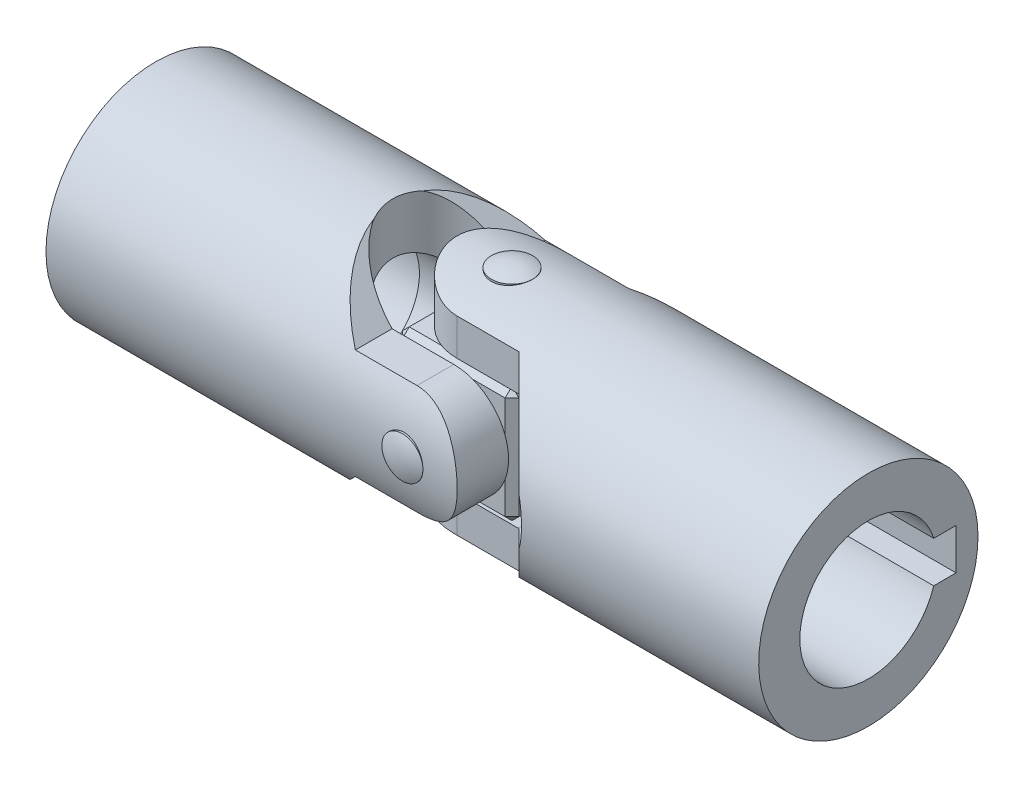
ISO-10303-21;
HEADER;
FILE_DESCRIPTION(('STEP AP214'),'2;1');
FILE_NAME('part.step','',(''),(''),'','','');
FILE_SCHEMA(('AUTOMOTIVE_DESIGN { 1 0 10303 214 1 1 1 1 }'));
ENDSEC;
DATA;
#1=APPLICATION_CONTEXT('core data for automotive mechanical design processes');
#2=APPLICATION_PROTOCOL_DEFINITION('international standard','automotive_design',2000,#1);
#3=PRODUCT_CONTEXT('',#1,'mechanical');
#4=PRODUCT('Part','Part','',(#3));
#5=PRODUCT_RELATED_PRODUCT_CATEGORY('part','',(#4));
#6=PRODUCT_DEFINITION_FORMATION('','',#4);
#7=PRODUCT_DEFINITION_CONTEXT('part definition',#1,'design');
#8=PRODUCT_DEFINITION('design','',#6,#7);
#9=PRODUCT_DEFINITION_SHAPE('','',#8);
#10=(LENGTH_UNIT() NAMED_UNIT(*) SI_UNIT(.MILLI.,.METRE.));
#11=(NAMED_UNIT(*) PLANE_ANGLE_UNIT() SI_UNIT($,.RADIAN.));
#12=(NAMED_UNIT(*) SI_UNIT($,.STERADIAN.) SOLID_ANGLE_UNIT());
#13=UNCERTAINTY_MEASURE_WITH_UNIT(LENGTH_MEASURE(1.E-05),#10,'distance_accuracy_value','');
#14=(GEOMETRIC_REPRESENTATION_CONTEXT(3) GLOBAL_UNCERTAINTY_ASSIGNED_CONTEXT((#13)) GLOBAL_UNIT_ASSIGNED_CONTEXT((#10,
#11,#12)) REPRESENTATION_CONTEXT('',''));
#15=CARTESIAN_POINT('',(0.,0.,0.));
#16=DIRECTION('',(0.,0.,1.));
#17=DIRECTION('',(1.,0.,0.));
#18=AXIS2_PLACEMENT_3D('',#15,#16,#17);
#19=CARTESIAN_POINT('',(0.,8.,0.));
#20=DIRECTION('',(0.,-1.,0.));
#21=DIRECTION('',(-1.,0.,0.));
#22=AXIS2_PLACEMENT_3D('',#19,#20,#21);
#23=CYLINDRICAL_SURFACE('',#22,1.5);
#24=CARTESIAN_POINT('',(0.,8.,0.));
#25=DIRECTION('',(0.,1.,0.));
#26=DIRECTION('',(1.,0.,0.));
#27=AXIS2_PLACEMENT_3D('',#24,#25,#26);
#28=CIRCLE('',#27,1.5);
#29=CARTESIAN_POINT('',(1.5,8.,0.));
#30=VERTEX_POINT('',#29);
#31=EDGE_CURVE('P0_E10',#30,#30,#28,.T.);
#32=ORIENTED_EDGE('',*,*,#31,.F.);
#33=EDGE_LOOP('',(#32));
#34=FACE_BOUND('',#33,.T.);
#35=CARTESIAN_POINT('',(0.,-8.,0.));
#36=DIRECTION('',(0.,1.,0.));
#37=DIRECTION('',(0.,0.,1.));
#38=AXIS2_PLACEMENT_3D('',#35,#36,#37);
#39=CIRCLE('',#38,1.5);
#40=CARTESIAN_POINT('',(0.,-8.,1.5));
#41=VERTEX_POINT('',#40);
#42=EDGE_CURVE('P0_E20',#41,#41,#39,.T.);
#43=ORIENTED_EDGE('',*,*,#42,.T.);
#44=EDGE_LOOP('',(#43));
#45=FACE_BOUND('',#44,.T.);
#46=ADVANCED_FACE('P0_F14',(#34,#45),#23,.T.);
#47=CARTESIAN_POINT('',(0.,4.56306822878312,0.));
#48=DIRECTION('',(0.,1.,0.));
#49=DIRECTION('',(0.,0.,-1.));
#50=AXIS2_PLACEMENT_3D('',#47,#48,#49);
#51=SPHERICAL_SURFACE('',#50,3.75);
#52=ORIENTED_EDGE('',*,*,#31,.T.);
#53=EDGE_LOOP('',(#52));
#54=FACE_BOUND('',#53,.T.);
#55=ADVANCED_FACE('P0_F29',(#54),#51,.T.);
#56=CARTESIAN_POINT('',(0.,-4.56306822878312,0.));
#57=DIRECTION('',(0.,-1.,0.));
#58=DIRECTION('',(0.,0.,-1.));
#59=AXIS2_PLACEMENT_3D('',#56,#57,#58);
#60=SPHERICAL_SURFACE('',#59,3.75);
#61=ORIENTED_EDGE('',*,*,#42,.F.);
#62=EDGE_LOOP('',(#61));
#63=FACE_BOUND('',#62,.T.);
#64=ADVANCED_FACE('P0_F27',(#63),#60,.T.);
#65=CLOSED_SHELL('',(#46,#55,#64));
#66=MANIFOLD_SOLID_BREP('P0_B1',#65);
#67=CARTESIAN_POINT('',(0.,0.,8.));
#68=DIRECTION('',(0.,0.,-1.));
#69=DIRECTION('',(-1.,0.,0.));
#70=AXIS2_PLACEMENT_3D('',#67,#68,#69);
#71=CYLINDRICAL_SURFACE('',#70,1.5);
#72=CARTESIAN_POINT('',(0.,0.,8.));
#73=DIRECTION('',(0.,0.,1.));
#74=DIRECTION('',(1.,0.,0.));
#75=AXIS2_PLACEMENT_3D('',#72,#73,#74);
#76=CIRCLE('',#75,1.5);
#77=CARTESIAN_POINT('',(1.5,0.,8.));
#78=VERTEX_POINT('',#77);
#79=EDGE_CURVE('P1_E10',#78,#78,#76,.T.);
#80=ORIENTED_EDGE('',*,*,#79,.F.);
#81=EDGE_LOOP('',(#80));
#82=FACE_BOUND('',#81,.T.);
#83=CARTESIAN_POINT('',(0.,0.,-8.));
#84=DIRECTION('',(0.,0.,1.));
#85=DIRECTION('',(0.,-1.,0.));
#86=AXIS2_PLACEMENT_3D('',#83,#84,#85);
#87=CIRCLE('',#86,1.5);
#88=CARTESIAN_POINT('',(0.,-1.5,-8.));
#89=VERTEX_POINT('',#88);
#90=EDGE_CURVE('P1_E20',#89,#89,#87,.T.);
#91=ORIENTED_EDGE('',*,*,#90,.T.);
#92=EDGE_LOOP('',(#91));
#93=FACE_BOUND('',#92,.T.);
#94=ADVANCED_FACE('P1_F14',(#82,#93),#71,.T.);
#95=CARTESIAN_POINT('',(0.,0.,4.56306822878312));
#96=DIRECTION('',(0.,0.,1.));
#97=DIRECTION('',(0.,1.,0.));
#98=AXIS2_PLACEMENT_3D('',#95,#96,#97);
#99=SPHERICAL_SURFACE('',#98,3.75);
#100=ORIENTED_EDGE('',*,*,#79,.T.);
#101=EDGE_LOOP('',(#100));
#102=FACE_BOUND('',#101,.T.);
#103=ADVANCED_FACE('P1_F29',(#102),#99,.T.);
#104=CARTESIAN_POINT('',(0.,0.,-4.56306822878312));
#105=DIRECTION('',(0.,0.,-1.));
#106=DIRECTION('',(0.,1.,0.));
#107=AXIS2_PLACEMENT_3D('',#104,#105,#106);
#108=SPHERICAL_SURFACE('',#107,3.75);
#109=ORIENTED_EDGE('',*,*,#90,.F.);
#110=EDGE_LOOP('',(#109));
#111=FACE_BOUND('',#110,.T.);
#112=ADVANCED_FACE('P1_F27',(#111),#108,.T.);
#113=CLOSED_SHELL('',(#94,#103,#112));
#114=MANIFOLD_SOLID_BREP('P1_B1',#113);
#115=CARTESIAN_POINT('',(0.,0.,4.25));
#116=DIRECTION('',(0.,0.,-1.));
#117=DIRECTION('',(-1.,0.,0.));
#118=AXIS2_PLACEMENT_3D('',#115,#116,#117);
#119=CYLINDRICAL_SURFACE('',#118,1.5);
#120=CARTESIAN_POINT('',(0.,0.,0.));
#121=DIRECTION('',(0.,0.707106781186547,-0.707106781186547));
#122=DIRECTION('',(0.,-0.707106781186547,-0.707106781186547));
#123=AXIS2_PLACEMENT_3D('',#120,#121,#122);
#124=ELLIPSE('',#123,2.12132034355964,1.5);
#125=CARTESIAN_POINT('',(1.5,0.,0.));
#126=VERTEX_POINT('',#125);
#127=CARTESIAN_POINT('',(-1.5,0.,0.));
#128=VERTEX_POINT('',#127);
#129=EDGE_CURVE('P2_E116',#126,#128,#124,.F.);
#130=ORIENTED_EDGE('',*,*,#129,.F.);
#131=CARTESIAN_POINT('',(0.,0.,0.));
#132=DIRECTION('',(0.,-0.707106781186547,-0.707106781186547));
#133=DIRECTION('',(0.,0.707106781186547,-0.707106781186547));
#134=AXIS2_PLACEMENT_3D('',#131,#132,#133);
#135=ELLIPSE('',#134,2.12132034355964,1.5);
#136=EDGE_CURVE('P2_E120',#128,#126,#135,.F.);
#137=ORIENTED_EDGE('',*,*,#136,.F.);
#138=EDGE_LOOP('',(#130,#137));
#139=FACE_BOUND('',#138,.T.);
#140=CARTESIAN_POINT('',(0.,0.,4.25));
#141=DIRECTION('',(0.,0.,1.));
#142=DIRECTION('',(1.,0.,0.));
#143=AXIS2_PLACEMENT_3D('',#140,#141,#142);
#144=CIRCLE('',#143,1.5);
#145=CARTESIAN_POINT('',(1.5,0.,4.25));
#146=VERTEX_POINT('',#145);
#147=EDGE_CURVE('P2_E127',#146,#146,#144,.T.);
#148=ORIENTED_EDGE('',*,*,#147,.T.);
#149=EDGE_LOOP('',(#148));
#150=FACE_BOUND('',#149,.T.);
#151=ADVANCED_FACE('P2_F16',(#139,#150),#119,.F.);
#152=CARTESIAN_POINT('',(4.25,4.25,4.25));
#153=DIRECTION('',(0.,0.,1.));
#154=DIRECTION('',(1.,0.,0.));
#155=AXIS2_PLACEMENT_3D('',#152,#153,#154);
#156=PLANE('',#155);
#157=DIRECTION('',(0.,-1.,0.));
#158=VECTOR('',#157,1.);
#159=CARTESIAN_POINT('',(-3.75,-4.25,4.25));
#160=LINE('',#159,#158);
#161=CARTESIAN_POINT('',(-3.75,3.75,4.25));
#162=VERTEX_POINT('',#161);
#163=CARTESIAN_POINT('',(-3.75,-3.75,4.25));
#164=VERTEX_POINT('',#163);
#165=EDGE_CURVE('P2_E164',#162,#164,#160,.T.);
#166=ORIENTED_EDGE('',*,*,#165,.T.);
#167=DIRECTION('',(1.,0.,0.));
#168=VECTOR('',#167,1.);
#169=CARTESIAN_POINT('',(4.25,-3.75,4.25));
#170=LINE('',#169,#168);
#171=CARTESIAN_POINT('',(3.75,-3.75,4.25));
#172=VERTEX_POINT('',#171);
#173=EDGE_CURVE('P2_E168',#164,#172,#170,.T.);
#174=ORIENTED_EDGE('',*,*,#173,.T.);
#175=DIRECTION('',(0.,1.,0.));
#176=VECTOR('',#175,1.);
#177=CARTESIAN_POINT('',(3.75,4.25,4.25));
#178=LINE('',#177,#176);
#179=CARTESIAN_POINT('',(3.75,3.75,4.25));
#180=VERTEX_POINT('',#179);
#181=EDGE_CURVE('P2_E166',#172,#180,#178,.T.);
#182=ORIENTED_EDGE('',*,*,#181,.T.);
#183=DIRECTION('',(-1.,0.,0.));
#184=VECTOR('',#183,1.);
#185=CARTESIAN_POINT('',(-4.25,3.75,4.25));
#186=LINE('',#185,#184);
#187=EDGE_CURVE('P2_E162',#180,#162,#186,.T.);
#188=ORIENTED_EDGE('',*,*,#187,.T.);
#189=EDGE_LOOP('',(#166,#174,#182,#188));
#190=FACE_BOUND('',#189,.T.);
#191=ORIENTED_EDGE('',*,*,#147,.F.);
#192=EDGE_LOOP('',(#191));
#193=FACE_BOUND('',#192,.T.);
#194=ADVANCED_FACE('P2_F282',(#190,#193),#156,.T.);
#195=CARTESIAN_POINT('',(4.25,4.25,-4.25));
#196=DIRECTION('',(0.,0.,1.));
#197=DIRECTION('',(1.,0.,0.));
#198=AXIS2_PLACEMENT_3D('',#195,#196,#197);
#199=PLANE('',#198);
#200=DIRECTION('',(-1.,0.,0.));
#201=VECTOR('',#200,1.);
#202=CARTESIAN_POINT('',(4.25,-3.75,-4.25));
#203=LINE('',#202,#201);
#204=CARTESIAN_POINT('',(3.75,-3.75,-4.25));
#205=VERTEX_POINT('',#204);
#206=CARTESIAN_POINT('',(-3.75,-3.75,-4.25));
#207=VERTEX_POINT('',#206);
#208=EDGE_CURVE('P2_E157',#205,#207,#203,.T.);
#209=ORIENTED_EDGE('',*,*,#208,.T.);
#210=DIRECTION('',(0.,1.,0.));
#211=VECTOR('',#210,1.);
#212=CARTESIAN_POINT('',(-3.75,4.25,-4.25));
#213=LINE('',#212,#211);
#214=CARTESIAN_POINT('',(-3.75,3.75,-4.25));
#215=VERTEX_POINT('',#214);
#216=EDGE_CURVE('P2_E159',#207,#215,#213,.T.);
#217=ORIENTED_EDGE('',*,*,#216,.T.);
#218=DIRECTION('',(1.,0.,0.));
#219=VECTOR('',#218,1.);
#220=CARTESIAN_POINT('',(4.25,3.75,-4.25));
#221=LINE('',#220,#219);
#222=CARTESIAN_POINT('',(3.75,3.75,-4.25));
#223=VERTEX_POINT('',#222);
#224=EDGE_CURVE('P2_E153',#215,#223,#221,.T.);
#225=ORIENTED_EDGE('',*,*,#224,.T.);
#226=DIRECTION('',(0.,-1.,0.));
#227=VECTOR('',#226,1.);
#228=CARTESIAN_POINT('',(3.75,4.25,-4.25));
#229=LINE('',#228,#227);
#230=EDGE_CURVE('P2_E155',#223,#205,#229,.T.);
#231=ORIENTED_EDGE('',*,*,#230,.T.);
#232=EDGE_LOOP('',(#209,#217,#225,#231));
#233=FACE_BOUND('',#232,.T.);
#234=CARTESIAN_POINT('',(0.,0.,-4.25));
#235=DIRECTION('',(0.,0.,1.));
#236=DIRECTION('',(1.,0.,0.));
#237=AXIS2_PLACEMENT_3D('',#234,#235,#236);
#238=CIRCLE('',#237,1.5);
#239=CARTESIAN_POINT('',(1.5,0.,-4.25));
#240=VERTEX_POINT('',#239);
#241=EDGE_CURVE('P2_E259',#240,#240,#238,.T.);
#242=ORIENTED_EDGE('',*,*,#241,.T.);
#243=EDGE_LOOP('',(#242));
#244=FACE_BOUND('',#243,.T.);
#245=ADVANCED_FACE('P2_F267',(#233,#244),#199,.F.);
#246=CARTESIAN_POINT('',(-4.25,4.25,4.25));
#247=DIRECTION('',(0.,-1.,0.));
#248=DIRECTION('',(0.,0.,-1.));
#249=AXIS2_PLACEMENT_3D('',#246,#247,#248);
#250=PLANE('',#249);
#251=DIRECTION('',(-1.,0.,0.));
#252=VECTOR('',#251,1.);
#253=CARTESIAN_POINT('',(-4.25,4.25,-3.75));
#254=LINE('',#253,#252);
#255=CARTESIAN_POINT('',(3.75,4.25,-3.75));
#256=VERTEX_POINT('',#255);
#257=CARTESIAN_POINT('',(-3.75,4.25,-3.75));
#258=VERTEX_POINT('',#257);
#259=EDGE_CURVE('P2_E25',#256,#258,#254,.T.);
#260=ORIENTED_EDGE('',*,*,#259,.T.);
#261=DIRECTION('',(0.,0.,1.));
#262=VECTOR('',#261,1.);
#263=CARTESIAN_POINT('',(-3.75,4.25,4.25));
#264=LINE('',#263,#262);
#265=CARTESIAN_POINT('',(-3.75,4.25,3.75));
#266=VERTEX_POINT('',#265);
#267=EDGE_CURVE('P2_E11',#258,#266,#264,.T.);
#268=ORIENTED_EDGE('',*,*,#267,.T.);
#269=DIRECTION('',(1.,0.,0.));
#270=VECTOR('',#269,1.);
#271=CARTESIAN_POINT('',(4.25,4.25,3.75));
#272=LINE('',#271,#270);
#273=CARTESIAN_POINT('',(3.75,4.25,3.75));
#274=VERTEX_POINT('',#273);
#275=EDGE_CURVE('P2_E180',#266,#274,#272,.T.);
#276=ORIENTED_EDGE('',*,*,#275,.T.);
#277=DIRECTION('',(0.,0.,-1.));
#278=VECTOR('',#277,1.);
#279=CARTESIAN_POINT('',(3.75,4.25,4.25));
#280=LINE('',#279,#278);
#281=EDGE_CURVE('P2_E36',#274,#256,#280,.T.);
#282=ORIENTED_EDGE('',*,*,#281,.T.);
#283=EDGE_LOOP('',(#260,#268,#276,#282));
#284=FACE_BOUND('',#283,.T.);
#285=CARTESIAN_POINT('',(0.,4.25,0.));
#286=DIRECTION('',(0.,1.,0.));
#287=DIRECTION('',(0.,0.,1.));
#288=AXIS2_PLACEMENT_3D('',#285,#286,#287);
#289=CIRCLE('',#288,1.5);
#290=CARTESIAN_POINT('',(0.,4.25,1.5));
#291=VERTEX_POINT('',#290);
#292=EDGE_CURVE('P2_E249',#291,#291,#289,.T.);
#293=ORIENTED_EDGE('',*,*,#292,.F.);
#294=EDGE_LOOP('',(#293));
#295=FACE_BOUND('',#294,.T.);
#296=ADVANCED_FACE('P2_F290',(#284,#295),#250,.F.);
#297=CARTESIAN_POINT('',(-4.25,-4.25,4.25));
#298=DIRECTION('',(1.,0.,0.));
#299=DIRECTION('',(0.,0.,-1.));
#300=AXIS2_PLACEMENT_3D('',#297,#298,#299);
#301=PLANE('',#300);
#302=DIRECTION('',(0.,-1.,0.));
#303=VECTOR('',#302,1.);
#304=CARTESIAN_POINT('',(-4.25,-4.25,-3.75));
#305=LINE('',#304,#303);
#306=CARTESIAN_POINT('',(-4.25,3.75,-3.75));
#307=VERTEX_POINT('',#306);
#308=CARTESIAN_POINT('',(-4.25,-3.75,-3.75));
#309=VERTEX_POINT('',#308);
#310=EDGE_CURVE('P2_E148',#307,#309,#305,.T.);
#311=ORIENTED_EDGE('',*,*,#310,.T.);
#312=DIRECTION('',(0.,0.,1.));
#313=VECTOR('',#312,1.);
#314=CARTESIAN_POINT('',(-4.25,-3.75,4.25));
#315=LINE('',#314,#313);
#316=CARTESIAN_POINT('',(-4.25,-3.75,3.75));
#317=VERTEX_POINT('',#316);
#318=EDGE_CURVE('P2_E150',#309,#317,#315,.T.);
#319=ORIENTED_EDGE('',*,*,#318,.T.);
#320=DIRECTION('',(0.,1.,0.));
#321=VECTOR('',#320,1.);
#322=CARTESIAN_POINT('',(-4.25,4.25,3.75));
#323=LINE('',#322,#321);
#324=CARTESIAN_POINT('',(-4.25,3.75,3.75));
#325=VERTEX_POINT('',#324);
#326=EDGE_CURVE('P2_E146',#317,#325,#323,.T.);
#327=ORIENTED_EDGE('',*,*,#326,.T.);
#328=DIRECTION('',(0.,0.,-1.));
#329=VECTOR('',#328,1.);
#330=CARTESIAN_POINT('',(-4.25,3.75,4.25));
#331=LINE('',#330,#329);
#332=EDGE_CURVE('P2_E144',#325,#307,#331,.T.);
#333=ORIENTED_EDGE('',*,*,#332,.T.);
#334=EDGE_LOOP('',(#311,#319,#327,#333));
#335=FACE_BOUND('',#334,.T.);
#336=ADVANCED_FACE('P2_F297',(#335),#301,.F.);
#337=CARTESIAN_POINT('',(-4.25,-4.25,4.25));
#338=DIRECTION('',(0.,1.,0.));
#339=DIRECTION('',(0.,0.,1.));
#340=AXIS2_PLACEMENT_3D('',#337,#338,#339);
#341=PLANE('',#340);
#342=DIRECTION('',(-1.,0.,0.));
#343=VECTOR('',#342,1.);
#344=CARTESIAN_POINT('',(-4.25,-4.25,3.75));
#345=LINE('',#344,#343);
#346=CARTESIAN_POINT('',(3.75,-4.25,3.75));
#347=VERTEX_POINT('',#346);
#348=CARTESIAN_POINT('',(-3.75,-4.25,3.75));
#349=VERTEX_POINT('',#348);
#350=EDGE_CURVE('P2_E137',#347,#349,#345,.T.);
#351=ORIENTED_EDGE('',*,*,#350,.T.);
#352=DIRECTION('',(0.,0.,-1.));
#353=VECTOR('',#352,1.);
#354=CARTESIAN_POINT('',(-3.75,-4.25,4.25));
#355=LINE('',#354,#353);
#356=CARTESIAN_POINT('',(-3.75,-4.25,-3.75));
#357=VERTEX_POINT('',#356);
#358=EDGE_CURVE('P2_E141',#349,#357,#355,.T.);
#359=ORIENTED_EDGE('',*,*,#358,.T.);
#360=DIRECTION('',(1.,0.,0.));
#361=VECTOR('',#360,1.);
#362=CARTESIAN_POINT('',(-4.25,-4.25,-3.75));
#363=LINE('',#362,#361);
#364=CARTESIAN_POINT('',(3.75,-4.25,-3.75));
#365=VERTEX_POINT('',#364);
#366=EDGE_CURVE('P2_E139',#357,#365,#363,.T.);
#367=ORIENTED_EDGE('',*,*,#366,.T.);
#368=DIRECTION('',(0.,0.,1.));
#369=VECTOR('',#368,1.);
#370=CARTESIAN_POINT('',(3.75,-4.25,4.25));
#371=LINE('',#370,#369);
#372=EDGE_CURVE('P2_E130',#365,#347,#371,.T.);
#373=ORIENTED_EDGE('',*,*,#372,.T.);
#374=EDGE_LOOP('',(#351,#359,#367,#373));
#375=FACE_BOUND('',#374,.T.);
#376=CARTESIAN_POINT('',(0.,-4.25,0.));
#377=DIRECTION('',(0.,1.,0.));
#378=DIRECTION('',(0.,0.,1.));
#379=AXIS2_PLACEMENT_3D('',#376,#377,#378);
#380=CIRCLE('',#379,1.5);
#381=CARTESIAN_POINT('',(0.,-4.25,1.5));
#382=VERTEX_POINT('',#381);
#383=EDGE_CURVE('P2_E255',#382,#382,#380,.T.);
#384=ORIENTED_EDGE('',*,*,#383,.T.);
#385=EDGE_LOOP('',(#384));
#386=FACE_BOUND('',#385,.T.);
#387=ADVANCED_FACE('P2_F277',(#375,#386),#341,.F.);
#388=CARTESIAN_POINT('',(4.25,-4.25,4.25));
#389=DIRECTION('',(-1.,0.,0.));
#390=DIRECTION('',(0.,0.,1.));
#391=AXIS2_PLACEMENT_3D('',#388,#389,#390);
#392=PLANE('',#391);
#393=DIRECTION('',(0.,-1.,0.));
#394=VECTOR('',#393,1.);
#395=CARTESIAN_POINT('',(4.25,-4.25,3.75));
#396=LINE('',#395,#394);
#397=CARTESIAN_POINT('',(4.25,3.75,3.75));
#398=VERTEX_POINT('',#397);
#399=CARTESIAN_POINT('',(4.25,-3.75,3.75));
#400=VERTEX_POINT('',#399);
#401=EDGE_CURVE('P2_E173',#398,#400,#396,.T.);
#402=ORIENTED_EDGE('',*,*,#401,.T.);
#403=DIRECTION('',(0.,0.,-1.));
#404=VECTOR('',#403,1.);
#405=CARTESIAN_POINT('',(4.25,-3.75,4.25));
#406=LINE('',#405,#404);
#407=CARTESIAN_POINT('',(4.25,-3.75,-3.75));
#408=VERTEX_POINT('',#407);
#409=EDGE_CURVE('P2_E177',#400,#408,#406,.T.);
#410=ORIENTED_EDGE('',*,*,#409,.T.);
#411=DIRECTION('',(0.,1.,0.));
#412=VECTOR('',#411,1.);
#413=CARTESIAN_POINT('',(4.25,-4.25,-3.75));
#414=LINE('',#413,#412);
#415=CARTESIAN_POINT('',(4.25,3.75,-3.75));
#416=VERTEX_POINT('',#415);
#417=EDGE_CURVE('P2_E175',#408,#416,#414,.T.);
#418=ORIENTED_EDGE('',*,*,#417,.T.);
#419=DIRECTION('',(0.,0.,1.));
#420=VECTOR('',#419,1.);
#421=CARTESIAN_POINT('',(4.25,3.75,4.25));
#422=LINE('',#421,#420);
#423=EDGE_CURVE('P2_E171',#416,#398,#422,.T.);
#424=ORIENTED_EDGE('',*,*,#423,.T.);
#425=EDGE_LOOP('',(#402,#410,#418,#424));
#426=FACE_BOUND('',#425,.T.);
#427=ADVANCED_FACE('P2_F269',(#426),#392,.F.);
#428=CARTESIAN_POINT('',(0.,0.,0.));
#429=DIRECTION('',(0.,0.707106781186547,-0.707106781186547));
#430=DIRECTION('',(0.,-0.707106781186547,-0.707106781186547));
#431=AXIS2_PLACEMENT_3D('',#428,#429,#430);
#432=ELLIPSE('',#431,2.12132034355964,1.5);
#433=EDGE_CURVE('P2_E119',#126,#128,#432,.T.);
#434=ORIENTED_EDGE('',*,*,#433,.F.);
#435=CARTESIAN_POINT('',(0.,0.,0.));
#436=DIRECTION('',(0.,-0.707106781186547,-0.707106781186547));
#437=DIRECTION('',(0.,0.707106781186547,-0.707106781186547));
#438=AXIS2_PLACEMENT_3D('',#435,#436,#437);
#439=ELLIPSE('',#438,2.12132034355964,1.5);
#440=EDGE_CURVE('P2_E111',#128,#126,#439,.T.);
#441=ORIENTED_EDGE('',*,*,#440,.F.);
#442=EDGE_LOOP('',(#434,#441));
#443=FACE_BOUND('',#442,.T.);
#444=ORIENTED_EDGE('',*,*,#241,.F.);
#445=EDGE_LOOP('',(#444));
#446=FACE_BOUND('',#445,.T.);
#447=ADVANCED_FACE('P2_F132',(#443,#446),#119,.F.);
#448=CARTESIAN_POINT('',(0.,-4.25,0.));
#449=DIRECTION('',(0.,1.,0.));
#450=DIRECTION('',(0.,0.,1.));
#451=AXIS2_PLACEMENT_3D('',#448,#449,#450);
#452=CYLINDRICAL_SURFACE('',#451,1.5);
#453=ORIENTED_EDGE('',*,*,#433,.T.);
#454=ORIENTED_EDGE('',*,*,#136,.T.);
#455=EDGE_LOOP('',(#453,#454));
#456=FACE_BOUND('',#455,.T.);
#457=ORIENTED_EDGE('',*,*,#383,.F.);
#458=EDGE_LOOP('',(#457));
#459=FACE_BOUND('',#458,.T.);
#460=ADVANCED_FACE('P2_F124',(#456,#459),#452,.F.);
#461=ORIENTED_EDGE('',*,*,#129,.T.);
#462=ORIENTED_EDGE('',*,*,#440,.T.);
#463=EDGE_LOOP('',(#461,#462));
#464=FACE_BOUND('',#463,.T.);
#465=ORIENTED_EDGE('',*,*,#292,.T.);
#466=EDGE_LOOP('',(#465));
#467=FACE_BOUND('',#466,.T.);
#468=ADVANCED_FACE('P2_F113',(#464,#467),#452,.F.);
#469=CARTESIAN_POINT('',(3.75,4.25,4.25));
#470=DIRECTION('',(-0.707106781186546,-0.707106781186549,0.));
#471=DIRECTION('',(0.707106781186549,-0.707106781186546,0.));
#472=AXIS2_PLACEMENT_3D('',#469,#470,#471);
#473=PLANE('',#472);
#474=DIRECTION('',(0.707106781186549,-0.707106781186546,0.));
#475=VECTOR('',#474,1.);
#476=CARTESIAN_POINT('',(4.,4.,3.75));
#477=LINE('',#476,#475);
#478=EDGE_CURVE('P2_E20',#398,#274,#477,.F.);
#479=ORIENTED_EDGE('',*,*,#478,.F.);
#480=ORIENTED_EDGE('',*,*,#423,.F.);
#481=DIRECTION('',(-0.707106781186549,0.707106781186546,0.));
#482=VECTOR('',#481,1.);
#483=CARTESIAN_POINT('',(4.25,3.75,-3.75));
#484=LINE('',#483,#482);
#485=EDGE_CURVE('P2_E243',#256,#416,#484,.F.);
#486=ORIENTED_EDGE('',*,*,#485,.F.);
#487=ORIENTED_EDGE('',*,*,#281,.F.);
#488=EDGE_LOOP('',(#479,#480,#486,#487));
#489=FACE_BOUND('',#488,.T.);
#490=ADVANCED_FACE('P2_F18',(#489),#473,.F.);
#491=CARTESIAN_POINT('',(3.75,3.75,4.25));
#492=DIRECTION('',(0.577350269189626,0.577350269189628,0.577350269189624));
#493=DIRECTION('',(-0.707106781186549,0.707106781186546,0.));
#494=AXIS2_PLACEMENT_3D('',#491,#492,#493);
#495=PLANE('',#494);
#496=DIRECTION('',(0.707106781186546,0.,-0.707106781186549));
#497=VECTOR('',#496,1.);
#498=CARTESIAN_POINT('',(3.75,3.75,4.25));
#499=LINE('',#498,#497);
#500=EDGE_CURVE('P2_E238',#398,#180,#499,.F.);
#501=ORIENTED_EDGE('',*,*,#500,.F.);
#502=ORIENTED_EDGE('',*,*,#478,.T.);
#503=DIRECTION('',(0.,-0.707106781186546,0.707106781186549));
#504=VECTOR('',#503,1.);
#505=CARTESIAN_POINT('',(3.75,3.75,4.25));
#506=LINE('',#505,#504);
#507=EDGE_CURVE('P2_E241',#180,#274,#506,.F.);
#508=ORIENTED_EDGE('',*,*,#507,.F.);
#509=EDGE_LOOP('',(#501,#502,#508));
#510=FACE_BOUND('',#509,.T.);
#511=ADVANCED_FACE('P2_F374',(#510),#495,.T.);
#512=CARTESIAN_POINT('',(4.25,3.75,-3.75));
#513=DIRECTION('',(0.577350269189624,0.577350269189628,-0.577350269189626));
#514=DIRECTION('',(0.,0.707106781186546,0.707106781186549));
#515=AXIS2_PLACEMENT_3D('',#512,#513,#514);
#516=PLANE('',#515);
#517=DIRECTION('',(0.,-0.707106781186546,-0.707106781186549));
#518=VECTOR('',#517,1.);
#519=CARTESIAN_POINT('',(3.75,4.,-4.));
#520=LINE('',#519,#518);
#521=EDGE_CURVE('P2_E232',#256,#223,#520,.T.);
#522=ORIENTED_EDGE('',*,*,#521,.F.);
#523=ORIENTED_EDGE('',*,*,#485,.T.);
#524=DIRECTION('',(0.707106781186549,0.,0.707106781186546));
#525=VECTOR('',#524,1.);
#526=CARTESIAN_POINT('',(4.25,3.75,-3.75));
#527=LINE('',#526,#525);
#528=EDGE_CURVE('P2_E235',#223,#416,#527,.T.);
#529=ORIENTED_EDGE('',*,*,#528,.F.);
#530=EDGE_LOOP('',(#522,#523,#529));
#531=FACE_BOUND('',#530,.T.);
#532=ADVANCED_FACE('P2_F371',(#531),#516,.T.);
#533=CARTESIAN_POINT('',(4.25,3.75,4.25));
#534=DIRECTION('',(0.,0.707106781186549,0.707106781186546));
#535=DIRECTION('',(0.,-0.707106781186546,0.707106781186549));
#536=AXIS2_PLACEMENT_3D('',#533,#534,#535);
#537=PLANE('',#536);
#538=ORIENTED_EDGE('',*,*,#507,.T.);
#539=ORIENTED_EDGE('',*,*,#275,.F.);
#540=DIRECTION('',(0.,0.707106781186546,-0.707106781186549));
#541=VECTOR('',#540,1.);
#542=CARTESIAN_POINT('',(-3.75,4.,4.));
#543=LINE('',#542,#541);
#544=EDGE_CURVE('P2_E227',#162,#266,#543,.T.);
#545=ORIENTED_EDGE('',*,*,#544,.F.);
#546=ORIENTED_EDGE('',*,*,#187,.F.);
#547=EDGE_LOOP('',(#538,#539,#545,#546));
#548=FACE_BOUND('',#547,.T.);
#549=ADVANCED_FACE('P2_F367',(#548),#537,.T.);
#550=CARTESIAN_POINT('',(3.75,4.25,4.25));
#551=DIRECTION('',(0.707106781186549,0.,0.707106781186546));
#552=DIRECTION('',(0.707106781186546,0.,-0.707106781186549));
#553=AXIS2_PLACEMENT_3D('',#550,#551,#552);
#554=PLANE('',#553);
#555=ORIENTED_EDGE('',*,*,#500,.T.);
#556=ORIENTED_EDGE('',*,*,#181,.F.);
#557=DIRECTION('',(-0.707106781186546,0.,0.707106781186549));
#558=VECTOR('',#557,1.);
#559=CARTESIAN_POINT('',(3.75,-3.75,4.25));
#560=LINE('',#559,#558);
#561=EDGE_CURVE('P2_E224',#400,#172,#560,.T.);
#562=ORIENTED_EDGE('',*,*,#561,.F.);
#563=ORIENTED_EDGE('',*,*,#401,.F.);
#564=EDGE_LOOP('',(#555,#556,#562,#563));
#565=FACE_BOUND('',#564,.T.);
#566=ADVANCED_FACE('P2_F363',(#565),#554,.T.);
#567=CARTESIAN_POINT('',(4.25,-3.75,4.25));
#568=DIRECTION('',(-0.707106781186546,0.707106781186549,0.));
#569=DIRECTION('',(-0.707106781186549,-0.707106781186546,0.));
#570=AXIS2_PLACEMENT_3D('',#567,#568,#569);
#571=PLANE('',#570);
#572=DIRECTION('',(0.707106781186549,0.707106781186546,0.));
#573=VECTOR('',#572,1.);
#574=CARTESIAN_POINT('',(3.75,-4.25,-3.75));
#575=LINE('',#574,#573);
#576=EDGE_CURVE('P2_E218',#408,#365,#575,.F.);
#577=ORIENTED_EDGE('',*,*,#576,.F.);
#578=ORIENTED_EDGE('',*,*,#409,.F.);
#579=DIRECTION('',(-0.707106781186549,-0.707106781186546,0.));
#580=VECTOR('',#579,1.);
#581=CARTESIAN_POINT('',(4.,-4.,3.75));
#582=LINE('',#581,#580);
#583=EDGE_CURVE('P2_E221',#347,#400,#582,.F.);
#584=ORIENTED_EDGE('',*,*,#583,.F.);
#585=ORIENTED_EDGE('',*,*,#372,.F.);
#586=EDGE_LOOP('',(#577,#578,#584,#585));
#587=FACE_BOUND('',#586,.T.);
#588=ADVANCED_FACE('P2_F359',(#587),#571,.F.);
#589=CARTESIAN_POINT('',(4.25,-4.25,-3.75));
#590=DIRECTION('',(-0.707106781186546,0.,0.707106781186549));
#591=DIRECTION('',(0.707106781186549,0.,0.707106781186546));
#592=AXIS2_PLACEMENT_3D('',#589,#590,#591);
#593=PLANE('',#592);
#594=ORIENTED_EDGE('',*,*,#528,.T.);
#595=ORIENTED_EDGE('',*,*,#417,.F.);
#596=DIRECTION('',(-0.707106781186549,0.,-0.707106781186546));
#597=VECTOR('',#596,1.);
#598=CARTESIAN_POINT('',(4.,-3.75,-4.));
#599=LINE('',#598,#597);
#600=EDGE_CURVE('P2_E216',#205,#408,#599,.F.);
#601=ORIENTED_EDGE('',*,*,#600,.F.);
#602=ORIENTED_EDGE('',*,*,#230,.F.);
#603=EDGE_LOOP('',(#594,#595,#601,#602));
#604=FACE_BOUND('',#603,.T.);
#605=ADVANCED_FACE('P2_F355',(#604),#593,.F.);
#606=CARTESIAN_POINT('',(-4.25,4.25,-3.75));
#607=DIRECTION('',(0.,-0.707106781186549,0.707106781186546));
#608=DIRECTION('',(0.,-0.707106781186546,-0.707106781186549));
#609=AXIS2_PLACEMENT_3D('',#606,#607,#608);
#610=PLANE('',#609);
#611=ORIENTED_EDGE('',*,*,#521,.T.);
#612=ORIENTED_EDGE('',*,*,#224,.F.);
#613=DIRECTION('',(0.,0.707106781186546,0.707106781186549));
#614=VECTOR('',#613,1.);
#615=CARTESIAN_POINT('',(-3.75,3.75,-4.25));
#616=LINE('',#615,#614);
#617=EDGE_CURVE('P2_E213',#258,#215,#616,.F.);
#618=ORIENTED_EDGE('',*,*,#617,.F.);
#619=ORIENTED_EDGE('',*,*,#259,.F.);
#620=EDGE_LOOP('',(#611,#612,#618,#619));
#621=FACE_BOUND('',#620,.T.);
#622=ADVANCED_FACE('P2_F351',(#621),#610,.F.);
#623=CARTESIAN_POINT('',(-4.25,3.75,4.25));
#624=DIRECTION('',(0.707106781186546,-0.707106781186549,0.));
#625=DIRECTION('',(0.707106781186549,0.707106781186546,0.));
#626=AXIS2_PLACEMENT_3D('',#623,#624,#625);
#627=PLANE('',#626);
#628=DIRECTION('',(0.707106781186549,0.707106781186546,0.));
#629=VECTOR('',#628,1.);
#630=CARTESIAN_POINT('',(-4.25,3.75,3.75));
#631=LINE('',#630,#629);
#632=EDGE_CURVE('P2_E229',#266,#325,#631,.F.);
#633=ORIENTED_EDGE('',*,*,#632,.F.);
#634=ORIENTED_EDGE('',*,*,#267,.F.);
#635=DIRECTION('',(-0.707106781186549,-0.707106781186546,0.));
#636=VECTOR('',#635,1.);
#637=CARTESIAN_POINT('',(-4.,4.,-3.75));
#638=LINE('',#637,#636);
#639=EDGE_CURVE('P2_E210',#307,#258,#638,.F.);
#640=ORIENTED_EDGE('',*,*,#639,.F.);
#641=ORIENTED_EDGE('',*,*,#332,.F.);
#642=EDGE_LOOP('',(#633,#634,#640,#641));
#643=FACE_BOUND('',#642,.T.);
#644=ADVANCED_FACE('P2_F347',(#643),#627,.F.);
#645=CARTESIAN_POINT('',(-4.25,3.75,3.75));
#646=DIRECTION('',(-0.577350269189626,0.577350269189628,0.577350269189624));
#647=DIRECTION('',(-0.707106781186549,-0.707106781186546,0.));
#648=AXIS2_PLACEMENT_3D('',#645,#646,#647);
#649=PLANE('',#648);
#650=ORIENTED_EDGE('',*,*,#544,.T.);
#651=ORIENTED_EDGE('',*,*,#632,.T.);
#652=DIRECTION('',(0.707106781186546,0.,0.707106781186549));
#653=VECTOR('',#652,1.);
#654=CARTESIAN_POINT('',(-4.25,3.75,3.75));
#655=LINE('',#654,#653);
#656=EDGE_CURVE('P2_E207',#162,#325,#655,.F.);
#657=ORIENTED_EDGE('',*,*,#656,.F.);
#658=EDGE_LOOP('',(#650,#651,#657));
#659=FACE_BOUND('',#658,.T.);
#660=ADVANCED_FACE('P2_F343',(#659),#649,.T.);
#661=CARTESIAN_POINT('',(3.75,-3.75,4.25));
#662=DIRECTION('',(0.577350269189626,-0.577350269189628,0.577350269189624));
#663=DIRECTION('',(0.707106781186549,0.707106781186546,0.));
#664=AXIS2_PLACEMENT_3D('',#661,#662,#663);
#665=PLANE('',#664);
#666=ORIENTED_EDGE('',*,*,#583,.T.);
#667=ORIENTED_EDGE('',*,*,#561,.T.);
#668=DIRECTION('',(0.,-0.707106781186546,-0.707106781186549));
#669=VECTOR('',#668,1.);
#670=CARTESIAN_POINT('',(3.75,-3.75,4.25));
#671=LINE('',#670,#669);
#672=EDGE_CURVE('P2_E205',#347,#172,#671,.F.);
#673=ORIENTED_EDGE('',*,*,#672,.F.);
#674=EDGE_LOOP('',(#666,#667,#673));
#675=FACE_BOUND('',#674,.T.);
#676=ADVANCED_FACE('P2_F339',(#675),#665,.T.);
#677=CARTESIAN_POINT('',(3.75,-4.25,-3.75));
#678=DIRECTION('',(0.577350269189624,-0.577350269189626,-0.577350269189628));
#679=DIRECTION('',(0.,0.707106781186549,-0.707106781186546));
#680=AXIS2_PLACEMENT_3D('',#677,#678,#679);
#681=PLANE('',#680);
#682=ORIENTED_EDGE('',*,*,#600,.T.);
#683=ORIENTED_EDGE('',*,*,#576,.T.);
#684=DIRECTION('',(0.,-0.707106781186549,0.707106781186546));
#685=VECTOR('',#684,1.);
#686=CARTESIAN_POINT('',(3.75,-4.25,-3.75));
#687=LINE('',#686,#685);
#688=EDGE_CURVE('P2_E202',#205,#365,#687,.T.);
#689=ORIENTED_EDGE('',*,*,#688,.F.);
#690=EDGE_LOOP('',(#682,#683,#689));
#691=FACE_BOUND('',#690,.T.);
#692=ADVANCED_FACE('P2_F335',(#691),#681,.T.);
#693=CARTESIAN_POINT('',(-3.75,3.75,-4.25));
#694=DIRECTION('',(-0.577350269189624,0.577350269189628,-0.577350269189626));
#695=DIRECTION('',(0.,0.707106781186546,0.707106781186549));
#696=AXIS2_PLACEMENT_3D('',#693,#694,#695);
#697=PLANE('',#696);
#698=ORIENTED_EDGE('',*,*,#639,.T.);
#699=ORIENTED_EDGE('',*,*,#617,.T.);
#700=DIRECTION('',(0.707106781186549,0.,-0.707106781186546));
#701=VECTOR('',#700,1.);
#702=CARTESIAN_POINT('',(-3.75,3.75,-4.25));
#703=LINE('',#702,#701);
#704=EDGE_CURVE('P2_E200',#307,#215,#703,.T.);
#705=ORIENTED_EDGE('',*,*,#704,.F.);
#706=EDGE_LOOP('',(#698,#699,#705));
#707=FACE_BOUND('',#706,.T.);
#708=ADVANCED_FACE('P2_F331',(#707),#697,.T.);
#709=CARTESIAN_POINT('',(-3.75,4.25,4.25));
#710=DIRECTION('',(-0.707106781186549,0.,0.707106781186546));
#711=DIRECTION('',(0.707106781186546,0.,0.707106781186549));
#712=AXIS2_PLACEMENT_3D('',#709,#710,#711);
#713=PLANE('',#712);
#714=ORIENTED_EDGE('',*,*,#656,.T.);
#715=ORIENTED_EDGE('',*,*,#326,.F.);
#716=DIRECTION('',(-0.707106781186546,0.,-0.707106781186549));
#717=VECTOR('',#716,1.);
#718=CARTESIAN_POINT('',(-4.25,-3.75,3.75));
#719=LINE('',#718,#717);
#720=EDGE_CURVE('P2_E197',#164,#317,#719,.T.);
#721=ORIENTED_EDGE('',*,*,#720,.F.);
#722=ORIENTED_EDGE('',*,*,#165,.F.);
#723=EDGE_LOOP('',(#714,#715,#721,#722));
#724=FACE_BOUND('',#723,.T.);
#725=ADVANCED_FACE('P2_F327',(#724),#713,.T.);
#726=CARTESIAN_POINT('',(4.25,-3.75,4.25));
#727=DIRECTION('',(0.,-0.707106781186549,0.707106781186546));
#728=DIRECTION('',(0.,-0.707106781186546,-0.707106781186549));
#729=AXIS2_PLACEMENT_3D('',#726,#727,#728);
#730=PLANE('',#729);
#731=ORIENTED_EDGE('',*,*,#672,.T.);
#732=ORIENTED_EDGE('',*,*,#173,.F.);
#733=DIRECTION('',(0.,0.707106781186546,0.707106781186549));
#734=VECTOR('',#733,1.);
#735=CARTESIAN_POINT('',(-3.75,-4.,4.));
#736=LINE('',#735,#734);
#737=EDGE_CURVE('P2_E194',#349,#164,#736,.T.);
#738=ORIENTED_EDGE('',*,*,#737,.F.);
#739=ORIENTED_EDGE('',*,*,#350,.F.);
#740=EDGE_LOOP('',(#731,#732,#738,#739));
#741=FACE_BOUND('',#740,.T.);
#742=ADVANCED_FACE('P2_F323',(#741),#730,.T.);
#743=CARTESIAN_POINT('',(-4.25,-4.25,-3.75));
#744=DIRECTION('',(0.,0.707106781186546,0.707106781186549));
#745=DIRECTION('',(0.,-0.707106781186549,0.707106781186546));
#746=AXIS2_PLACEMENT_3D('',#743,#744,#745);
#747=PLANE('',#746);
#748=ORIENTED_EDGE('',*,*,#688,.T.);
#749=ORIENTED_EDGE('',*,*,#366,.F.);
#750=DIRECTION('',(0.,0.707106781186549,-0.707106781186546));
#751=VECTOR('',#750,1.);
#752=CARTESIAN_POINT('',(-3.75,-4.25,-3.75));
#753=LINE('',#752,#751);
#754=EDGE_CURVE('P2_E191',#207,#357,#753,.F.);
#755=ORIENTED_EDGE('',*,*,#754,.F.);
#756=ORIENTED_EDGE('',*,*,#208,.F.);
#757=EDGE_LOOP('',(#748,#749,#755,#756));
#758=FACE_BOUND('',#757,.T.);
#759=ADVANCED_FACE('P2_F319',(#758),#747,.F.);
#760=CARTESIAN_POINT('',(-4.25,-4.25,-3.75));
#761=DIRECTION('',(0.707106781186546,0.,0.707106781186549));
#762=DIRECTION('',(0.707106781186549,0.,-0.707106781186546));
#763=AXIS2_PLACEMENT_3D('',#760,#761,#762);
#764=PLANE('',#763);
#765=ORIENTED_EDGE('',*,*,#704,.T.);
#766=ORIENTED_EDGE('',*,*,#216,.F.);
#767=DIRECTION('',(-0.707106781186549,0.,0.707106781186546));
#768=VECTOR('',#767,1.);
#769=CARTESIAN_POINT('',(-4.,-3.75,-4.));
#770=LINE('',#769,#768);
#771=EDGE_CURVE('P2_E188',#309,#207,#770,.F.);
#772=ORIENTED_EDGE('',*,*,#771,.F.);
#773=ORIENTED_EDGE('',*,*,#310,.F.);
#774=EDGE_LOOP('',(#765,#766,#772,#773));
#775=FACE_BOUND('',#774,.T.);
#776=ADVANCED_FACE('P2_F315',(#775),#764,.F.);
#777=CARTESIAN_POINT('',(-4.25,-3.75,3.75));
#778=DIRECTION('',(-0.577350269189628,-0.577350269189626,0.577350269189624));
#779=DIRECTION('',(0.707106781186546,-0.707106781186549,0.));
#780=AXIS2_PLACEMENT_3D('',#777,#778,#779);
#781=PLANE('',#780);
#782=ORIENTED_EDGE('',*,*,#737,.T.);
#783=ORIENTED_EDGE('',*,*,#720,.T.);
#784=DIRECTION('',(-0.707106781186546,0.707106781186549,0.));
#785=VECTOR('',#784,1.);
#786=CARTESIAN_POINT('',(-4.25,-3.75,3.75));
#787=LINE('',#786,#785);
#788=EDGE_CURVE('P2_E186',#349,#317,#787,.T.);
#789=ORIENTED_EDGE('',*,*,#788,.F.);
#790=EDGE_LOOP('',(#782,#783,#789));
#791=FACE_BOUND('',#790,.T.);
#792=ADVANCED_FACE('P2_F311',(#791),#781,.T.);
#793=CARTESIAN_POINT('',(-3.75,-4.25,-3.75));
#794=DIRECTION('',(-0.577350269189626,-0.577350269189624,-0.577350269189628));
#795=DIRECTION('',(-0.707106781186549,0.,0.707106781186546));
#796=AXIS2_PLACEMENT_3D('',#793,#794,#795);
#797=PLANE('',#796);
#798=ORIENTED_EDGE('',*,*,#771,.T.);
#799=ORIENTED_EDGE('',*,*,#754,.T.);
#800=DIRECTION('',(0.707106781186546,-0.707106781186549,0.));
#801=VECTOR('',#800,1.);
#802=CARTESIAN_POINT('',(-3.75,-4.25,-3.75));
#803=LINE('',#802,#801);
#804=EDGE_CURVE('P2_E184',#309,#357,#803,.T.);
#805=ORIENTED_EDGE('',*,*,#804,.F.);
#806=EDGE_LOOP('',(#798,#799,#805));
#807=FACE_BOUND('',#806,.T.);
#808=ADVANCED_FACE('P2_F307',(#807),#797,.T.);
#809=CARTESIAN_POINT('',(-3.75,-4.25,4.25));
#810=DIRECTION('',(0.707106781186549,0.707106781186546,0.));
#811=DIRECTION('',(-0.707106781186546,0.707106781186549,0.));
#812=AXIS2_PLACEMENT_3D('',#809,#810,#811);
#813=PLANE('',#812);
#814=ORIENTED_EDGE('',*,*,#788,.T.);
#815=ORIENTED_EDGE('',*,*,#318,.F.);
#816=ORIENTED_EDGE('',*,*,#804,.T.);
#817=ORIENTED_EDGE('',*,*,#358,.F.);
#818=EDGE_LOOP('',(#814,#815,#816,#817));
#819=FACE_BOUND('',#818,.T.);
#820=ADVANCED_FACE('P2_F304',(#819),#813,.F.);
#821=CLOSED_SHELL('',(#151,#194,#245,#296,#336,#387,#427,#447,#460,#468,#490,#511,#532,#549,
#566,#588,#605,#622,#644,#660,#676,#692,#708,#725,#742,#759,#776,#792,#808,#820));
#822=MANIFOLD_SOLID_BREP('P2_B1',#821);
#823=CARTESIAN_POINT('',(-8.49999999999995,8.00000000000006,-8.));
#824=DIRECTION('',(-0.707106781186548,-0.707106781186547,0.));
#825=DIRECTION('',(0.707106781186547,-0.707106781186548,0.));
#826=AXIS2_PLACEMENT_3D('',#823,#824,#825);
#827=PLANE('',#826);
#828=CARTESIAN_POINT('',(-0.499999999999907,0.,0.));
#829=DIRECTION('',(-0.707106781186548,-0.707106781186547,0.));
#830=DIRECTION('',(0.707106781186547,-0.707106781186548,0.));
#831=AXIS2_PLACEMENT_3D('',#828,#829,#830);
#832=ELLIPSE('',#831,11.3137084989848,8.);
#833=CARTESIAN_POINT('',(-8.29963197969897,7.79963197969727,-1.77925292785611));
#834=VERTEX_POINT('',#833);
#835=CARTESIAN_POINT('',(-4.49999999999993,4.00000000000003,-6.92820323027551));
#836=VERTEX_POINT('',#835);
#837=EDGE_CURVE('P3_E329',#834,#836,#832,.T.);
#838=ORIENTED_EDGE('',*,*,#837,.F.);
#839=CARTESIAN_POINT('',(-4.43999999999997,3.94000000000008,0.));
#840=DIRECTION('',(-0.707106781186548,-0.707106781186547,0.));
#841=DIRECTION('',(-0.707106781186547,0.707106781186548,0.));
#842=AXIS2_PLACEMENT_3D('',#839,#840,#841);
#843=ELLIPSE('',#842,6.01040764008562,4.25);
#844=CARTESIAN_POINT('',(-4.49999999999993,4.00000000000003,-4.24957644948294));
#845=VERTEX_POINT('',#844);
#846=EDGE_CURVE('P3_E242',#834,#845,#843,.T.);
#847=ORIENTED_EDGE('',*,*,#846,.T.);
#848=DIRECTION('',(0.,0.,1.));
#849=VECTOR('',#848,1.);
#850=CARTESIAN_POINT('',(-4.49999999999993,4.00000000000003,-8.));
#851=LINE('',#850,#849);
#852=EDGE_CURVE('P3_E270',#836,#845,#851,.T.);
#853=ORIENTED_EDGE('',*,*,#852,.F.);
#854=EDGE_LOOP('',(#838,#847,#853));
#855=FACE_BOUND('',#854,.T.);
#856=ADVANCED_FACE('P3_F16',(#855),#827,.F.);
#857=CARTESIAN_POINT('',(-4.49999999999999,-3.99999999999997,-8.));
#858=DIRECTION('',(-0.707106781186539,0.707106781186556,0.));
#859=DIRECTION('',(-0.707106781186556,-0.707106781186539,0.));
#860=AXIS2_PLACEMENT_3D('',#857,#858,#859);
#861=PLANE('',#860);
#862=DIRECTION('',(0.,0.,1.));
#863=VECTOR('',#862,1.);
#864=CARTESIAN_POINT('',(-4.49999999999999,-3.99999999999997,-8.));
#865=LINE('',#864,#863);
#866=CARTESIAN_POINT('',(-4.49999999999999,-3.99999999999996,-6.92820323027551));
#867=VERTEX_POINT('',#866);
#868=CARTESIAN_POINT('',(-4.49999999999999,-3.99999999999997,-4.24957644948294));
#869=VERTEX_POINT('',#868);
#870=EDGE_CURVE('P3_E274',#867,#869,#865,.T.);
#871=ORIENTED_EDGE('',*,*,#870,.T.);
#872=CARTESIAN_POINT('',(-4.44000000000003,-3.94,0.));
#873=DIRECTION('',(-0.707106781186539,0.707106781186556,0.));
#874=DIRECTION('',(0.707106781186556,0.707106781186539,0.));
#875=AXIS2_PLACEMENT_3D('',#872,#873,#874);
#876=ELLIPSE('',#875,6.01040764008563,4.25);
#877=CARTESIAN_POINT('',(-8.29963197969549,-7.79963197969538,-1.7792529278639));
#878=VERTEX_POINT('',#877);
#879=EDGE_CURVE('P3_E212',#869,#878,#876,.T.);
#880=ORIENTED_EDGE('',*,*,#879,.T.);
#881=CARTESIAN_POINT('',(-0.499999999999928,0.,0.));
#882=DIRECTION('',(-0.707106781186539,0.707106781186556,0.));
#883=DIRECTION('',(0.707106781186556,0.707106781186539,0.));
#884=AXIS2_PLACEMENT_3D('',#881,#882,#883);
#885=ELLIPSE('',#884,11.3137084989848,8.);
#886=EDGE_CURVE('P3_E323',#867,#878,#885,.T.);
#887=ORIENTED_EDGE('',*,*,#886,.F.);
#888=EDGE_LOOP('',(#871,#880,#887));
#889=FACE_BOUND('',#888,.T.);
#890=ADVANCED_FACE('P3_F373',(#889),#861,.F.);
#891=CARTESIAN_POINT('',(0.,0.,-8.));
#892=DIRECTION('',(0.,0.,1.));
#893=DIRECTION('',(0.,1.,0.));
#894=AXIS2_PLACEMENT_3D('',#891,#892,#893);
#895=CYLINDRICAL_SURFACE('',#894,1.5);
#896=CARTESIAN_POINT('',(0.,0.,-4.25));
#897=DIRECTION('',(0.,0.,-1.));
#898=DIRECTION('',(0.,-1.,0.));
#899=AXIS2_PLACEMENT_3D('',#896,#897,#898);
#900=CIRCLE('',#899,1.5);
#901=CARTESIAN_POINT('',(0.,-1.5,-4.25));
#902=VERTEX_POINT('',#901);
#903=EDGE_CURVE('P3_E197',#902,#902,#900,.F.);
#904=ORIENTED_EDGE('',*,*,#903,.T.);
#905=EDGE_LOOP('',(#904));
#906=FACE_BOUND('',#905,.T.);
#907=CARTESIAN_POINT('',(1.5,0.,-8.));
#908=CARTESIAN_POINT('',(1.49999681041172,0.0834717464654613,-7.99999848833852));
#909=CARTESIAN_POINT('',(1.49300892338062,0.166984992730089,-7.99868009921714));
#910=CARTESIAN_POINT('',(1.46526000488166,0.331658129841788,-7.9935478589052));
#911=CARTESIAN_POINT('',(1.44448734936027,0.412815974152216,-7.98973190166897));
#912=CARTESIAN_POINT('',(1.38982729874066,0.570372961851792,-7.98003138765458));
#913=CARTESIAN_POINT('',(1.35595174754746,0.646776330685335,-7.97414869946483));
#914=CARTESIAN_POINT('',(1.27608112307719,0.792807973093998,-7.96095710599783));
#915=CARTESIAN_POINT('',(1.23008703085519,0.862436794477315,-7.9536483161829));
#916=CARTESIAN_POINT('',(1.12670023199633,0.993783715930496,-7.93831336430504));
#917=CARTESIAN_POINT('',(1.06919055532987,1.05540895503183,-7.93028034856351));
#918=CARTESIAN_POINT('',(0.944656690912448,1.16819606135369,-7.9144531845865));
#919=CARTESIAN_POINT('',(0.877631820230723,1.21935717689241,-7.90665905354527));
#920=CARTESIAN_POINT('',(0.735313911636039,1.31014998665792,-7.89212551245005));
#921=CARTESIAN_POINT('',(0.659959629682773,1.34968721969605,-7.88539493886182));
#922=CARTESIAN_POINT('',(0.50353108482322,1.41550524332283,-7.87384713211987));
#923=CARTESIAN_POINT('',(0.422457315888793,1.44178717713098,-7.86902973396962));
#924=CARTESIAN_POINT('',(0.2578847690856,1.480050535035,-7.8619226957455));
#925=CARTESIAN_POINT('',(0.174424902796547,1.49219390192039,-7.85960445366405));
#926=CARTESIAN_POINT('',(0.006622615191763,1.50233808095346,-7.85767197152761));
#927=CARTESIAN_POINT('',(-0.0777197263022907,1.50034016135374,-7.8580574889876));
#928=CARTESIAN_POINT('',(-0.243719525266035,1.48238979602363,-7.86146292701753));
#929=CARTESIAN_POINT('',(-0.325397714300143,1.46662149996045,-7.86444808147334));
#930=CARTESIAN_POINT('',(-0.484928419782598,1.42186799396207,-7.87266183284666));
#931=CARTESIAN_POINT('',(-0.56278077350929,1.392882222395,-7.87789052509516));
#932=CARTESIAN_POINT('',(-0.712988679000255,1.322336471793,-7.89003855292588));
#933=CARTESIAN_POINT('',(-0.7853084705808,1.28070213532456,-7.89696783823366));
#934=CARTESIAN_POINT('',(-0.922004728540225,1.18609368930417,-7.91172971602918));
#935=CARTESIAN_POINT('',(-0.986380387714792,1.13311842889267,-7.91956240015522));
#936=CARTESIAN_POINT('',(-1.10642495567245,1.01633905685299,-7.93540001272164));
#937=CARTESIAN_POINT('',(-1.16194065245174,0.952377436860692,-7.94340571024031));
#938=CARTESIAN_POINT('',(-1.2614772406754,0.815968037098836,-7.95857386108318));
#939=CARTESIAN_POINT('',(-1.30549801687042,0.743520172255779,-7.96573630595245));
#940=CARTESIAN_POINT('',(-1.38081775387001,0.592034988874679,-7.97842539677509));
#941=CARTESIAN_POINT('',(-1.41210077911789,0.512989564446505,-7.98394999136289));
#942=CARTESIAN_POINT('',(-1.46090209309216,0.350639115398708,-7.99272505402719));
#943=CARTESIAN_POINT('',(-1.47842184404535,0.267334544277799,-7.99597576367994));
#944=CARTESIAN_POINT('',(-1.49898603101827,0.100148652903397,-7.99980360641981));
#945=CARTESIAN_POINT('',(-1.50224039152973,0.0162940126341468,-8.00041950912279));
#946=CARTESIAN_POINT('',(-1.49474452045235,-0.150761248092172,-7.99901543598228));
#947=CARTESIAN_POINT('',(-1.48399497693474,-0.233961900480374,-7.99699558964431));
#948=CARTESIAN_POINT('',(-1.44897096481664,-0.396681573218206,-7.99057111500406));
#949=CARTESIAN_POINT('',(-1.42480271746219,-0.476224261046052,-7.98618522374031));
#950=CARTESIAN_POINT('',(-1.36374229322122,-0.630128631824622,-7.97551842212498));
#951=CARTESIAN_POINT('',(-1.32684925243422,-0.704489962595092,-7.96923738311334));
#952=CARTESIAN_POINT('',(-1.24092187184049,-0.846816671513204,-7.95538030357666));
#953=CARTESIAN_POINT('',(-1.19175926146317,-0.914703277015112,-7.94779086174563));
#954=CARTESIAN_POINT('',(-1.08286186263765,-1.04133832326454,-7.93219343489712));
#955=CARTESIAN_POINT('',(-1.02312608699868,-1.10008590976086,-7.92418541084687));
#956=CARTESIAN_POINT('',(-0.893827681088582,-1.20757295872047,-7.9085247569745));
#957=CARTESIAN_POINT('',(-0.824145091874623,-1.25616916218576,-7.90087825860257));
#958=CARTESIAN_POINT('',(-0.677482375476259,-1.34096675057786,-7.88692985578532));
#959=CARTESIAN_POINT('',(-0.600502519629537,-1.37716859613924,-7.8806279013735));
#960=CARTESIAN_POINT('',(-0.441794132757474,-1.43594673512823,-7.87013024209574));
#961=CARTESIAN_POINT('',(-0.360090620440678,-1.45858868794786,-7.86592440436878));
#962=CARTESIAN_POINT('',(-0.193952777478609,-1.48980679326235,-7.86007203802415));
#963=CARTESIAN_POINT('',(-0.109518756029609,-1.49838453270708,-7.8584252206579));
#964=CARTESIAN_POINT('',(0.0582483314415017,-1.50117762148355,-7.85789199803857));
#965=CARTESIAN_POINT('',(0.141577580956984,-1.49561895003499,-7.85896215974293));
#966=CARTESIAN_POINT('',(0.306091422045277,-1.47079175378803,-7.86364600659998));
#967=CARTESIAN_POINT('',(0.38727602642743,-1.45152331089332,-7.86725967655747));
#968=CARTESIAN_POINT('',(0.54507448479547,-1.39991887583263,-7.8766050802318));
#969=CARTESIAN_POINT('',(0.621696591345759,-1.36760735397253,-7.88233284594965));
#970=CARTESIAN_POINT('',(0.768468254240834,-1.29085868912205,-7.8952638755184));
#971=CARTESIAN_POINT('',(0.838617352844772,-1.24642068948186,-7.90246724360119));
#972=CARTESIAN_POINT('',(0.971583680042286,-1.14589487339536,-7.91767266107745));
#973=CARTESIAN_POINT('',(1.0342754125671,-1.08964259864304,-7.92568505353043));
#974=CARTESIAN_POINT('',(1.14940516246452,-0.967427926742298,-7.94152833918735));
#975=CARTESIAN_POINT('',(1.20184082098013,-0.901463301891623,-7.94935919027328));
#976=CARTESIAN_POINT('',(1.29541095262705,-0.760984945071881,-7.96403975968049));
#977=CARTESIAN_POINT('',(1.33643942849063,-0.686399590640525,-7.97088000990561));
#978=CARTESIAN_POINT('',(1.40531763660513,-0.531290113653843,-7.98271619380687));
#979=CARTESIAN_POINT('',(1.4331797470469,-0.450771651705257,-7.98771385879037));
#980=CARTESIAN_POINT('',(1.46927731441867,-0.308347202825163,-7.99428290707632));
#981=CARTESIAN_POINT('',(1.4807786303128,-0.24727381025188,-7.99641470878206));
#982=CARTESIAN_POINT('',(1.49614106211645,-0.124141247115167,-7.9992737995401));
#983=CARTESIAN_POINT('',(1.50000237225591,-0.0620821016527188,-8.00000112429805));
#984=CARTESIAN_POINT('',(1.5,0.,-8.));
#985=B_SPLINE_CURVE_WITH_KNOTS('',3,(#907,#908,#909,#910,#911,#912,#913,#914,#915,#916,#917,
#918,#919,#920,#921,#922,#923,#924,#925,#926,#927,#928,#929,#930,#931,#932,#933,#934,#935,#936,
#937,#938,#939,#940,#941,#942,#943,#944,#945,#946,#947,#948,#949,#950,#951,#952,#953,#954,#955,
#956,#957,#958,#959,#960,#961,#962,#963,#964,#965,#966,#967,#968,#969,#970,#971,#972,#973,#974,
#975,#976,#977,#978,#979,#980,#981,#982,#983,#984),.UNSPECIFIED.,.T.,.F.,(4,2,2,2,2,2,2,2,2,2,2,
2,2,2,2,2,2,2,2,2,2,2,2,2,2,2,2,2,2,2,2,2,2,2,2,2,2,2,4),(0.,0.250188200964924,
0.500587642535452,0.750761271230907,1.00091465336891,1.2537511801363,1.50660586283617,
1.76146190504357,2.01629596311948,2.26818151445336,2.52004447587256,2.76859000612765,
3.01714609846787,3.26719262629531,3.51726454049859,3.77127768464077,4.02529337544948,
4.27962588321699,4.53393136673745,4.78448174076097,5.03501980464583,5.28360233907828,
5.53220175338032,5.78351778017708,6.03485728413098,6.28953436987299,6.54420198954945,
6.79762627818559,7.05102196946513,7.30039252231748,7.54976158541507,7.79866496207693,
8.04758592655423,8.3002336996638,8.55293951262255,8.80792048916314,9.06266126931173,
9.24874344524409,9.43482089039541),.UNSPECIFIED.);
#986=CARTESIAN_POINT('',(1.5,0.,-8.));
#987=VERTEX_POINT('',#986);
#988=EDGE_CURVE('P3_E314',#987,#987,#985,.T.);
#989=ORIENTED_EDGE('',*,*,#988,.F.);
#990=EDGE_LOOP('',(#989));
#991=FACE_BOUND('',#990,.T.);
#992=ADVANCED_FACE('P3_F307',(#906,#991),#895,.F.);
#993=CARTESIAN_POINT('',(-4.49999999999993,4.00000000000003,-8.));
#994=DIRECTION('',(0.,-1.,0.));
#995=DIRECTION('',(1.,0.,0.));
#996=AXIS2_PLACEMENT_3D('',#993,#994,#995);
#997=PLANE('',#996);
#998=DIRECTION('',(0.,0.,1.));
#999=VECTOR('',#998,1.);
#1000=CARTESIAN_POINT('',(0.,4.,-8.));
#1001=LINE('',#1000,#999);
#1002=CARTESIAN_POINT('',(0.,4.,4.25));
#1003=VERTEX_POINT('',#1002);
#1004=CARTESIAN_POINT('',(0.,4.,6.92820323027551));
#1005=VERTEX_POINT('',#1004);
#1006=EDGE_CURVE('P3_E269',#1003,#1005,#1001,.T.);
#1007=ORIENTED_EDGE('',*,*,#1006,.F.);
#1008=DIRECTION('',(-1.,0.,0.));
#1009=VECTOR('',#1008,1.);
#1010=CARTESIAN_POINT('',(-4.49999999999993,4.00000000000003,4.25));
#1011=LINE('',#1010,#1009);
#1012=CARTESIAN_POINT('',(-4.43999999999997,4.00000000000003,4.25));
#1013=VERTEX_POINT('',#1012);
#1014=EDGE_CURVE('P3_E249',#1003,#1013,#1011,.T.);
#1015=ORIENTED_EDGE('',*,*,#1014,.T.);
#1016=CARTESIAN_POINT('',(-4.43999999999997,4.00000000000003,0.));
#1017=DIRECTION('',(0.,-1.,0.));
#1018=DIRECTION('',(1.,0.,0.));
#1019=AXIS2_PLACEMENT_3D('',#1016,#1017,#1018);
#1020=CIRCLE('',#1019,4.25);
#1021=CARTESIAN_POINT('',(-4.49999999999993,4.00000000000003,4.24957644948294));
#1022=VERTEX_POINT('',#1021);
#1023=EDGE_CURVE('P3_E238',#1013,#1022,#1020,.T.);
#1024=ORIENTED_EDGE('',*,*,#1023,.T.);
#1025=CARTESIAN_POINT('',(-4.49999999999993,4.00000000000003,6.92820323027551));
#1026=VERTEX_POINT('',#1025);
#1027=EDGE_CURVE('P3_E273',#1022,#1026,#851,.T.);
#1028=ORIENTED_EDGE('',*,*,#1027,.T.);
#1029=DIRECTION('',(1.,0.,0.));
#1030=VECTOR('',#1029,1.);
#1031=CARTESIAN_POINT('',(-26.,4.00000000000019,6.92820323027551));
#1032=LINE('',#1031,#1030);
#1033=EDGE_CURVE('P3_E333',#1005,#1026,#1032,.F.);
#1034=ORIENTED_EDGE('',*,*,#1033,.F.);
#1035=EDGE_LOOP('',(#1007,#1015,#1024,#1028,#1034));
#1036=FACE_BOUND('',#1035,.T.);
#1037=ADVANCED_FACE('P3_F392',(#1036),#997,.F.);
#1038=CARTESIAN_POINT('',(0.,-4.,-8.));
#1039=DIRECTION('',(0.,1.,0.));
#1040=DIRECTION('',(-1.,0.,0.));
#1041=AXIS2_PLACEMENT_3D('',#1038,#1039,#1040);
#1042=PLANE('',#1041);
#1043=DIRECTION('',(-1.,0.,0.));
#1044=VECTOR('',#1043,1.);
#1045=CARTESIAN_POINT('',(0.,-4.,-4.25));
#1046=LINE('',#1045,#1044);
#1047=CARTESIAN_POINT('',(0.,-4.,-4.25));
#1048=VERTEX_POINT('',#1047);
#1049=CARTESIAN_POINT('',(-4.44000000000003,-3.99999999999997,-4.25));
#1050=VERTEX_POINT('',#1049);
#1051=EDGE_CURVE('P3_E198',#1048,#1050,#1046,.T.);
#1052=ORIENTED_EDGE('',*,*,#1051,.T.);
#1053=CARTESIAN_POINT('',(-4.44000000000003,-3.99999999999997,0.));
#1054=DIRECTION('',(0.,1.,0.));
#1055=DIRECTION('',(-1.,0.,0.));
#1056=AXIS2_PLACEMENT_3D('',#1053,#1054,#1055);
#1057=CIRCLE('',#1056,4.25);
#1058=EDGE_CURVE('P3_E218',#1050,#869,#1057,.T.);
#1059=ORIENTED_EDGE('',*,*,#1058,.T.);
#1060=ORIENTED_EDGE('',*,*,#870,.F.);
#1061=DIRECTION('',(1.,0.,0.));
#1062=VECTOR('',#1061,1.);
#1063=CARTESIAN_POINT('',(-26.,-3.99999999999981,-6.92820323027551));
#1064=LINE('',#1063,#1062);
#1065=CARTESIAN_POINT('',(0.,-4.,-6.92820323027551));
#1066=VERTEX_POINT('',#1065);
#1067=EDGE_CURVE('P3_E319',#1066,#867,#1064,.F.);
#1068=ORIENTED_EDGE('',*,*,#1067,.F.);
#1069=DIRECTION('',(0.,0.,1.));
#1070=VECTOR('',#1069,1.);
#1071=CARTESIAN_POINT('',(0.,-4.,-8.));
#1072=LINE('',#1071,#1070);
#1073=EDGE_CURVE('P3_E278',#1066,#1048,#1072,.T.);
#1074=ORIENTED_EDGE('',*,*,#1073,.T.);
#1075=EDGE_LOOP('',(#1052,#1059,#1060,#1068,#1074));
#1076=FACE_BOUND('',#1075,.T.);
#1077=ADVANCED_FACE('P3_F418',(#1076),#1042,.F.);
#1078=CARTESIAN_POINT('',(0.,0.,-8.));
#1079=DIRECTION('',(0.,0.,1.));
#1080=DIRECTION('',(0.,1.,0.));
#1081=AXIS2_PLACEMENT_3D('',#1078,#1079,#1080);
#1082=CYLINDRICAL_SURFACE('',#1081,4.);
#1083=CARTESIAN_POINT('',(0.,-4.,4.25));
#1084=VERTEX_POINT('',#1083);
#1085=CARTESIAN_POINT('',(0.,-4.,6.92820323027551));
#1086=VERTEX_POINT('',#1085);
#1087=EDGE_CURVE('P3_E264',#1084,#1086,#1072,.T.);
#1088=ORIENTED_EDGE('',*,*,#1087,.F.);
#1089=CARTESIAN_POINT('',(0.,0.,4.25));
#1090=DIRECTION('',(0.,0.,1.));
#1091=DIRECTION('',(0.,1.,0.));
#1092=AXIS2_PLACEMENT_3D('',#1089,#1090,#1091);
#1093=CIRCLE('',#1092,4.);
#1094=EDGE_CURVE('P3_E250',#1084,#1003,#1093,.T.);
#1095=ORIENTED_EDGE('',*,*,#1094,.T.);
#1096=ORIENTED_EDGE('',*,*,#1006,.T.);
#1097=CARTESIAN_POINT('',(0.,-4.,6.92820323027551));
#1098=CARTESIAN_POINT('',(0.104755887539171,-4.00001889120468,6.92817241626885));
#1099=CARTESIAN_POINT('',(0.209494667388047,-3.99588548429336,6.93057833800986));
#1100=CARTESIAN_POINT('',(0.418057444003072,-3.97946268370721,6.94003165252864));
#1101=CARTESIAN_POINT('',(0.521881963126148,-3.96717830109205,6.9470761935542));
#1102=CARTESIAN_POINT('',(0.727276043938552,-3.93469518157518,6.96552225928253));
#1103=CARTESIAN_POINT('',(0.828855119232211,-3.91454220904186,6.97689858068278));
#1104=CARTESIAN_POINT('',(1.02964421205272,-3.86658754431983,7.00358852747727));
#1105=CARTESIAN_POINT('',(1.12885395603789,-3.83878497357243,7.0189026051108));
#1106=CARTESIAN_POINT('',(1.4215422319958,-3.74447537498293,7.06993934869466));
#1107=CARTESIAN_POINT('',(1.61070109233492,-3.66696606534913,7.11081728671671));
#1108=CARTESIAN_POINT('',(1.97346829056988,-3.48521753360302,7.20163427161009));
#1109=CARTESIAN_POINT('',(2.14705196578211,-3.38093689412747,7.25158732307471));
#1110=CARTESIAN_POINT('',(2.48922889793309,-3.13866202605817,7.35987865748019));
#1111=CARTESIAN_POINT('',(2.6562528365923,-2.99860798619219,7.41856860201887));
#1112=CARTESIAN_POINT('',(2.96568747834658,-2.6929460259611,7.53489965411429));
#1113=CARTESIAN_POINT('',(3.10809150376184,-2.52733119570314,7.59254047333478));
#1114=CARTESIAN_POINT('',(3.30498179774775,-2.25626475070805,7.67587581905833));
#1115=CARTESIAN_POINT('',(3.36953175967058,-2.15870366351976,7.70394897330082));
#1116=CARTESIAN_POINT('',(3.49010354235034,-1.95777584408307,7.75744153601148));
#1117=CARTESIAN_POINT('',(3.54612898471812,-1.85441160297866,7.78286206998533));
#1118=CARTESIAN_POINT('',(3.64911186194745,-1.64251692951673,7.83032116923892));
#1119=CARTESIAN_POINT('',(3.69606936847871,-1.53398653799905,7.85235976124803));
#1120=CARTESIAN_POINT('',(3.78036166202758,-1.31258667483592,7.89238605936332));
#1121=CARTESIAN_POINT('',(3.81770186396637,-1.19971968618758,7.91037604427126));
#1122=CARTESIAN_POINT('',(3.88001804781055,-0.978623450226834,7.9406456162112));
#1123=CARTESIAN_POINT('',(3.90568173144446,-0.870630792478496,7.95323909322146));
#1124=CARTESIAN_POINT('',(3.94797908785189,-0.652527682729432,7.97409553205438));
#1125=CARTESIAN_POINT('',(3.96461717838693,-0.542418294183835,7.9823606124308));
#1126=CARTESIAN_POINT('',(3.98865552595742,-0.320978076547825,7.99432698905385));
#1127=CARTESIAN_POINT('',(3.99605828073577,-0.20964758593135,7.99802951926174));
#1128=CARTESIAN_POINT('',(4.00153171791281,0.0132953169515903,8.00076561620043));
#1129=CARTESIAN_POINT('',(3.99960297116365,0.124907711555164,7.99979946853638));
#1130=CARTESIAN_POINT('',(3.98701473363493,0.337728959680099,7.99351357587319));
#1131=CARTESIAN_POINT('',(3.97713178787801,0.438995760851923,7.98858108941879));
#1132=CARTESIAN_POINT('',(3.94973612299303,0.640247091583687,7.9749785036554));
#1133=CARTESIAN_POINT('',(3.93222094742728,0.740231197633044,7.96630720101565));
#1134=CARTESIAN_POINT('',(3.86848837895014,1.03714509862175,7.93497142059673));
#1135=CARTESIAN_POINT('',(3.81107141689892,1.23124115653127,7.90697843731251));
#1136=CARTESIAN_POINT('',(3.66766656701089,1.60926730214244,7.8388629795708));
#1137=CARTESIAN_POINT('',(3.58129432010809,1.79301955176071,7.79857802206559));
#1138=CARTESIAN_POINT('',(3.38294970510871,2.14389614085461,7.70950680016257));
#1139=CARTESIAN_POINT('',(3.2709677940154,2.31101424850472,7.66071736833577));
#1140=CARTESIAN_POINT('',(3.0124239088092,2.64068697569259,7.55377901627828));
#1141=CARTESIAN_POINT('',(2.86359483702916,2.80131980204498,7.49518133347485));
#1142=CARTESIAN_POINT('',(2.54167595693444,3.09639567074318,7.37818251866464));
#1143=CARTESIAN_POINT('',(2.36856454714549,3.23081513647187,7.31978160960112));
#1144=CARTESIAN_POINT('',(1.98922447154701,3.47812333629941,7.20572083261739));
#1145=CARTESIAN_POINT('',(1.78158358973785,3.58907722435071,7.15047726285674));
#1146=CARTESIAN_POINT('',(1.45621135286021,3.7273791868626,7.07879458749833));
#1147=CARTESIAN_POINT('',(1.34549752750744,3.76877725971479,7.05677281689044));
#1148=CARTESIAN_POINT('',(1.12012641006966,3.84178767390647,7.01729203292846));
#1149=CARTESIAN_POINT('',(1.00547085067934,3.87340425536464,6.99983104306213));
#1150=CARTESIAN_POINT('',(0.744405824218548,3.9329253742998,6.96660322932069));
#1151=CARTESIAN_POINT('',(0.597137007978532,3.95799281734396,6.95231551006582));
#1152=CARTESIAN_POINT('',(0.374344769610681,3.98314983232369,6.93791023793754));
#1153=CARTESIAN_POINT('',(0.299687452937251,3.98946154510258,6.93427942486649));
#1154=CARTESIAN_POINT('',(0.1500281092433,3.99788819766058,6.92942296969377));
#1155=CARTESIAN_POINT('',(0.0750259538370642,4.00000142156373,6.92819831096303));
#1156=CARTESIAN_POINT('',(0.,4.,6.92820323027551));
#1157=B_SPLINE_CURVE_WITH_KNOTS('',3,(#1097,#1098,#1099,#1100,#1101,#1102,#1103,#1104,#1105,
#1106,#1107,#1108,#1109,#1110,#1111,#1112,#1113,#1114,#1115,#1116,#1117,#1118,#1119,#1120,#1121,
#1122,#1123,#1124,#1125,#1126,#1127,#1128,#1129,#1130,#1131,#1132,#1133,#1134,#1135,#1136,#1137,
#1138,#1139,#1140,#1141,#1142,#1143,#1144,#1145,#1146,#1147,#1148,#1149,#1150,#1151,#1152,#1153,
#1154,#1155,#1156),.UNSPECIFIED.,.F.,.F.,(4,2,2,2,2,2,2,2,2,2,2,2,2,2,2,2,2,2,2,2,2,2,2,2,2,2,2,
2,2,4),(0.,0.314130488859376,0.628068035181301,0.940206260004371,1.25238034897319,
1.87485562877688,2.49829979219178,3.17273444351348,3.84735173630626,4.20786735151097,
4.56822937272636,4.92858854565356,5.28874437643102,5.62342722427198,5.9579461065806,
6.29237449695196,6.62678242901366,6.93200940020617,7.23733468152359,7.84737746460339,
8.46586177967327,9.0845769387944,9.76172878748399,10.4394868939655,11.1607316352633,
11.5209740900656,11.8810601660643,12.3299257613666,12.5548254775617,12.7798170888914),.UNSPECIFIED.);
#1158=EDGE_CURVE('P3_E268',#1086,#1005,#1157,.T.);
#1159=ORIENTED_EDGE('',*,*,#1158,.F.);
#1160=EDGE_LOOP('',(#1088,#1095,#1096,#1159));
#1161=FACE_BOUND('',#1160,.T.);
#1162=ADVANCED_FACE('P3_F299',(#1161),#1082,.T.);
#1163=CARTESIAN_POINT('',(-26.,1.81557134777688E-13,0.));
#1164=DIRECTION('',(1.,0.,0.));
#1165=DIRECTION('',(0.,1.,0.));
#1166=AXIS2_PLACEMENT_3D('',#1163,#1164,#1165);
#1167=CYLINDRICAL_SURFACE('',#1166,8.);
#1168=CARTESIAN_POINT('',(-8.29963197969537,7.79963197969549,1.77925292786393));
#1169=VERTEX_POINT('',#1168);
#1170=EDGE_CURVE('P3_E330',#1026,#1169,#832,.T.);
#1171=ORIENTED_EDGE('',*,*,#1170,.T.);
#1172=CARTESIAN_POINT('',(-4.43999999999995,6.77772085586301,4.25));
#1173=CARTESIAN_POINT('',(-4.55019701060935,6.77768460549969,4.25002119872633));
#1174=CARTESIAN_POINT('',(-4.66037361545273,6.78040740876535,4.24571488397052));
#1175=CARTESIAN_POINT('',(-4.87973403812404,6.79109736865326,4.22861446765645));
#1176=CARTESIAN_POINT('',(-4.98891850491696,6.79906080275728,4.21582639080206));
#1177=CARTESIAN_POINT('',(-5.20481008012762,6.81989226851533,4.18203747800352));
#1178=CARTESIAN_POINT('',(-5.31152855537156,6.83272865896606,4.16108960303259));
#1179=CARTESIAN_POINT('',(-5.52244652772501,6.86281874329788,4.11127289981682));
#1180=CARTESIAN_POINT('',(-5.62664567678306,6.88007304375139,4.08240298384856));
#1181=CARTESIAN_POINT('',(-5.93393564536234,6.93750941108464,3.98455848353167));
#1182=CARTESIAN_POINT('',(-6.13246083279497,6.98344310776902,3.90423024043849));
#1183=CARTESIAN_POINT('',(-6.51336827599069,7.08536878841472,3.71604086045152));
#1184=CARTESIAN_POINT('',(-6.69572134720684,7.14137842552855,3.60813125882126));
#1185=CARTESIAN_POINT('',(-7.05758821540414,7.26344428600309,3.35615170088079));
#1186=CARTESIAN_POINT('',(-7.2352580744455,7.32995038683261,3.20965095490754));
#1187=CARTESIAN_POINT('',(-7.56499194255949,7.46191765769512,2.88958176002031));
#1188=CARTESIAN_POINT('',(-7.71704833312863,7.52737851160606,2.71600528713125));
#1189=CARTESIAN_POINT('',(-7.92867829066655,7.62259896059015,2.43046764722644));
#1190=CARTESIAN_POINT('',(-7.99861783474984,7.65492910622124,2.32689426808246));
#1191=CARTESIAN_POINT('',(-8.12943232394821,7.71661054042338,2.11334997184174));
#1192=CARTESIAN_POINT('',(-8.1903109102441,7.74596302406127,2.0033816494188));
#1193=CARTESIAN_POINT('',(-8.30238254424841,7.80084055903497,1.7777423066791));
#1194=CARTESIAN_POINT('',(-8.35357844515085,7.82636673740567,1.6620729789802));
#1195=CARTESIAN_POINT('',(-8.44569545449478,7.87283385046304,1.42582289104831));
#1196=CARTESIAN_POINT('',(-8.48661782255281,7.8937753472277,1.30524273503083));
#1197=CARTESIAN_POINT('',(-8.55483463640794,7.92897094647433,1.06979283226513));
#1198=CARTESIAN_POINT('',(-8.58294738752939,7.94362128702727,0.955219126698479));
#1199=CARTESIAN_POINT('',(-8.62960636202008,7.96805530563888,0.723634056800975));
#1200=CARTESIAN_POINT('',(-8.64815365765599,7.97783952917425,0.606622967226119));
#1201=CARTESIAN_POINT('',(-8.67541470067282,7.99225272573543,0.371207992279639));
#1202=CARTESIAN_POINT('',(-8.68413374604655,7.9968844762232,0.252804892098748));
#1203=CARTESIAN_POINT('',(-8.69162744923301,8.00086406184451,0.0156009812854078));
#1204=CARTESIAN_POINT('',(-8.69040282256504,8.0002122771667,-0.103199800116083));
#1205=CARTESIAN_POINT('',(-8.67863567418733,7.99396711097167,-0.328496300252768));
#1206=CARTESIAN_POINT('',(-8.66901983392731,7.98886520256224,-0.435054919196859));
#1207=CARTESIAN_POINT('',(-8.64184113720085,7.97451215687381,-0.646880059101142));
#1208=CARTESIAN_POINT('',(-8.6242758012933,7.96525972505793,-0.752146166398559));
#1209=CARTESIAN_POINT('',(-8.5599277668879,7.9315763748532,-1.06482879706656));
#1210=CARTESIAN_POINT('',(-8.5014813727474,7.90121283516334,-1.26934435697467));
#1211=CARTESIAN_POINT('',(-8.35501969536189,7.82693293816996,-1.6675655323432));
#1212=CARTESIAN_POINT('',(-8.2666541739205,7.78285657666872,-1.86110983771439));
#1213=CARTESIAN_POINT('',(-8.06345059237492,7.68498299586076,-2.23107038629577));
#1214=CARTESIAN_POINT('',(-7.94860337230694,7.63118241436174,-2.40748067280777));
#1215=CARTESIAN_POINT('',(-7.68217991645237,7.51222998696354,-2.75753514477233));
#1216=CARTESIAN_POINT('',(-7.52804001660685,7.44647975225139,-2.92902590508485));
#1217=CARTESIAN_POINT('',(-7.19419266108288,7.31433602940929,-3.24497746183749));
#1218=CARTESIAN_POINT('',(-7.01445730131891,7.24794191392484,-3.38940835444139));
#1219=CARTESIAN_POINT('',(-6.61713856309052,7.1161621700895,-3.65847402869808));
#1220=CARTESIAN_POINT('',(-6.39768713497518,7.05127031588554,-3.78064449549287));
#1221=CARTESIAN_POINT('',(-6.05282768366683,6.96608228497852,-3.9340974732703));
#1222=CARTESIAN_POINT('',(-5.93534492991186,6.93972485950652,-3.98026033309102));
#1223=CARTESIAN_POINT('',(-5.69584262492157,6.89208749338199,-4.06218749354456));
#1224=CARTESIAN_POINT('',(-5.57382501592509,6.87080540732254,-4.09795618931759));
#1225=CARTESIAN_POINT('',(-5.2862266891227,6.8284319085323,-4.16830365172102));
#1226=CARTESIAN_POINT('',(-5.11926541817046,6.80960671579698,-4.19879373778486));
#1227=CARTESIAN_POINT('',(-4.86618206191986,6.79058025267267,-4.2294381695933));
#1228=CARTESIAN_POINT('',(-4.78123475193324,6.78577303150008,-4.23713803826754));
#1229=CARTESIAN_POINT('',(-4.61086953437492,6.77933849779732,-4.24742141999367));
#1230=CARTESIAN_POINT('',(-4.5254514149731,6.77771275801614,-4.25000240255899));
#1231=CARTESIAN_POINT('',(-4.43999999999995,6.77772085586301,-4.25));
#1232=B_SPLINE_CURVE_WITH_KNOTS('',3,(#1172,#1173,#1174,#1175,#1176,#1177,#1178,#1179,#1180,
#1181,#1182,#1183,#1184,#1185,#1186,#1187,#1188,#1189,#1190,#1191,#1192,#1193,#1194,#1195,#1196,
#1197,#1198,#1199,#1200,#1201,#1202,#1203,#1204,#1205,#1206,#1207,#1208,#1209,#1210,#1211,#1212,
#1213,#1214,#1215,#1216,#1217,#1218,#1219,#1220,#1221,#1222,#1223,#1224,#1225,#1226,#1227,#1228,
#1229,#1230,#1231),.UNSPECIFIED.,.F.,.F.,(4,2,2,2,2,2,2,2,2,2,2,2,2,2,2,2,2,2,2,2,2,2,2,2,2,2,2,
2,2,4),(0.,0.3304399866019,0.660645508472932,0.988742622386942,1.31688480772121,
1.97093168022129,2.62613581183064,3.34232228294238,4.05872140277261,4.44556197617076,
4.83224667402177,5.2188172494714,5.60534040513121,5.96148459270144,6.3175888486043,
6.67350105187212,7.0293876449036,7.3503315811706,7.67137568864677,8.31282661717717,
8.9620621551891,9.61152260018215,10.3278272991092,11.0449189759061,11.8186445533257,
12.2049889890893,12.5911698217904,13.1016511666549,13.357759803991,13.6139950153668),.UNSPECIFIED.);
#1233=EDGE_CURVE('P3_E233',#1169,#834,#1232,.T.);
#1234=ORIENTED_EDGE('',*,*,#1233,.T.);
#1235=ORIENTED_EDGE('',*,*,#837,.T.);
#1236=DIRECTION('',(1.,0.,0.));
#1237=VECTOR('',#1236,1.);
#1238=CARTESIAN_POINT('',(-26.,4.00000000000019,-6.9282032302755));
#1239=LINE('',#1238,#1237);
#1240=CARTESIAN_POINT('',(0.,4.,-6.9282032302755));
#1241=VERTEX_POINT('',#1240);
#1242=EDGE_CURVE('P3_E326',#836,#1241,#1239,.T.);
#1243=ORIENTED_EDGE('',*,*,#1242,.T.);
#1244=CARTESIAN_POINT('',(0.,4.,-6.92820323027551));
#1245=CARTESIAN_POINT('',(0.104755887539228,4.00001889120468,-6.92817241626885));
#1246=CARTESIAN_POINT('',(0.209494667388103,3.99588548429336,-6.93057833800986));
#1247=CARTESIAN_POINT('',(0.418057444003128,3.97946268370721,-6.94003165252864));
#1248=CARTESIAN_POINT('',(0.521881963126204,3.96717830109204,-6.9470761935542));
#1249=CARTESIAN_POINT('',(0.727276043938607,3.93469518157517,-6.96552225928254));
#1250=CARTESIAN_POINT('',(0.828855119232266,3.91454220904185,-6.97689858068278));
#1251=CARTESIAN_POINT('',(1.02964421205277,3.86658754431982,-7.00358852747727));
#1252=CARTESIAN_POINT('',(1.12885395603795,3.83878497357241,-7.0189026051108));
#1253=CARTESIAN_POINT('',(1.42154223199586,3.74447537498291,-7.06993934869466));
#1254=CARTESIAN_POINT('',(1.61070109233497,3.6669660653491,-7.11081728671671));
#1255=CARTESIAN_POINT('',(1.97346829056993,3.48521753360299,-7.20163427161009));
#1256=CARTESIAN_POINT('',(2.14705196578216,3.38093689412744,-7.25158732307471));
#1257=CARTESIAN_POINT('',(2.48922889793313,3.13866202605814,-7.35987865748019));
#1258=CARTESIAN_POINT('',(2.65625283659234,2.99860798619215,-7.41856860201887));
#1259=CARTESIAN_POINT('',(2.96568747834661,2.69294602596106,-7.53489965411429));
#1260=CARTESIAN_POINT('',(3.10809150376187,2.5273311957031,-7.59254047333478));
#1261=CARTESIAN_POINT('',(3.30498179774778,2.256264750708,-7.67587581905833));
#1262=CARTESIAN_POINT('',(3.36953175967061,2.15870366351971,-7.70394897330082));
#1263=CARTESIAN_POINT('',(3.49010354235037,1.95777584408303,-7.75744153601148));
#1264=CARTESIAN_POINT('',(3.54612898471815,1.85441160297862,-7.78286206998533));
#1265=CARTESIAN_POINT('',(3.64911186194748,1.64251692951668,-7.83032116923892));
#1266=CARTESIAN_POINT('',(3.69606936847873,1.53398653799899,-7.85235976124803));
#1267=CARTESIAN_POINT('',(3.7803616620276,1.31258667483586,-7.89238605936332));
#1268=CARTESIAN_POINT('',(3.81770186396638,1.19971968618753,-7.91037604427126));
#1269=CARTESIAN_POINT('',(3.88001804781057,0.978623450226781,-7.9406456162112));
#1270=CARTESIAN_POINT('',(3.90568173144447,0.870630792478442,-7.95323909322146));
#1271=CARTESIAN_POINT('',(3.9479790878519,0.652527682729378,-7.97409553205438));
#1272=CARTESIAN_POINT('',(3.96461717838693,0.54241829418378,-7.9823606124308));
#1273=CARTESIAN_POINT('',(3.98865552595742,0.32097807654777,-7.99432698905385));
#1274=CARTESIAN_POINT('',(3.99605828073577,0.209647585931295,-7.99802951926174));
#1275=CARTESIAN_POINT('',(4.00153171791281,-0.0132953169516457,-8.00076561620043));
#1276=CARTESIAN_POINT('',(3.99960297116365,-0.124907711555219,-7.99979946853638));
#1277=CARTESIAN_POINT('',(3.98701473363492,-0.337728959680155,-7.99351357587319));
#1278=CARTESIAN_POINT('',(3.97713178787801,-0.438995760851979,-7.98858108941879));
#1279=CARTESIAN_POINT('',(3.94973612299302,-0.640247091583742,-7.9749785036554));
#1280=CARTESIAN_POINT('',(3.93222094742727,-0.7402311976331,-7.96630720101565));
#1281=CARTESIAN_POINT('',(3.86848837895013,-1.0371450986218,-7.93497142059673));
#1282=CARTESIAN_POINT('',(3.8110714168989,-1.23124115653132,-7.90697843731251));
#1283=CARTESIAN_POINT('',(3.66766656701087,-1.6092673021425,-7.8388629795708));
#1284=CARTESIAN_POINT('',(3.58129432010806,-1.79301955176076,-7.79857802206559));
#1285=CARTESIAN_POINT('',(3.38294970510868,-2.14389614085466,-7.70950680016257));
#1286=CARTESIAN_POINT('',(3.27096779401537,-2.31101424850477,-7.66071736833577));
#1287=CARTESIAN_POINT('',(3.01242390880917,-2.64068697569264,-7.55377901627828));
#1288=CARTESIAN_POINT('',(2.86359483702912,-2.80131980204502,-7.49518133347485));
#1289=CARTESIAN_POINT('',(2.5416759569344,-3.09639567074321,-7.37818251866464));
#1290=CARTESIAN_POINT('',(2.36856454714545,-3.2308151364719,-7.31978160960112));
#1291=CARTESIAN_POINT('',(1.98922447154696,-3.47812333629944,-7.20572083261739));
#1292=CARTESIAN_POINT('',(1.7815835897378,-3.58907722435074,-7.15047726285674));
#1293=CARTESIAN_POINT('',(1.45621135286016,-3.72737918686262,-7.07879458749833));
#1294=CARTESIAN_POINT('',(1.34549752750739,-3.76877725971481,-7.05677281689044));
#1295=CARTESIAN_POINT('',(1.1201264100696,-3.84178767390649,-7.01729203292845));
#1296=CARTESIAN_POINT('',(1.00547085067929,-3.87340425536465,-6.99983104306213));
#1297=CARTESIAN_POINT('',(0.744405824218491,-3.9329253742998,-6.96660322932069));
#1298=CARTESIAN_POINT('',(0.597137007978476,-3.95799281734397,-6.95231551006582));
#1299=CARTESIAN_POINT('',(0.374344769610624,-3.9831498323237,-6.93791023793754));
#1300=CARTESIAN_POINT('',(0.299687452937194,-3.98946154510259,-6.93427942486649));
#1301=CARTESIAN_POINT('',(0.150028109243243,-3.99788819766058,-6.92942296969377));
#1302=CARTESIAN_POINT('',(0.0750259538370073,-4.00000142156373,-6.92819831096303));
#1303=CARTESIAN_POINT('',(0.,-4.,-6.92820323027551));
#1304=B_SPLINE_CURVE_WITH_KNOTS('',3,(#1244,#1245,#1246,#1247,#1248,#1249,#1250,#1251,#1252,
#1253,#1254,#1255,#1256,#1257,#1258,#1259,#1260,#1261,#1262,#1263,#1264,#1265,#1266,#1267,#1268,
#1269,#1270,#1271,#1272,#1273,#1274,#1275,#1276,#1277,#1278,#1279,#1280,#1281,#1282,#1283,#1284,
#1285,#1286,#1287,#1288,#1289,#1290,#1291,#1292,#1293,#1294,#1295,#1296,#1297,#1298,#1299,#1300,
#1301,#1302,#1303),.UNSPECIFIED.,.F.,.F.,(4,2,2,2,2,2,2,2,2,2,2,2,2,2,2,2,2,2,2,2,2,2,2,2,2,2,2,
2,2,4),(0.,0.314130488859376,0.628068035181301,0.94020626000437,1.25238034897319,
1.87485562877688,2.49829979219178,3.17273444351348,3.84735173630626,4.20786735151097,
4.56822937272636,4.92858854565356,5.28874437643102,5.62342722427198,5.9579461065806,
6.29237449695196,6.62678242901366,6.93200940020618,7.23733468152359,7.84737746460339,
8.46586177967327,9.0845769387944,9.76172878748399,10.4394868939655,11.1607316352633,
11.5209740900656,11.8810601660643,12.3299257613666,12.5548254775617,12.7798170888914),.UNSPECIFIED.);
#1305=EDGE_CURVE('P3_E287',#1241,#1066,#1304,.T.);
#1306=ORIENTED_EDGE('',*,*,#1305,.T.);
#1307=ORIENTED_EDGE('',*,*,#1067,.T.);
#1308=ORIENTED_EDGE('',*,*,#886,.T.);
#1309=CARTESIAN_POINT('',(-4.44000000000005,-6.77772085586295,-4.25));
#1310=CARTESIAN_POINT('',(-4.55019701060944,-6.77768460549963,-4.25002119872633));
#1311=CARTESIAN_POINT('',(-4.66037361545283,-6.78040740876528,-4.24571488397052));
#1312=CARTESIAN_POINT('',(-4.87973403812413,-6.79109736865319,-4.22861446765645));
#1313=CARTESIAN_POINT('',(-4.98891850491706,-6.79906080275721,-4.21582639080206));
#1314=CARTESIAN_POINT('',(-5.20481008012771,-6.81989226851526,-4.18203747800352));
#1315=CARTESIAN_POINT('',(-5.31152855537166,-6.83272865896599,-4.16108960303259));
#1316=CARTESIAN_POINT('',(-5.5224465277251,-6.8628187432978,-4.11127289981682));
#1317=CARTESIAN_POINT('',(-5.62664567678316,-6.88007304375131,-4.08240298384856));
#1318=CARTESIAN_POINT('',(-5.93393564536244,-6.93750941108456,-3.98455848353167));
#1319=CARTESIAN_POINT('',(-6.13246083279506,-6.98344310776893,-3.90423024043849));
#1320=CARTESIAN_POINT('',(-6.51336827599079,-7.08536878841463,-3.71604086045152));
#1321=CARTESIAN_POINT('',(-6.69572134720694,-7.14137842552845,-3.60813125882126));
#1322=CARTESIAN_POINT('',(-7.05758821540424,-7.26344428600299,-3.35615170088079));
#1323=CARTESIAN_POINT('',(-7.2352580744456,-7.32995038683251,-3.20965095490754));
#1324=CARTESIAN_POINT('',(-7.56499194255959,-7.46191765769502,-2.88958176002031));
#1325=CARTESIAN_POINT('',(-7.71704833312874,-7.52737851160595,-2.71600528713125));
#1326=CARTESIAN_POINT('',(-7.92867829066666,-7.62259896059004,-2.43046764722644));
#1327=CARTESIAN_POINT('',(-7.99861783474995,-7.65492910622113,-2.32689426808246));
#1328=CARTESIAN_POINT('',(-8.12943232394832,-7.71661054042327,-2.11334997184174));
#1329=CARTESIAN_POINT('',(-8.19031091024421,-7.74596302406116,-2.0033816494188));
#1330=CARTESIAN_POINT('',(-8.30238254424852,-7.80084055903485,-1.77774230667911));
#1331=CARTESIAN_POINT('',(-8.35357844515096,-7.82636673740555,-1.6620729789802));
#1332=CARTESIAN_POINT('',(-8.44569545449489,-7.87283385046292,-1.42582289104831));
#1333=CARTESIAN_POINT('',(-8.48661782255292,-7.89377534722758,-1.30524273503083));
#1334=CARTESIAN_POINT('',(-8.55483463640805,-7.92897094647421,-1.06979283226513));
#1335=CARTESIAN_POINT('',(-8.5829473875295,-7.94362128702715,-0.955219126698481));
#1336=CARTESIAN_POINT('',(-8.62960636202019,-7.96805530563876,-0.723634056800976));
#1337=CARTESIAN_POINT('',(-8.6481536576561,-7.97783952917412,-0.60662296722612));
#1338=CARTESIAN_POINT('',(-8.67541470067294,-7.99225272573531,-0.371207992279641));
#1339=CARTESIAN_POINT('',(-8.68413374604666,-7.99688447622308,-0.252804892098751));
#1340=CARTESIAN_POINT('',(-8.69162744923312,-8.00086406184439,-0.0156009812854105));
#1341=CARTESIAN_POINT('',(-8.69040282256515,-8.00021227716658,0.103199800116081));
#1342=CARTESIAN_POINT('',(-8.67863567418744,-7.99396711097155,0.328496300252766));
#1343=CARTESIAN_POINT('',(-8.66901983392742,-7.98886520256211,0.435054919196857));
#1344=CARTESIAN_POINT('',(-8.64184113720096,-7.97451215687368,0.64688005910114));
#1345=CARTESIAN_POINT('',(-8.62427580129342,-7.96525972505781,0.752146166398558));
#1346=CARTESIAN_POINT('',(-8.55992776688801,-7.93157637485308,1.06482879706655));
#1347=CARTESIAN_POINT('',(-8.50148137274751,-7.90121283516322,1.26934435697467));
#1348=CARTESIAN_POINT('',(-8.35501969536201,-7.82693293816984,1.6675655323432));
#1349=CARTESIAN_POINT('',(-8.26665417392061,-7.78285657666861,1.86110983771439));
#1350=CARTESIAN_POINT('',(-8.06345059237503,-7.68498299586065,2.23107038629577));
#1351=CARTESIAN_POINT('',(-7.94860337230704,-7.63118241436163,2.40748067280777));
#1352=CARTESIAN_POINT('',(-7.68217991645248,-7.51222998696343,2.75753514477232));
#1353=CARTESIAN_POINT('',(-7.52804001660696,-7.44647975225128,2.92902590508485));
#1354=CARTESIAN_POINT('',(-7.19419266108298,-7.31433602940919,3.24497746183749));
#1355=CARTESIAN_POINT('',(-7.01445730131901,-7.24794191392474,3.38940835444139));
#1356=CARTESIAN_POINT('',(-6.61713856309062,-7.11616217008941,3.65847402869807));
#1357=CARTESIAN_POINT('',(-6.39768713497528,-7.05127031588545,3.78064449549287));
#1358=CARTESIAN_POINT('',(-6.05282768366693,-6.96608228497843,3.9340974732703));
#1359=CARTESIAN_POINT('',(-5.93534492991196,-6.93972485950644,3.98026033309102));
#1360=CARTESIAN_POINT('',(-5.69584262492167,-6.89208749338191,4.06218749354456));
#1361=CARTESIAN_POINT('',(-5.57382501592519,-6.87080540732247,4.09795618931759));
#1362=CARTESIAN_POINT('',(-5.2862266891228,-6.82843190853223,4.16830365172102));
#1363=CARTESIAN_POINT('',(-5.11926541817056,-6.8096067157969,4.19879373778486));
#1364=CARTESIAN_POINT('',(-4.86618206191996,-6.7905802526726,4.2294381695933));
#1365=CARTESIAN_POINT('',(-4.78123475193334,-6.78577303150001,4.23713803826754));
#1366=CARTESIAN_POINT('',(-4.61086953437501,-6.77933849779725,4.24742141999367));
#1367=CARTESIAN_POINT('',(-4.52545141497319,-6.77771275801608,4.25000240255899));
#1368=CARTESIAN_POINT('',(-4.44000000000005,-6.77772085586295,4.25));
#1369=B_SPLINE_CURVE_WITH_KNOTS('',3,(#1309,#1310,#1311,#1312,#1313,#1314,#1315,#1316,#1317,
#1318,#1319,#1320,#1321,#1322,#1323,#1324,#1325,#1326,#1327,#1328,#1329,#1330,#1331,#1332,#1333,
#1334,#1335,#1336,#1337,#1338,#1339,#1340,#1341,#1342,#1343,#1344,#1345,#1346,#1347,#1348,#1349,
#1350,#1351,#1352,#1353,#1354,#1355,#1356,#1357,#1358,#1359,#1360,#1361,#1362,#1363,#1364,#1365,
#1366,#1367,#1368),.UNSPECIFIED.,.F.,.F.,(4,2,2,2,2,2,2,2,2,2,2,2,2,2,2,2,2,2,2,2,2,2,2,2,2,2,2,
2,2,4),(0.,0.330439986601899,0.660645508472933,0.988742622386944,1.31688480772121,
1.97093168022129,2.62613581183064,3.34232228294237,4.05872140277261,4.44556197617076,
4.83224667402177,5.2188172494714,5.60534040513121,5.96148459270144,6.3175888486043,
6.67350105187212,7.0293876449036,7.35033158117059,7.67137568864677,8.31282661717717,
8.9620621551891,9.61152260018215,10.3278272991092,11.0449189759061,11.8186445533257,
12.2049889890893,12.5911698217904,13.1016511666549,13.357759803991,13.6139950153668),.UNSPECIFIED.);
#1370=CARTESIAN_POINT('',(-8.29963197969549,-7.79963197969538,1.7792529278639));
#1371=VERTEX_POINT('',#1370);
#1372=EDGE_CURVE('P3_E211',#878,#1371,#1369,.T.);
#1373=ORIENTED_EDGE('',*,*,#1372,.T.);
#1374=CARTESIAN_POINT('',(-4.49999999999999,-3.99999999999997,6.92820323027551));
#1375=VERTEX_POINT('',#1374);
#1376=EDGE_CURVE('P3_E322',#1371,#1375,#885,.T.);
#1377=ORIENTED_EDGE('',*,*,#1376,.T.);
#1378=DIRECTION('',(1.,0.,0.));
#1379=VECTOR('',#1378,1.);
#1380=CARTESIAN_POINT('',(-26.,-3.99999999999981,6.92820323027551));
#1381=LINE('',#1380,#1379);
#1382=EDGE_CURVE('P3_E336',#1375,#1086,#1381,.T.);
#1383=ORIENTED_EDGE('',*,*,#1382,.T.);
#1384=ORIENTED_EDGE('',*,*,#1158,.T.);
#1385=ORIENTED_EDGE('',*,*,#1033,.T.);
#1386=EDGE_LOOP('',(#1171,#1234,#1235,#1243,#1306,#1307,#1308,#1373,#1377,#1383,#1384,#1385));
#1387=FACE_BOUND('',#1386,.T.);
#1388=ORIENTED_EDGE('',*,*,#988,.T.);
#1389=EDGE_LOOP('',(#1388));
#1390=FACE_BOUND('',#1389,.T.);
#1391=CARTESIAN_POINT('',(0.,1.5,7.85811682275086));
#1392=CARTESIAN_POINT('',(0.0834572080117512,1.49999679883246,7.85811843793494));
#1393=CARTESIAN_POINT('',(0.166955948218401,1.49301126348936,7.85946079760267));
#1394=CARTESIAN_POINT('',(0.331598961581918,1.46527253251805,7.86467851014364));
#1395=CARTESIAN_POINT('',(0.412741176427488,1.44450765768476,7.86855601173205));
#1396=CARTESIAN_POINT('',(0.570265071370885,1.38987035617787,7.87838976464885));
#1397=CARTESIAN_POINT('',(0.646651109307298,1.35601013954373,7.88434407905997));
#1398=CARTESIAN_POINT('',(0.792653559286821,1.27617565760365,7.89765826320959));
#1399=CARTESIAN_POINT('',(0.862270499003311,1.23020233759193,7.90501802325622));
#1400=CARTESIAN_POINT('',(0.993630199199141,1.12683678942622,7.92041614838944));
#1401=CARTESIAN_POINT('',(1.05527648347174,1.06932292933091,7.92846116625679));
#1402=CARTESIAN_POINT('',(1.16810438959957,0.944771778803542,7.94426457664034));
#1403=CARTESIAN_POINT('',(1.2192853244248,0.877733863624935,7.95202295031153));
#1404=CARTESIAN_POINT('',(1.31009937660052,0.735403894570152,7.96645017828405));
#1405=CARTESIAN_POINT('',(1.34964153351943,0.660052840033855,7.97311028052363));
#1406=CARTESIAN_POINT('',(1.41546954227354,0.503631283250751,7.98451608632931));
#1407=CARTESIAN_POINT('',(1.44175648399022,0.422561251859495,7.98926194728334));
#1408=CARTESIAN_POINT('',(1.48002954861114,0.258002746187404,7.99625755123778));
#1409=CARTESIAN_POINT('',(1.49217830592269,0.174553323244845,7.99853565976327));
#1410=CARTESIAN_POINT('',(1.5023368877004,0.00677167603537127,8.00043684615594));
#1411=CARTESIAN_POINT('',(1.50034791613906,-0.0775604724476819,8.00006015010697));
#1412=CARTESIAN_POINT('',(1.48241222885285,-0.243598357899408,7.99671633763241));
#1413=CARTESIAN_POINT('',(1.46664063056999,-0.325323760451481,7.99378172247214));
#1414=CARTESIAN_POINT('',(1.42186435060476,-0.484947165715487,7.98568826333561));
#1415=CARTESIAN_POINT('',(1.39285918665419,-0.562845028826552,7.98052933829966));
#1416=CARTESIAN_POINT('',(1.32227226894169,-0.713110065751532,7.96851260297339));
#1417=CARTESIAN_POINT('',(1.2806205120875,-0.785443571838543,7.96164537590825));
#1418=CARTESIAN_POINT('',(1.18597433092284,-0.922159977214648,7.9469714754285));
#1419=CARTESIAN_POINT('',(1.13297875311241,-0.986542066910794,7.93916470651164));
#1420=CARTESIAN_POINT('',(1.01618429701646,-1.10656561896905,7.92333513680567));
#1421=CARTESIAN_POINT('',(0.952232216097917,-1.16205790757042,7.91531085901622));
#1422=CARTESIAN_POINT('',(0.815850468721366,-1.26155171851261,7.90006508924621));
#1423=CARTESIAN_POINT('',(0.743420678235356,-1.30555307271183,7.89284360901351));
#1424=CARTESIAN_POINT('',(0.591941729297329,-1.38085852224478,7.88001893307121));
#1425=CARTESIAN_POINT('',(0.512881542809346,-1.41214093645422,7.87441850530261));
#1426=CARTESIAN_POINT('',(0.350498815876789,-1.46093656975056,7.86551242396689));
#1427=CARTESIAN_POINT('',(0.267176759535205,-1.47845134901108,7.8622065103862));
#1428=CARTESIAN_POINT('',(0.0999806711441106,-1.49899672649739,7.85831520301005));
#1429=CARTESIAN_POINT('',(0.0161338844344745,-1.50224164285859,7.85768955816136));
#1430=CARTESIAN_POINT('',(-0.150903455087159,-1.49472968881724,7.8591219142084));
#1431=CARTESIAN_POINT('',(-0.234094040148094,-1.48397351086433,7.86117978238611));
#1432=CARTESIAN_POINT('',(-0.396752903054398,-1.44894868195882,7.86770980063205));
#1433=CARTESIAN_POINT('',(-0.476246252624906,-1.42479238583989,7.87216186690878));
#1434=CARTESIAN_POINT('',(-0.630057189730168,-1.36377224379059,7.88296134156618));
#1435=CARTESIAN_POINT('',(-0.704374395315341,-1.32690746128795,7.88930888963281));
#1436=CARTESIAN_POINT('',(-0.846667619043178,-1.2410235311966,7.90327577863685));
#1437=CARTESIAN_POINT('',(-0.914560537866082,-1.1918689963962,7.91090895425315));
#1438=CARTESIAN_POINT('',(-1.04121204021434,-1.08298344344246,7.926548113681));
#1439=CARTESIAN_POINT('',(-1.09996980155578,-1.02325147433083,7.93455413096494));
#1440=CARTESIAN_POINT('',(-1.20748376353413,-0.893949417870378,7.95016624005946));
#1441=CARTESIAN_POINT('',(-1.25609582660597,-0.824258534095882,7.95776555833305));
#1442=CARTESIAN_POINT('',(-1.34092120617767,-0.677574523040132,7.97159404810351));
#1443=CARTESIAN_POINT('',(-1.37713500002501,-0.60058167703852,7.97782327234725));
#1444=CARTESIAN_POINT('',(-1.43592009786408,-0.441877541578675,7.98818057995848));
#1445=CARTESIAN_POINT('',(-1.45856218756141,-0.360193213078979,7.99231954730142));
#1446=CARTESIAN_POINT('',(-1.48978704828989,-0.194096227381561,7.99807642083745));
#1447=CARTESIAN_POINT('',(-1.49837129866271,-0.109683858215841,7.99969459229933));
#1448=CARTESIAN_POINT('',(-1.50118530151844,0.0580907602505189,8.00022227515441));
#1449=CARTESIAN_POINT('',(-1.49563275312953,0.141449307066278,7.99917286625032));
#1450=CARTESIAN_POINT('',(-1.47080757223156,0.306023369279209,7.99456866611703));
#1451=CARTESIAN_POINT('',(-1.45153507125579,0.387238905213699,7.99101389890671));
#1452=CARTESIAN_POINT('',(-1.39990879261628,0.545106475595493,7.98179837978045));
#1453=CARTESIAN_POINT('',(-1.36757818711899,0.621766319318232,7.97614135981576));
#1454=CARTESIAN_POINT('',(-1.29077954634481,0.768605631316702,7.96333372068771));
#1455=CARTESIAN_POINT('',(-1.24631069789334,0.838784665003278,7.95618300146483));
#1456=CARTESIAN_POINT('',(-1.14574854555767,0.971755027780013,7.94104779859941));
#1457=CARTESIAN_POINT('',(-1.08949796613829,1.03442623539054,7.93305284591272));
#1458=CARTESIAN_POINT('',(-0.967295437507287,1.14951536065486,7.91719633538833));
#1459=CARTESIAN_POINT('',(-0.901341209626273,1.20193086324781,7.90933480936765));
#1460=CARTESIAN_POINT('',(-0.760873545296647,1.29547633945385,7.89455577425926));
#1461=CARTESIAN_POINT('',(-0.686286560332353,1.33649740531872,7.88764767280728));
#1462=CARTESIAN_POINT('',(-0.531174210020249,1.40536132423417,7.87567084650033));
#1463=CARTESIAN_POINT('',(-0.450654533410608,1.43321661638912,7.87060038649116));
#1464=CARTESIAN_POINT('',(-0.308247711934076,1.46929726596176,7.86393016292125));
#1465=CARTESIAN_POINT('',(-0.247194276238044,1.48079105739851,7.86176310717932));
#1466=CARTESIAN_POINT('',(-0.124101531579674,1.49614351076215,7.85885585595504));
#1467=CARTESIAN_POINT('',(-0.0620622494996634,1.50000238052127,7.85811562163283));
#1468=CARTESIAN_POINT('',(0.,1.5,7.85811682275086));
#1469=B_SPLINE_CURVE_WITH_KNOTS('',3,(#1391,#1392,#1393,#1394,#1395,#1396,#1397,#1398,#1399,
#1400,#1401,#1402,#1403,#1404,#1405,#1406,#1407,#1408,#1409,#1410,#1411,#1412,#1413,#1414,#1415,
#1416,#1417,#1418,#1419,#1420,#1421,#1422,#1423,#1424,#1425,#1426,#1427,#1428,#1429,#1430,#1431,
#1432,#1433,#1434,#1435,#1436,#1437,#1438,#1439,#1440,#1441,#1442,#1443,#1444,#1445,#1446,#1447,
#1448,#1449,#1450,#1451,#1452,#1453,#1454,#1455,#1456,#1457,#1458,#1459,#1460,#1461,#1462,#1463,
#1464,#1465,#1466,#1467,#1468),.UNSPECIFIED.,.T.,.F.,(4,2,2,2,2,2,2,2,2,2,2,2,2,2,2,2,2,2,2,2,2,
2,2,2,2,2,2,2,2,2,2,2,2,2,2,2,2,2,4),(0.,0.250144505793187,0.500501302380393,0.750625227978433,
1.00072963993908,1.25362335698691,1.50653367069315,1.76137104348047,2.0161874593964,
2.26804275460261,2.51987660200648,2.76855650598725,3.01724547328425,3.26733691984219,
3.51745380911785,3.77140614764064,4.025362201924,4.27974936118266,4.53410768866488,
4.78463248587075,5.03514489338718,5.28358792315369,5.53204926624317,5.78337862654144,
6.03473059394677,6.28944125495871,6.54414210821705,6.79750269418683,7.0508366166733,
7.30029300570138,7.54974700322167,7.79876026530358,8.0477902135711,8.30038464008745,
8.55303847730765,8.80803001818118,9.06278015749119,9.24880307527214,9.43482092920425),.UNSPECIFIED.);
#1470=CARTESIAN_POINT('',(0.,1.5,7.85811682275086));
#1471=VERTEX_POINT('',#1470);
#1472=EDGE_CURVE('P3_E310',#1471,#1471,#1469,.T.);
#1473=ORIENTED_EDGE('',*,*,#1472,.T.);
#1474=EDGE_LOOP('',(#1473));
#1475=FACE_BOUND('',#1474,.T.);
#1476=CARTESIAN_POINT('',(-26.,1.81557134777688E-13,0.));
#1477=DIRECTION('',(-1.,0.,0.));
#1478=DIRECTION('',(0.,-1.,0.));
#1479=AXIS2_PLACEMENT_3D('',#1476,#1477,#1478);
#1480=CIRCLE('',#1479,8.);
#1481=CARTESIAN_POINT('',(-26.0000000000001,-7.99999999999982,0.));
#1482=VERTEX_POINT('',#1481);
#1483=EDGE_CURVE('P3_E420',#1482,#1482,#1480,.T.);
#1484=ORIENTED_EDGE('',*,*,#1483,.F.);
#1485=EDGE_LOOP('',(#1484));
#1486=FACE_BOUND('',#1485,.T.);
#1487=ADVANCED_FACE('P3_F18',(#1387,#1390,#1475,#1486),#1167,.T.);
#1488=CARTESIAN_POINT('',(-26.,1.81557134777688E-13,0.));
#1489=DIRECTION('',(-1.,0.,0.));
#1490=DIRECTION('',(0.,-1.,0.));
#1491=AXIS2_PLACEMENT_3D('',#1488,#1489,#1490);
#1492=PLANE('',#1491);
#1493=DIRECTION('',(0.,1.,0.));
#1494=VECTOR('',#1493,1.);
#1495=CARTESIAN_POINT('',(-26.,1.80699882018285E-13,1.5));
#1496=LINE('',#1495,#1494);
#1497=CARTESIAN_POINT('',(-26.,-6.39999999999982,1.5));
#1498=VERTEX_POINT('',#1497);
#1499=CARTESIAN_POINT('',(-26.,-4.76969600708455,1.5));
#1500=VERTEX_POINT('',#1499);
#1501=EDGE_CURVE('P3_E156',#1498,#1500,#1496,.T.);
#1502=ORIENTED_EDGE('',*,*,#1501,.F.);
#1503=DIRECTION('',(0.,0.,1.));
#1504=VECTOR('',#1503,1.);
#1505=CARTESIAN_POINT('',(-26.,-6.39999999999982,1.5));
#1506=LINE('',#1505,#1504);
#1507=CARTESIAN_POINT('',(-26.,-6.39999999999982,-1.5));
#1508=VERTEX_POINT('',#1507);
#1509=EDGE_CURVE('P3_E151',#1508,#1498,#1506,.T.);
#1510=ORIENTED_EDGE('',*,*,#1509,.F.);
#1511=DIRECTION('',(0.,-1.,0.));
#1512=VECTOR('',#1511,1.);
#1513=CARTESIAN_POINT('',(-26.,1.81067276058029E-13,-1.5));
#1514=LINE('',#1513,#1512);
#1515=CARTESIAN_POINT('',(-26.,-4.76969600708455,-1.5));
#1516=VERTEX_POINT('',#1515);
#1517=EDGE_CURVE('P3_E159',#1516,#1508,#1514,.T.);
#1518=ORIENTED_EDGE('',*,*,#1517,.F.);
#1519=CARTESIAN_POINT('',(-26.,1.81557134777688E-13,0.));
#1520=DIRECTION('',(-1.,0.,0.));
#1521=DIRECTION('',(0.,-1.,0.));
#1522=AXIS2_PLACEMENT_3D('',#1519,#1520,#1521);
#1523=CIRCLE('',#1522,5.);
#1524=EDGE_CURVE('P3_E260',#1500,#1516,#1523,.T.);
#1525=ORIENTED_EDGE('',*,*,#1524,.F.);
#1526=EDGE_LOOP('',(#1502,#1510,#1518,#1525));
#1527=FACE_BOUND('',#1526,.T.);
#1528=ORIENTED_EDGE('',*,*,#1483,.T.);
#1529=EDGE_LOOP('',(#1528));
#1530=FACE_BOUND('',#1529,.T.);
#1531=ADVANCED_FACE('P3_F167',(#1527,#1530),#1492,.T.);
#1532=CARTESIAN_POINT('',(0.,0.,4.25));
#1533=DIRECTION('',(0.,0.,1.));
#1534=DIRECTION('',(0.,1.,0.));
#1535=AXIS2_PLACEMENT_3D('',#1532,#1533,#1534);
#1536=CIRCLE('',#1535,1.5);
#1537=CARTESIAN_POINT('',(0.,1.5,4.25));
#1538=VERTEX_POINT('',#1537);
#1539=EDGE_CURVE('P3_E246',#1538,#1538,#1536,.F.);
#1540=ORIENTED_EDGE('',*,*,#1539,.T.);
#1541=EDGE_LOOP('',(#1540));
#1542=FACE_BOUND('',#1541,.T.);
#1543=ORIENTED_EDGE('',*,*,#1472,.F.);
#1544=EDGE_LOOP('',(#1543));
#1545=FACE_BOUND('',#1544,.T.);
#1546=ADVANCED_FACE('P3_F301',(#1542,#1545),#895,.F.);
#1547=ORIENTED_EDGE('',*,*,#852,.T.);
#1548=CARTESIAN_POINT('',(-4.43999999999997,4.00000000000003,0.));
#1549=DIRECTION('',(0.,-1.,0.));
#1550=DIRECTION('',(1.,0.,0.));
#1551=AXIS2_PLACEMENT_3D('',#1548,#1549,#1550);
#1552=CIRCLE('',#1551,4.25);
#1553=CARTESIAN_POINT('',(-4.43999999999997,4.00000000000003,-4.25));
#1554=VERTEX_POINT('',#1553);
#1555=EDGE_CURVE('P3_E243',#845,#1554,#1552,.T.);
#1556=ORIENTED_EDGE('',*,*,#1555,.T.);
#1557=DIRECTION('',(1.,0.,0.));
#1558=VECTOR('',#1557,1.);
#1559=CARTESIAN_POINT('',(-4.49999999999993,4.00000000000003,-4.25));
#1560=LINE('',#1559,#1558);
#1561=CARTESIAN_POINT('',(0.,4.,-4.25));
#1562=VERTEX_POINT('',#1561);
#1563=EDGE_CURVE('P3_E196',#1554,#1562,#1560,.T.);
#1564=ORIENTED_EDGE('',*,*,#1563,.T.);
#1565=EDGE_CURVE('P3_E266',#1241,#1562,#1001,.T.);
#1566=ORIENTED_EDGE('',*,*,#1565,.F.);
#1567=ORIENTED_EDGE('',*,*,#1242,.F.);
#1568=EDGE_LOOP('',(#1547,#1556,#1564,#1566,#1567));
#1569=FACE_BOUND('',#1568,.T.);
#1570=ADVANCED_FACE('P3_F305',(#1569),#997,.F.);
#1571=ORIENTED_EDGE('',*,*,#1027,.F.);
#1572=EDGE_CURVE('P3_E239',#1022,#1169,#843,.T.);
#1573=ORIENTED_EDGE('',*,*,#1572,.T.);
#1574=ORIENTED_EDGE('',*,*,#1170,.F.);
#1575=EDGE_LOOP('',(#1571,#1573,#1574));
#1576=FACE_BOUND('',#1575,.T.);
#1577=ADVANCED_FACE('P3_F376',(#1576),#827,.F.);
#1578=ORIENTED_EDGE('',*,*,#1376,.F.);
#1579=CARTESIAN_POINT('',(-4.49999999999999,-3.99999999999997,4.24957644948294));
#1580=VERTEX_POINT('',#1579);
#1581=EDGE_CURVE('P3_E208',#1371,#1580,#876,.T.);
#1582=ORIENTED_EDGE('',*,*,#1581,.T.);
#1583=EDGE_CURVE('P3_E277',#1580,#1375,#865,.T.);
#1584=ORIENTED_EDGE('',*,*,#1583,.T.);
#1585=EDGE_LOOP('',(#1578,#1582,#1584));
#1586=FACE_BOUND('',#1585,.T.);
#1587=ADVANCED_FACE('P3_F381',(#1586),#861,.F.);
#1588=CARTESIAN_POINT('',(-4.44000000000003,-3.99999999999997,0.));
#1589=DIRECTION('',(0.,1.,0.));
#1590=DIRECTION('',(-1.,0.,0.));
#1591=AXIS2_PLACEMENT_3D('',#1588,#1589,#1590);
#1592=CIRCLE('',#1591,4.25);
#1593=CARTESIAN_POINT('',(-4.44000000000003,-3.99999999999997,4.25));
#1594=VERTEX_POINT('',#1593);
#1595=EDGE_CURVE('P3_E205',#1580,#1594,#1592,.T.);
#1596=ORIENTED_EDGE('',*,*,#1595,.T.);
#1597=DIRECTION('',(1.,0.,0.));
#1598=VECTOR('',#1597,1.);
#1599=CARTESIAN_POINT('',(0.,-4.,4.25));
#1600=LINE('',#1599,#1598);
#1601=EDGE_CURVE('P3_E253',#1594,#1084,#1600,.T.);
#1602=ORIENTED_EDGE('',*,*,#1601,.T.);
#1603=ORIENTED_EDGE('',*,*,#1087,.T.);
#1604=ORIENTED_EDGE('',*,*,#1382,.F.);
#1605=ORIENTED_EDGE('',*,*,#1583,.F.);
#1606=EDGE_LOOP('',(#1596,#1602,#1603,#1604,#1605));
#1607=FACE_BOUND('',#1606,.T.);
#1608=ADVANCED_FACE('P3_F298',(#1607),#1042,.F.);
#1609=ORIENTED_EDGE('',*,*,#1565,.T.);
#1610=CARTESIAN_POINT('',(0.,0.,-4.25));
#1611=DIRECTION('',(0.,0.,-1.));
#1612=DIRECTION('',(0.,-1.,0.));
#1613=AXIS2_PLACEMENT_3D('',#1610,#1611,#1612);
#1614=CIRCLE('',#1613,4.);
#1615=EDGE_CURVE('P3_E40',#1562,#1048,#1614,.T.);
#1616=ORIENTED_EDGE('',*,*,#1615,.T.);
#1617=ORIENTED_EDGE('',*,*,#1073,.F.);
#1618=ORIENTED_EDGE('',*,*,#1305,.F.);
#1619=EDGE_LOOP('',(#1609,#1616,#1617,#1618));
#1620=FACE_BOUND('',#1619,.T.);
#1621=ADVANCED_FACE('P3_F292',(#1620),#1082,.T.);
#1622=CARTESIAN_POINT('',(-11.,0.,0.));
#1623=DIRECTION('',(-1.,0.,0.));
#1624=DIRECTION('',(0.,-1.,0.));
#1625=AXIS2_PLACEMENT_3D('',#1622,#1623,#1624);
#1626=CYLINDRICAL_SURFACE('',#1625,5.);
#1627=CARTESIAN_POINT('',(-11.,0.,0.));
#1628=DIRECTION('',(-1.,0.,0.));
#1629=DIRECTION('',(0.,-1.,0.));
#1630=AXIS2_PLACEMENT_3D('',#1627,#1628,#1629);
#1631=CIRCLE('',#1630,5.);
#1632=CARTESIAN_POINT('',(-11.,-4.76969600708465,1.5));
#1633=VERTEX_POINT('',#1632);
#1634=CARTESIAN_POINT('',(-11.,-4.76969600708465,-1.5));
#1635=VERTEX_POINT('',#1634);
#1636=EDGE_CURVE('P3_E261',#1633,#1635,#1631,.T.);
#1637=ORIENTED_EDGE('',*,*,#1636,.F.);
#1638=DIRECTION('',(-1.,0.,0.));
#1639=VECTOR('',#1638,1.);
#1640=CARTESIAN_POINT('',(-11.,-4.76969600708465,1.5));
#1641=LINE('',#1640,#1639);
#1642=EDGE_CURVE('P3_E184',#1633,#1500,#1641,.T.);
#1643=ORIENTED_EDGE('',*,*,#1642,.T.);
#1644=ORIENTED_EDGE('',*,*,#1524,.T.);
#1645=DIRECTION('',(-1.,0.,0.));
#1646=VECTOR('',#1645,1.);
#1647=CARTESIAN_POINT('',(-11.,-4.76969600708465,-1.5));
#1648=LINE('',#1647,#1646);
#1649=EDGE_CURVE('P3_E162',#1516,#1635,#1648,.F.);
#1650=ORIENTED_EDGE('',*,*,#1649,.T.);
#1651=EDGE_LOOP('',(#1637,#1643,#1644,#1650));
#1652=FACE_BOUND('',#1651,.T.);
#1653=ADVANCED_FACE('P3_F297',(#1652),#1626,.F.);
#1654=CARTESIAN_POINT('',(-11.,0.,0.));
#1655=DIRECTION('',(-1.,0.,0.));
#1656=DIRECTION('',(0.,-1.,0.));
#1657=AXIS2_PLACEMENT_3D('',#1654,#1655,#1656);
#1658=PLANE('',#1657);
#1659=DIRECTION('',(0.,1.,0.));
#1660=VECTOR('',#1659,1.);
#1661=CARTESIAN_POINT('',(-11.,0.,1.5));
#1662=LINE('',#1661,#1660);
#1663=CARTESIAN_POINT('',(-11.,-3.97649343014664,1.5));
#1664=VERTEX_POINT('',#1663);
#1665=EDGE_CURVE('P3_E182',#1633,#1664,#1662,.T.);
#1666=ORIENTED_EDGE('',*,*,#1665,.F.);
#1667=ORIENTED_EDGE('',*,*,#1636,.T.);
#1668=DIRECTION('',(0.,-1.,0.));
#1669=VECTOR('',#1668,1.);
#1670=CARTESIAN_POINT('',(-11.,0.,-1.5));
#1671=LINE('',#1670,#1669);
#1672=CARTESIAN_POINT('',(-11.,-3.97649343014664,-1.5));
#1673=VERTEX_POINT('',#1672);
#1674=EDGE_CURVE('P3_E176',#1673,#1635,#1671,.T.);
#1675=ORIENTED_EDGE('',*,*,#1674,.F.);
#1676=CARTESIAN_POINT('',(-11.,0.,0.));
#1677=DIRECTION('',(-1.,0.,0.));
#1678=DIRECTION('',(0.,-1.,0.));
#1679=AXIS2_PLACEMENT_3D('',#1676,#1677,#1678);
#1680=CIRCLE('',#1679,4.25);
#1681=EDGE_CURVE('P3_E252',#1664,#1673,#1680,.T.);
#1682=ORIENTED_EDGE('',*,*,#1681,.F.);
#1683=EDGE_LOOP('',(#1666,#1667,#1675,#1682));
#1684=FACE_BOUND('',#1683,.T.);
#1685=ADVANCED_FACE('P3_F358',(#1684),#1658,.T.);
#1686=CARTESIAN_POINT('',(4.,0.,0.));
#1687=DIRECTION('',(-1.,0.,0.));
#1688=DIRECTION('',(0.,-1.,0.));
#1689=AXIS2_PLACEMENT_3D('',#1686,#1687,#1688);
#1690=CYLINDRICAL_SURFACE('',#1689,4.25);
#1691=CARTESIAN_POINT('',(-4.44,0.,0.));
#1692=DIRECTION('',(-0.707106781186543,0.707106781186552,0.));
#1693=DIRECTION('',(-0.707106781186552,-0.707106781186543,0.));
#1694=AXIS2_PLACEMENT_3D('',#1691,#1692,#1693);
#1695=ELLIPSE('',#1694,6.01040764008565,4.25);
#1696=CARTESIAN_POINT('',(-4.44,0.,4.25));
#1697=VERTEX_POINT('',#1696);
#1698=CARTESIAN_POINT('',(-8.41649343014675,-3.97649343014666,1.5));
#1699=VERTEX_POINT('',#1698);
#1700=EDGE_CURVE('P3_E343',#1697,#1699,#1695,.F.);
#1701=ORIENTED_EDGE('',*,*,#1700,.T.);
#1702=DIRECTION('',(-1.,0.,0.));
#1703=VECTOR('',#1702,1.);
#1704=CARTESIAN_POINT('',(3.99999999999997,-3.97649343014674,1.5));
#1705=LINE('',#1704,#1703);
#1706=EDGE_CURVE('P3_E179',#1699,#1664,#1705,.T.);
#1707=ORIENTED_EDGE('',*,*,#1706,.T.);
#1708=ORIENTED_EDGE('',*,*,#1681,.T.);
#1709=DIRECTION('',(-1.,0.,0.));
#1710=VECTOR('',#1709,1.);
#1711=CARTESIAN_POINT('',(3.99999999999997,-3.97649343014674,-1.5));
#1712=LINE('',#1711,#1710);
#1713=CARTESIAN_POINT('',(-8.41649343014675,-3.97649343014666,-1.5));
#1714=VERTEX_POINT('',#1713);
#1715=EDGE_CURVE('P3_E172',#1673,#1714,#1712,.F.);
#1716=ORIENTED_EDGE('',*,*,#1715,.T.);
#1717=CARTESIAN_POINT('',(-4.44,0.,-4.25));
#1718=VERTEX_POINT('',#1717);
#1719=EDGE_CURVE('P3_E342',#1714,#1718,#1695,.F.);
#1720=ORIENTED_EDGE('',*,*,#1719,.T.);
#1721=CARTESIAN_POINT('',(-4.44,0.,0.));
#1722=DIRECTION('',(-0.707106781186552,-0.707106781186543,0.));
#1723=DIRECTION('',(-0.707106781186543,0.707106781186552,0.));
#1724=AXIS2_PLACEMENT_3D('',#1721,#1722,#1723);
#1725=ELLIPSE('',#1724,6.01040764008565,4.25);
#1726=EDGE_CURVE('P3_E339',#1718,#1697,#1725,.F.);
#1727=ORIENTED_EDGE('',*,*,#1726,.T.);
#1728=EDGE_LOOP('',(#1701,#1707,#1708,#1716,#1720,#1727));
#1729=FACE_BOUND('',#1728,.T.);
#1730=ADVANCED_FACE('P3_F353',(#1729),#1690,.F.);
#1731=CARTESIAN_POINT('',(3.99999999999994,-8.00000000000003,4.25));
#1732=DIRECTION('',(0.,0.,1.));
#1733=DIRECTION('',(0.,1.,0.));
#1734=AXIS2_PLACEMENT_3D('',#1731,#1732,#1733);
#1735=PLANE('',#1734);
#1736=ORIENTED_EDGE('',*,*,#1539,.F.);
#1737=EDGE_LOOP('',(#1736));
#1738=FACE_BOUND('',#1737,.T.);
#1739=ORIENTED_EDGE('',*,*,#1601,.F.);
#1740=DIRECTION('',(0.,1.,0.));
#1741=VECTOR('',#1740,1.);
#1742=CARTESIAN_POINT('',(-4.44000000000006,-7.99999999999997,4.25));
#1743=LINE('',#1742,#1741);
#1744=EDGE_CURVE('P3_E191',#1594,#1697,#1743,.T.);
#1745=ORIENTED_EDGE('',*,*,#1744,.T.);
#1746=EDGE_CURVE('P3_E188',#1697,#1013,#1743,.T.);
#1747=ORIENTED_EDGE('',*,*,#1746,.T.);
#1748=ORIENTED_EDGE('',*,*,#1014,.F.);
#1749=ORIENTED_EDGE('',*,*,#1094,.F.);
#1750=EDGE_LOOP('',(#1739,#1745,#1747,#1748,#1749));
#1751=FACE_BOUND('',#1750,.T.);
#1752=ADVANCED_FACE('P3_F226',(#1738,#1751),#1735,.F.);
#1753=CARTESIAN_POINT('',(-4.44000000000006,-7.99999999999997,0.));
#1754=DIRECTION('',(0.,1.,0.));
#1755=DIRECTION('',(-1.,0.,0.));
#1756=AXIS2_PLACEMENT_3D('',#1753,#1754,#1755);
#1757=CYLINDRICAL_SURFACE('',#1756,4.25);
#1758=ORIENTED_EDGE('',*,*,#846,.F.);
#1759=ORIENTED_EDGE('',*,*,#1233,.F.);
#1760=ORIENTED_EDGE('',*,*,#1572,.F.);
#1761=ORIENTED_EDGE('',*,*,#1023,.F.);
#1762=ORIENTED_EDGE('',*,*,#1746,.F.);
#1763=ORIENTED_EDGE('',*,*,#1726,.F.);
#1764=DIRECTION('',(0.,1.,0.));
#1765=VECTOR('',#1764,1.);
#1766=CARTESIAN_POINT('',(-4.44000000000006,-7.99999999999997,-4.25));
#1767=LINE('',#1766,#1765);
#1768=EDGE_CURVE('P3_E187',#1718,#1554,#1767,.T.);
#1769=ORIENTED_EDGE('',*,*,#1768,.T.);
#1770=ORIENTED_EDGE('',*,*,#1555,.F.);
#1771=EDGE_LOOP('',(#1758,#1759,#1760,#1761,#1762,#1763,#1769,#1770));
#1772=FACE_BOUND('',#1771,.T.);
#1773=ADVANCED_FACE('P3_F220',(#1772),#1757,.F.);
#1774=CARTESIAN_POINT('',(-4.44000000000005,-6.39999999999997,0.));
#1775=DIRECTION('',(0.,-1.,0.));
#1776=DIRECTION('',(1.,0.,0.));
#1777=AXIS2_PLACEMENT_3D('',#1774,#1775,#1776);
#1778=CIRCLE('',#1777,4.25);
#1779=CARTESIAN_POINT('',(-8.41649343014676,-6.39999999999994,-1.5));
#1780=VERTEX_POINT('',#1779);
#1781=CARTESIAN_POINT('',(-8.41649343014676,-6.39999999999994,1.5));
#1782=VERTEX_POINT('',#1781);
#1783=EDGE_CURVE('P3_E25',#1780,#1782,#1778,.F.);
#1784=ORIENTED_EDGE('',*,*,#1783,.T.);
#1785=DIRECTION('',(0.,1.,0.));
#1786=VECTOR('',#1785,1.);
#1787=CARTESIAN_POINT('',(-8.41649343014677,-7.99999999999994,1.5));
#1788=LINE('',#1787,#1786);
#1789=EDGE_CURVE('P3_E11',#1782,#1699,#1788,.T.);
#1790=ORIENTED_EDGE('',*,*,#1789,.T.);
#1791=ORIENTED_EDGE('',*,*,#1700,.F.);
#1792=ORIENTED_EDGE('',*,*,#1744,.F.);
#1793=ORIENTED_EDGE('',*,*,#1595,.F.);
#1794=ORIENTED_EDGE('',*,*,#1581,.F.);
#1795=ORIENTED_EDGE('',*,*,#1372,.F.);
#1796=ORIENTED_EDGE('',*,*,#879,.F.);
#1797=ORIENTED_EDGE('',*,*,#1058,.F.);
#1798=EDGE_CURVE('P3_E192',#1050,#1718,#1767,.T.);
#1799=ORIENTED_EDGE('',*,*,#1798,.T.);
#1800=ORIENTED_EDGE('',*,*,#1719,.F.);
#1801=DIRECTION('',(0.,1.,0.));
#1802=VECTOR('',#1801,1.);
#1803=CARTESIAN_POINT('',(-8.41649343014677,-7.99999999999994,-1.5));
#1804=LINE('',#1803,#1802);
#1805=EDGE_CURVE('P3_E346',#1714,#1780,#1804,.F.);
#1806=ORIENTED_EDGE('',*,*,#1805,.T.);
#1807=EDGE_LOOP('',(#1784,#1790,#1791,#1792,#1793,#1794,#1795,#1796,#1797,#1799,#1800,#1806));
#1808=FACE_BOUND('',#1807,.T.);
#1809=ADVANCED_FACE('P3_F225',(#1808),#1757,.F.);
#1810=CARTESIAN_POINT('',(3.99999999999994,-8.00000000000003,-4.25));
#1811=DIRECTION('',(0.,0.,-1.));
#1812=DIRECTION('',(0.,-1.,0.));
#1813=AXIS2_PLACEMENT_3D('',#1810,#1811,#1812);
#1814=PLANE('',#1813);
#1815=ORIENTED_EDGE('',*,*,#903,.F.);
#1816=EDGE_LOOP('',(#1815));
#1817=FACE_BOUND('',#1816,.T.);
#1818=ORIENTED_EDGE('',*,*,#1768,.F.);
#1819=ORIENTED_EDGE('',*,*,#1798,.F.);
#1820=ORIENTED_EDGE('',*,*,#1051,.F.);
#1821=ORIENTED_EDGE('',*,*,#1615,.F.);
#1822=ORIENTED_EDGE('',*,*,#1563,.F.);
#1823=EDGE_LOOP('',(#1818,#1819,#1820,#1821,#1822));
#1824=FACE_BOUND('',#1823,.T.);
#1825=ADVANCED_FACE('P3_F229',(#1817,#1824),#1814,.F.);
#1826=CARTESIAN_POINT('',(4.,0.,1.5));
#1827=DIRECTION('',(0.,0.,1.));
#1828=DIRECTION('',(0.,1.,0.));
#1829=AXIS2_PLACEMENT_3D('',#1826,#1827,#1828);
#1830=PLANE('',#1829);
#1831=ORIENTED_EDGE('',*,*,#1665,.T.);
#1832=ORIENTED_EDGE('',*,*,#1706,.F.);
#1833=ORIENTED_EDGE('',*,*,#1789,.F.);
#1834=DIRECTION('',(-1.,0.,0.));
#1835=VECTOR('',#1834,1.);
#1836=CARTESIAN_POINT('',(3.99999999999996,-6.40000000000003,1.5));
#1837=LINE('',#1836,#1835);
#1838=EDGE_CURVE('P3_E155',#1782,#1498,#1837,.T.);
#1839=ORIENTED_EDGE('',*,*,#1838,.T.);
#1840=ORIENTED_EDGE('',*,*,#1501,.T.);
#1841=ORIENTED_EDGE('',*,*,#1642,.F.);
#1842=EDGE_LOOP('',(#1831,#1832,#1833,#1839,#1840,#1841));
#1843=FACE_BOUND('',#1842,.T.);
#1844=ADVANCED_FACE('P3_F362',(#1843),#1830,.F.);
#1845=CARTESIAN_POINT('',(3.99999999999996,-6.40000000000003,1.5));
#1846=DIRECTION('',(0.,-1.,0.));
#1847=DIRECTION('',(1.,0.,0.));
#1848=AXIS2_PLACEMENT_3D('',#1845,#1846,#1847);
#1849=PLANE('',#1848);
#1850=DIRECTION('',(-1.,0.,0.));
#1851=VECTOR('',#1850,1.);
#1852=CARTESIAN_POINT('',(3.99999999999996,-6.40000000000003,-1.5));
#1853=LINE('',#1852,#1851);
#1854=EDGE_CURVE('P3_E32',#1780,#1508,#1853,.T.);
#1855=ORIENTED_EDGE('',*,*,#1854,.T.);
#1856=ORIENTED_EDGE('',*,*,#1509,.T.);
#1857=ORIENTED_EDGE('',*,*,#1838,.F.);
#1858=ORIENTED_EDGE('',*,*,#1783,.F.);
#1859=EDGE_LOOP('',(#1855,#1856,#1857,#1858));
#1860=FACE_BOUND('',#1859,.T.);
#1861=ADVANCED_FACE('P3_F148',(#1860),#1849,.F.);
#1862=CARTESIAN_POINT('',(4.,0.,-1.5));
#1863=DIRECTION('',(0.,0.,-1.));
#1864=DIRECTION('',(0.,-1.,0.));
#1865=AXIS2_PLACEMENT_3D('',#1862,#1863,#1864);
#1866=PLANE('',#1865);
#1867=ORIENTED_EDGE('',*,*,#1517,.T.);
#1868=ORIENTED_EDGE('',*,*,#1854,.F.);
#1869=ORIENTED_EDGE('',*,*,#1805,.F.);
#1870=ORIENTED_EDGE('',*,*,#1715,.F.);
#1871=ORIENTED_EDGE('',*,*,#1674,.T.);
#1872=ORIENTED_EDGE('',*,*,#1649,.F.);
#1873=EDGE_LOOP('',(#1867,#1868,#1869,#1870,#1871,#1872));
#1874=FACE_BOUND('',#1873,.T.);
#1875=ADVANCED_FACE('P3_F160',(#1874),#1866,.F.);
#1876=CLOSED_SHELL('',(#856,#890,#992,#1037,#1077,#1162,#1487,#1531,#1546,#1570,#1577,#1587,
#1608,#1621,#1653,#1685,#1730,#1752,#1773,#1809,#1825,#1844,#1861,#1875));
#1877=MANIFOLD_SOLID_BREP('P3_B1',#1876);
#1878=CARTESIAN_POINT('',(8.5,-8.,8.));
#1879=DIRECTION('',(0.707106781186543,0.,-0.707106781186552));
#1880=DIRECTION('',(-0.707106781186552,0.,-0.707106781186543));
#1881=AXIS2_PLACEMENT_3D('',#1878,#1879,#1880);
#1882=PLANE('',#1881);
#1883=CARTESIAN_POINT('',(0.499999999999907,0.,0.));
#1884=DIRECTION('',(0.707106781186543,0.,-0.707106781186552));
#1885=DIRECTION('',(-0.707106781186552,0.,-0.707106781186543));
#1886=AXIS2_PLACEMENT_3D('',#1883,#1884,#1885);
#1887=ELLIPSE('',#1886,11.3137084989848,8.);
#1888=CARTESIAN_POINT('',(8.29963197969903,-1.77925292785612,7.79963197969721));
#1889=VERTEX_POINT('',#1888);
#1890=CARTESIAN_POINT('',(4.49999999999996,-6.92820323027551,4.));
#1891=VERTEX_POINT('',#1890);
#1892=EDGE_CURVE('P4_E328',#1889,#1891,#1887,.T.);
#1893=ORIENTED_EDGE('',*,*,#1892,.F.);
#1894=CARTESIAN_POINT('',(4.44,0.,3.94000000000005));
#1895=DIRECTION('',(0.707106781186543,0.,-0.707106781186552));
#1896=DIRECTION('',(0.707106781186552,0.,0.707106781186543));
#1897=AXIS2_PLACEMENT_3D('',#1894,#1895,#1896);
#1898=ELLIPSE('',#1897,6.01040764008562,4.25);
#1899=CARTESIAN_POINT('',(4.49999999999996,-4.24957644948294,4.));
#1900=VERTEX_POINT('',#1899);
#1901=EDGE_CURVE('P4_E241',#1889,#1900,#1898,.T.);
#1902=ORIENTED_EDGE('',*,*,#1901,.T.);
#1903=DIRECTION('',(0.,1.,0.));
#1904=VECTOR('',#1903,1.);
#1905=CARTESIAN_POINT('',(4.49999999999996,-8.,4.));
#1906=LINE('',#1905,#1904);
#1907=EDGE_CURVE('P4_E269',#1891,#1900,#1906,.T.);
#1908=ORIENTED_EDGE('',*,*,#1907,.F.);
#1909=EDGE_LOOP('',(#1893,#1902,#1908));
#1910=FACE_BOUND('',#1909,.T.);
#1911=ADVANCED_FACE('P4_F15',(#1910),#1882,.F.);
#1912=CARTESIAN_POINT('',(4.49999999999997,-8.,-4.));
#1913=DIRECTION('',(0.707106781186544,0.,0.707106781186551));
#1914=DIRECTION('',(0.707106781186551,0.,-0.707106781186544));
#1915=AXIS2_PLACEMENT_3D('',#1912,#1913,#1914);
#1916=PLANE('',#1915);
#1917=DIRECTION('',(0.,1.,0.));
#1918=VECTOR('',#1917,1.);
#1919=CARTESIAN_POINT('',(4.49999999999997,-8.,-4.));
#1920=LINE('',#1919,#1918);
#1921=CARTESIAN_POINT('',(4.49999999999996,-6.92820323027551,-3.99999999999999));
#1922=VERTEX_POINT('',#1921);
#1923=CARTESIAN_POINT('',(4.49999999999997,-4.24957644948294,-4.));
#1924=VERTEX_POINT('',#1923);
#1925=EDGE_CURVE('P4_E273',#1922,#1924,#1920,.T.);
#1926=ORIENTED_EDGE('',*,*,#1925,.T.);
#1927=CARTESIAN_POINT('',(4.44,0.,-3.94000000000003));
#1928=DIRECTION('',(0.707106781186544,0.,0.707106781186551));
#1929=DIRECTION('',(-0.707106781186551,0.,0.707106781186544));
#1930=AXIS2_PLACEMENT_3D('',#1927,#1928,#1929);
#1931=ELLIPSE('',#1930,6.01040764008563,4.25);
#1932=CARTESIAN_POINT('',(8.29963197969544,-1.7792529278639,-7.79963197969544));
#1933=VERTEX_POINT('',#1932);
#1934=EDGE_CURVE('P4_E211',#1924,#1933,#1931,.T.);
#1935=ORIENTED_EDGE('',*,*,#1934,.T.);
#1936=CARTESIAN_POINT('',(0.499999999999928,0.,0.));
#1937=DIRECTION('',(0.707106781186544,0.,0.707106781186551));
#1938=DIRECTION('',(-0.707106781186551,0.,0.707106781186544));
#1939=AXIS2_PLACEMENT_3D('',#1936,#1937,#1938);
#1940=ELLIPSE('',#1939,11.3137084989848,8.);
#1941=EDGE_CURVE('P4_E322',#1922,#1933,#1940,.T.);
#1942=ORIENTED_EDGE('',*,*,#1941,.F.);
#1943=EDGE_LOOP('',(#1926,#1935,#1942));
#1944=FACE_BOUND('',#1943,.T.);
#1945=ADVANCED_FACE('P4_F372',(#1944),#1916,.F.);
#1946=CARTESIAN_POINT('',(0.,-8.,0.));
#1947=DIRECTION('',(0.,1.,0.));
#1948=DIRECTION('',(0.,0.,1.));
#1949=AXIS2_PLACEMENT_3D('',#1946,#1947,#1948);
#1950=CYLINDRICAL_SURFACE('',#1949,1.5);
#1951=CARTESIAN_POINT('',(0.,-4.25,0.));
#1952=DIRECTION('',(0.,-1.,0.));
#1953=DIRECTION('',(0.,0.,-1.));
#1954=AXIS2_PLACEMENT_3D('',#1951,#1952,#1953);
#1955=CIRCLE('',#1954,1.5);
#1956=CARTESIAN_POINT('',(0.,-4.25,-1.5));
#1957=VERTEX_POINT('',#1956);
#1958=EDGE_CURVE('P4_E196',#1957,#1957,#1955,.F.);
#1959=ORIENTED_EDGE('',*,*,#1958,.T.);
#1960=EDGE_LOOP('',(#1959));
#1961=FACE_BOUND('',#1960,.T.);
#1962=CARTESIAN_POINT('',(-1.5,-8.,0.));
#1963=CARTESIAN_POINT('',(-1.49999681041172,-7.99999848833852,0.0834717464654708));
#1964=CARTESIAN_POINT('',(-1.49300892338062,-7.99868009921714,0.166984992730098));
#1965=CARTESIAN_POINT('',(-1.46526000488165,-7.9935478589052,0.331658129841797));
#1966=CARTESIAN_POINT('',(-1.44448734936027,-7.98973190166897,0.412815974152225));
#1967=CARTESIAN_POINT('',(-1.38982729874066,-7.98003138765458,0.570372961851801));
#1968=CARTESIAN_POINT('',(-1.35595174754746,-7.97414869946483,0.646776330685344));
#1969=CARTESIAN_POINT('',(-1.27608112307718,-7.96095710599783,0.792807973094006));
#1970=CARTESIAN_POINT('',(-1.23008703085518,-7.9536483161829,0.862436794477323));
#1971=CARTESIAN_POINT('',(-1.12670023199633,-7.93831336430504,0.993783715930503));
#1972=CARTESIAN_POINT('',(-1.06919055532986,-7.93028034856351,1.05540895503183));
#1973=CARTESIAN_POINT('',(-0.94465669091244,-7.9144531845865,1.16819606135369));
#1974=CARTESIAN_POINT('',(-0.877631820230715,-7.90665905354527,1.21935717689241));
#1975=CARTESIAN_POINT('',(-0.73531391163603,-7.89212551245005,1.31014998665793));
#1976=CARTESIAN_POINT('',(-0.659959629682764,-7.88539493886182,1.34968721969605));
#1977=CARTESIAN_POINT('',(-0.503531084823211,-7.87384713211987,1.41550524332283));
#1978=CARTESIAN_POINT('',(-0.422457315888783,-7.86902973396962,1.44178717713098));
#1979=CARTESIAN_POINT('',(-0.257884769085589,-7.8619226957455,1.480050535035));
#1980=CARTESIAN_POINT('',(-0.174424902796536,-7.85960445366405,1.49219390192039));
#1981=CARTESIAN_POINT('',(-0.00662261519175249,-7.85767197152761,1.50233808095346));
#1982=CARTESIAN_POINT('',(0.0777197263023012,-7.8580574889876,1.50034016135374));
#1983=CARTESIAN_POINT('',(0.243719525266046,-7.86146292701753,1.48238979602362));
#1984=CARTESIAN_POINT('',(0.325397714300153,-7.86444808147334,1.46662149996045));
#1985=CARTESIAN_POINT('',(0.484928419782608,-7.87266183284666,1.42186799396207));
#1986=CARTESIAN_POINT('',(0.5627807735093,-7.87789052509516,1.39288222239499));
#1987=CARTESIAN_POINT('',(0.712988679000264,-7.89003855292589,1.322336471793));
#1988=CARTESIAN_POINT('',(0.785308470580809,-7.89696783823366,1.28070213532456));
#1989=CARTESIAN_POINT('',(0.922004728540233,-7.91172971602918,1.18609368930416));
#1990=CARTESIAN_POINT('',(0.9863803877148,-7.91956240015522,1.13311842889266));
#1991=CARTESIAN_POINT('',(1.10642495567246,-7.93540001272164,1.01633905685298));
#1992=CARTESIAN_POINT('',(1.16194065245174,-7.94340571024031,0.952377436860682));
#1993=CARTESIAN_POINT('',(1.2614772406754,-7.95857386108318,0.815968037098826));
#1994=CARTESIAN_POINT('',(1.30549801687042,-7.96573630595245,0.743520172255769));
#1995=CARTESIAN_POINT('',(1.38081775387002,-7.97842539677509,0.592034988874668));
#1996=CARTESIAN_POINT('',(1.41210077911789,-7.98394999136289,0.512989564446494));
#1997=CARTESIAN_POINT('',(1.46090209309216,-7.99272505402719,0.350639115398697));
#1998=CARTESIAN_POINT('',(1.47842184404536,-7.99597576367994,0.267334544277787));
#1999=CARTESIAN_POINT('',(1.49898603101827,-7.99980360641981,0.100148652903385));
#2000=CARTESIAN_POINT('',(1.50224039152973,-8.00041950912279,0.0162940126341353));
#2001=CARTESIAN_POINT('',(1.49474452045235,-7.99901543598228,-0.150761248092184));
#2002=CARTESIAN_POINT('',(1.48399497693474,-7.99699558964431,-0.233961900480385));
#2003=CARTESIAN_POINT('',(1.44897096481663,-7.99057111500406,-0.396681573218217));
#2004=CARTESIAN_POINT('',(1.42480271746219,-7.98618522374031,-0.476224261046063));
#2005=CARTESIAN_POINT('',(1.36374229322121,-7.97551842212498,-0.630128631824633));
#2006=CARTESIAN_POINT('',(1.32684925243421,-7.96923738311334,-0.704489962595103));
#2007=CARTESIAN_POINT('',(1.24092187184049,-7.95538030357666,-0.846816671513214));
#2008=CARTESIAN_POINT('',(1.19175926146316,-7.94779086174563,-0.914703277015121));
#2009=CARTESIAN_POINT('',(1.08286186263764,-7.93219343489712,-1.04133832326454));
#2010=CARTESIAN_POINT('',(1.02312608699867,-7.92418541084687,-1.10008590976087));
#2011=CARTESIAN_POINT('',(0.893827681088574,-7.9085247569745,-1.20757295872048));
#2012=CARTESIAN_POINT('',(0.824145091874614,-7.90087825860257,-1.25616916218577));
#2013=CARTESIAN_POINT('',(0.67748237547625,-7.88692985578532,-1.34096675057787));
#2014=CARTESIAN_POINT('',(0.600502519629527,-7.8806279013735,-1.37716859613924));
#2015=CARTESIAN_POINT('',(0.441794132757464,-7.87013024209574,-1.43594673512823));
#2016=CARTESIAN_POINT('',(0.360090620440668,-7.86592440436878,-1.45858868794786));
#2017=CARTESIAN_POINT('',(0.193952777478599,-7.86007203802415,-1.48980679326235));
#2018=CARTESIAN_POINT('',(0.109518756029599,-7.8584252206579,-1.49838453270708));
#2019=CARTESIAN_POINT('',(-0.0582483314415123,-7.85789199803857,-1.50117762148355));
#2020=CARTESIAN_POINT('',(-0.141577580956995,-7.85896215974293,-1.49561895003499));
#2021=CARTESIAN_POINT('',(-0.306091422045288,-7.86364600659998,-1.47079175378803));
#2022=CARTESIAN_POINT('',(-0.38727602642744,-7.86725967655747,-1.45152331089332));
#2023=CARTESIAN_POINT('',(-0.54507448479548,-7.8766050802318,-1.39991887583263));
#2024=CARTESIAN_POINT('',(-0.621696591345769,-7.88233284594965,-1.36760735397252));
#2025=CARTESIAN_POINT('',(-0.768468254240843,-7.8952638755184,-1.29085868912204));
#2026=CARTESIAN_POINT('',(-0.838617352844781,-7.90246724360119,-1.24642068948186));
#2027=CARTESIAN_POINT('',(-0.971583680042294,-7.91767266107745,-1.14589487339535));
#2028=CARTESIAN_POINT('',(-1.0342754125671,-7.92568505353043,-1.08964259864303));
#2029=CARTESIAN_POINT('',(-1.14940516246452,-7.94152833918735,-0.967427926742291));
#2030=CARTESIAN_POINT('',(-1.20184082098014,-7.94935919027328,-0.901463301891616));
#2031=CARTESIAN_POINT('',(-1.29541095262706,-7.96403975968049,-0.760984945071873));
#2032=CARTESIAN_POINT('',(-1.33643942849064,-7.97088000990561,-0.686399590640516));
#2033=CARTESIAN_POINT('',(-1.40531763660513,-7.98271619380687,-0.531290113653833));
#2034=CARTESIAN_POINT('',(-1.43317974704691,-7.98771385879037,-0.450771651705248));
#2035=CARTESIAN_POINT('',(-1.46927731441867,-7.99428290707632,-0.308347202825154));
#2036=CARTESIAN_POINT('',(-1.4807786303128,-7.99641470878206,-0.247273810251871));
#2037=CARTESIAN_POINT('',(-1.49614106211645,-7.9992737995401,-0.124141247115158));
#2038=CARTESIAN_POINT('',(-1.50000237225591,-8.00000112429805,-0.0620821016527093));
#2039=CARTESIAN_POINT('',(-1.5,-8.,0.));
#2040=B_SPLINE_CURVE_WITH_KNOTS('',3,(#1962,#1963,#1964,#1965,#1966,#1967,#1968,#1969,#1970,
#1971,#1972,#1973,#1974,#1975,#1976,#1977,#1978,#1979,#1980,#1981,#1982,#1983,#1984,#1985,#1986,
#1987,#1988,#1989,#1990,#1991,#1992,#1993,#1994,#1995,#1996,#1997,#1998,#1999,#2000,#2001,#2002,
#2003,#2004,#2005,#2006,#2007,#2008,#2009,#2010,#2011,#2012,#2013,#2014,#2015,#2016,#2017,#2018,
#2019,#2020,#2021,#2022,#2023,#2024,#2025,#2026,#2027,#2028,#2029,#2030,#2031,#2032,#2033,#2034,
#2035,#2036,#2037,#2038,#2039),.UNSPECIFIED.,.T.,.F.,(4,2,2,2,2,2,2,2,2,2,2,2,2,2,2,2,2,2,2,2,2,
2,2,2,2,2,2,2,2,2,2,2,2,2,2,2,2,2,4),(0.,0.250188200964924,0.500587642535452,0.750761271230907,
1.00091465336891,1.2537511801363,1.50660586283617,1.76146190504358,2.01629596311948,
2.26818151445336,2.52004447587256,2.76859000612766,3.01714609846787,3.26719262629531,
3.51726454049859,3.77127768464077,4.02529337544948,4.27962588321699,4.53393136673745,
4.78448174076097,5.03501980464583,5.28360233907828,5.53220175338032,5.78351778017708,
6.03485728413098,6.28953436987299,6.54420198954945,6.79762627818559,7.05102196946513,
7.30039252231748,7.54976158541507,7.79866496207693,8.04758592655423,8.3002336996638,
8.55293951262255,8.80792048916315,9.06266126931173,9.24874344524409,9.43482089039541),.UNSPECIFIED.);
#2041=CARTESIAN_POINT('',(-1.5,-8.,0.));
#2042=VERTEX_POINT('',#2041);
#2043=EDGE_CURVE('P4_E313',#2042,#2042,#2040,.T.);
#2044=ORIENTED_EDGE('',*,*,#2043,.F.);
#2045=EDGE_LOOP('',(#2044));
#2046=FACE_BOUND('',#2045,.T.);
#2047=ADVANCED_FACE('P4_F306',(#1961,#2046),#1950,.F.);
#2048=CARTESIAN_POINT('',(4.49999999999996,-8.,4.));
#2049=DIRECTION('',(0.,0.,-1.));
#2050=DIRECTION('',(-1.,0.,0.));
#2051=AXIS2_PLACEMENT_3D('',#2048,#2049,#2050);
#2052=PLANE('',#2051);
#2053=DIRECTION('',(0.,1.,0.));
#2054=VECTOR('',#2053,1.);
#2055=CARTESIAN_POINT('',(0.,-8.,4.));
#2056=LINE('',#2055,#2054);
#2057=CARTESIAN_POINT('',(0.,4.25,4.));
#2058=VERTEX_POINT('',#2057);
#2059=CARTESIAN_POINT('',(0.,6.9282032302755,4.));
#2060=VERTEX_POINT('',#2059);
#2061=EDGE_CURVE('P4_E268',#2058,#2060,#2056,.T.);
#2062=ORIENTED_EDGE('',*,*,#2061,.F.);
#2063=DIRECTION('',(1.,0.,0.));
#2064=VECTOR('',#2063,1.);
#2065=CARTESIAN_POINT('',(4.49999999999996,4.25,4.));
#2066=LINE('',#2065,#2064);
#2067=CARTESIAN_POINT('',(4.44,4.25,4.));
#2068=VERTEX_POINT('',#2067);
#2069=EDGE_CURVE('P4_E248',#2058,#2068,#2066,.T.);
#2070=ORIENTED_EDGE('',*,*,#2069,.T.);
#2071=CARTESIAN_POINT('',(4.44,0.,4.));
#2072=DIRECTION('',(0.,0.,-1.));
#2073=DIRECTION('',(-1.,0.,0.));
#2074=AXIS2_PLACEMENT_3D('',#2071,#2072,#2073);
#2075=CIRCLE('',#2074,4.25);
#2076=CARTESIAN_POINT('',(4.49999999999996,4.24957644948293,4.));
#2077=VERTEX_POINT('',#2076);
#2078=EDGE_CURVE('P4_E237',#2068,#2077,#2075,.T.);
#2079=ORIENTED_EDGE('',*,*,#2078,.T.);
#2080=CARTESIAN_POINT('',(4.49999999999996,6.9282032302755,4.));
#2081=VERTEX_POINT('',#2080);
#2082=EDGE_CURVE('P4_E272',#2077,#2081,#1906,.T.);
#2083=ORIENTED_EDGE('',*,*,#2082,.T.);
#2084=DIRECTION('',(-1.,0.,0.));
#2085=VECTOR('',#2084,1.);
#2086=CARTESIAN_POINT('',(26.,6.92820323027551,4.00000000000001));
#2087=LINE('',#2086,#2085);
#2088=EDGE_CURVE('P4_E332',#2060,#2081,#2087,.F.);
#2089=ORIENTED_EDGE('',*,*,#2088,.F.);
#2090=EDGE_LOOP('',(#2062,#2070,#2079,#2083,#2089));
#2091=FACE_BOUND('',#2090,.T.);
#2092=ADVANCED_FACE('P4_F391',(#2091),#2052,.F.);
#2093=CARTESIAN_POINT('',(0.,-8.,-4.));
#2094=DIRECTION('',(0.,0.,1.));
#2095=DIRECTION('',(1.,0.,0.));
#2096=AXIS2_PLACEMENT_3D('',#2093,#2094,#2095);
#2097=PLANE('',#2096);
#2098=DIRECTION('',(1.,0.,0.));
#2099=VECTOR('',#2098,1.);
#2100=CARTESIAN_POINT('',(0.,-4.25,-4.));
#2101=LINE('',#2100,#2099);
#2102=CARTESIAN_POINT('',(0.,-4.25,-4.));
#2103=VERTEX_POINT('',#2102);
#2104=CARTESIAN_POINT('',(4.44,-4.25,-4.));
#2105=VERTEX_POINT('',#2104);
#2106=EDGE_CURVE('P4_E197',#2103,#2105,#2101,.T.);
#2107=ORIENTED_EDGE('',*,*,#2106,.T.);
#2108=CARTESIAN_POINT('',(4.44,0.,-4.));
#2109=DIRECTION('',(0.,0.,1.));
#2110=DIRECTION('',(1.,0.,0.));
#2111=AXIS2_PLACEMENT_3D('',#2108,#2109,#2110);
#2112=CIRCLE('',#2111,4.25);
#2113=EDGE_CURVE('P4_E217',#2105,#1924,#2112,.T.);
#2114=ORIENTED_EDGE('',*,*,#2113,.T.);
#2115=ORIENTED_EDGE('',*,*,#1925,.F.);
#2116=DIRECTION('',(-1.,0.,0.));
#2117=VECTOR('',#2116,1.);
#2118=CARTESIAN_POINT('',(26.,-6.92820323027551,-3.99999999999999));
#2119=LINE('',#2118,#2117);
#2120=CARTESIAN_POINT('',(0.,-6.92820323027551,-4.));
#2121=VERTEX_POINT('',#2120);
#2122=EDGE_CURVE('P4_E318',#2121,#1922,#2119,.F.);
#2123=ORIENTED_EDGE('',*,*,#2122,.F.);
#2124=DIRECTION('',(0.,1.,0.));
#2125=VECTOR('',#2124,1.);
#2126=CARTESIAN_POINT('',(0.,-8.,-4.));
#2127=LINE('',#2126,#2125);
#2128=EDGE_CURVE('P4_E277',#2121,#2103,#2127,.T.);
#2129=ORIENTED_EDGE('',*,*,#2128,.T.);
#2130=EDGE_LOOP('',(#2107,#2114,#2115,#2123,#2129));
#2131=FACE_BOUND('',#2130,.T.);
#2132=ADVANCED_FACE('P4_F417',(#2131),#2097,.F.);
#2133=CARTESIAN_POINT('',(0.,-8.,0.));
#2134=DIRECTION('',(0.,1.,0.));
#2135=DIRECTION('',(0.,0.,1.));
#2136=AXIS2_PLACEMENT_3D('',#2133,#2134,#2135);
#2137=CYLINDRICAL_SURFACE('',#2136,4.);
#2138=CARTESIAN_POINT('',(0.,4.25,-4.));
#2139=VERTEX_POINT('',#2138);
#2140=CARTESIAN_POINT('',(0.,6.92820323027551,-4.));
#2141=VERTEX_POINT('',#2140);
#2142=EDGE_CURVE('P4_E263',#2139,#2141,#2127,.T.);
#2143=ORIENTED_EDGE('',*,*,#2142,.F.);
#2144=CARTESIAN_POINT('',(0.,4.25,0.));
#2145=DIRECTION('',(0.,1.,0.));
#2146=DIRECTION('',(0.,0.,1.));
#2147=AXIS2_PLACEMENT_3D('',#2144,#2145,#2146);
#2148=CIRCLE('',#2147,4.);
#2149=EDGE_CURVE('P4_E249',#2139,#2058,#2148,.T.);
#2150=ORIENTED_EDGE('',*,*,#2149,.T.);
#2151=ORIENTED_EDGE('',*,*,#2061,.T.);
#2152=CARTESIAN_POINT('',(0.,6.92820323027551,-4.));
#2153=CARTESIAN_POINT('',(-0.1047558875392,6.92817241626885,-4.00001889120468));
#2154=CARTESIAN_POINT('',(-0.209494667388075,6.93057833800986,-3.99588548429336));
#2155=CARTESIAN_POINT('',(-0.4180574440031,6.94003165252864,-3.97946268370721));
#2156=CARTESIAN_POINT('',(-0.521881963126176,6.9470761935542,-3.96717830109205));
#2157=CARTESIAN_POINT('',(-0.727276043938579,6.96552225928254,-3.93469518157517));
#2158=CARTESIAN_POINT('',(-0.828855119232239,6.97689858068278,-3.91454220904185));
#2159=CARTESIAN_POINT('',(-1.02964421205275,7.00358852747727,-3.86658754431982));
#2160=CARTESIAN_POINT('',(-1.12885395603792,7.0189026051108,-3.83878497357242));
#2161=CARTESIAN_POINT('',(-1.42154223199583,7.06993934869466,-3.74447537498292));
#2162=CARTESIAN_POINT('',(-1.61070109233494,7.11081728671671,-3.66696606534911));
#2163=CARTESIAN_POINT('',(-1.97346829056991,7.20163427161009,-3.485217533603));
#2164=CARTESIAN_POINT('',(-2.14705196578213,7.25158732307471,-3.38093689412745));
#2165=CARTESIAN_POINT('',(-2.48922889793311,7.35987865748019,-3.13866202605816));
#2166=CARTESIAN_POINT('',(-2.65625283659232,7.41856860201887,-2.99860798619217));
#2167=CARTESIAN_POINT('',(-2.96568747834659,7.5348996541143,-2.69294602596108));
#2168=CARTESIAN_POINT('',(-3.10809150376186,7.59254047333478,-2.52733119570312));
#2169=CARTESIAN_POINT('',(-3.30498179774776,7.67587581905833,-2.25626475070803));
#2170=CARTESIAN_POINT('',(-3.36953175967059,7.70394897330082,-2.15870366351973));
#2171=CARTESIAN_POINT('',(-3.49010354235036,7.75744153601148,-1.95777584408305));
#2172=CARTESIAN_POINT('',(-3.54612898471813,7.78286206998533,-1.85441160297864));
#2173=CARTESIAN_POINT('',(-3.64911186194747,7.83032116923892,-1.6425169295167));
#2174=CARTESIAN_POINT('',(-3.69606936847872,7.85235976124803,-1.53398653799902));
#2175=CARTESIAN_POINT('',(-3.78036166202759,7.89238605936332,-1.31258667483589));
#2176=CARTESIAN_POINT('',(-3.81770186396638,7.91037604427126,-1.19971968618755));
#2177=CARTESIAN_POINT('',(-3.88001804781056,7.9406456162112,-0.978623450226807));
#2178=CARTESIAN_POINT('',(-3.90568173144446,7.95323909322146,-0.870630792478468));
#2179=CARTESIAN_POINT('',(-3.94797908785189,7.97409553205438,-0.652527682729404));
#2180=CARTESIAN_POINT('',(-3.96461717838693,7.9823606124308,-0.542418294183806));
#2181=CARTESIAN_POINT('',(-3.98865552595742,7.99432698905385,-0.320978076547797));
#2182=CARTESIAN_POINT('',(-3.99605828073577,7.99802951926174,-0.209647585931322));
#2183=CARTESIAN_POINT('',(-4.00153171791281,8.00076561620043,0.0132953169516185));
#2184=CARTESIAN_POINT('',(-3.99960297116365,7.99979946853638,0.124907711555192));
#2185=CARTESIAN_POINT('',(-3.98701473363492,7.99351357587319,0.337728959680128));
#2186=CARTESIAN_POINT('',(-3.97713178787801,7.98858108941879,0.438995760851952));
#2187=CARTESIAN_POINT('',(-3.94973612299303,7.9749785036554,0.640247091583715));
#2188=CARTESIAN_POINT('',(-3.93222094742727,7.96630720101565,0.740231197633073));
#2189=CARTESIAN_POINT('',(-3.86848837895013,7.93497142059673,1.03714509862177));
#2190=CARTESIAN_POINT('',(-3.81107141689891,7.90697843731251,1.2312411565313));
#2191=CARTESIAN_POINT('',(-3.66766656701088,7.8388629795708,1.60926730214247));
#2192=CARTESIAN_POINT('',(-3.58129432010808,7.79857802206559,1.79301955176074));
#2193=CARTESIAN_POINT('',(-3.3829497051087,7.70950680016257,2.14389614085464));
#2194=CARTESIAN_POINT('',(-3.27096779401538,7.66071736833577,2.31101424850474));
#2195=CARTESIAN_POINT('',(-3.01242390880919,7.55377901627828,2.64068697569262));
#2196=CARTESIAN_POINT('',(-2.86359483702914,7.49518133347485,2.801319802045));
#2197=CARTESIAN_POINT('',(-2.54167595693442,7.37818251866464,3.0963956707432));
#2198=CARTESIAN_POINT('',(-2.36856454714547,7.31978160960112,3.23081513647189));
#2199=CARTESIAN_POINT('',(-1.98922447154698,7.20572083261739,3.47812333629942));
#2200=CARTESIAN_POINT('',(-1.78158358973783,7.15047726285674,3.58907722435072));
#2201=CARTESIAN_POINT('',(-1.45621135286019,7.07879458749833,3.72737918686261));
#2202=CARTESIAN_POINT('',(-1.34549752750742,7.05677281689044,3.7687772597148));
#2203=CARTESIAN_POINT('',(-1.12012641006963,7.01729203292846,3.84178767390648));
#2204=CARTESIAN_POINT('',(-1.00547085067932,6.99983104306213,3.87340425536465));
#2205=CARTESIAN_POINT('',(-0.74440582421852,6.96660322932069,3.9329253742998));
#2206=CARTESIAN_POINT('',(-0.597137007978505,6.95231551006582,3.95799281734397));
#2207=CARTESIAN_POINT('',(-0.374344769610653,6.93791023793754,3.9831498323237));
#2208=CARTESIAN_POINT('',(-0.299687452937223,6.93427942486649,3.98946154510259));
#2209=CARTESIAN_POINT('',(-0.150028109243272,6.92942296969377,3.99788819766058));
#2210=CARTESIAN_POINT('',(-0.0750259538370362,6.92819831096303,4.00000142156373));
#2211=CARTESIAN_POINT('',(0.,6.92820323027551,4.));
#2212=B_SPLINE_CURVE_WITH_KNOTS('',3,(#2152,#2153,#2154,#2155,#2156,#2157,#2158,#2159,#2160,
#2161,#2162,#2163,#2164,#2165,#2166,#2167,#2168,#2169,#2170,#2171,#2172,#2173,#2174,#2175,#2176,
#2177,#2178,#2179,#2180,#2181,#2182,#2183,#2184,#2185,#2186,#2187,#2188,#2189,#2190,#2191,#2192,
#2193,#2194,#2195,#2196,#2197,#2198,#2199,#2200,#2201,#2202,#2203,#2204,#2205,#2206,#2207,#2208,
#2209,#2210,#2211),.UNSPECIFIED.,.F.,.F.,(4,2,2,2,2,2,2,2,2,2,2,2,2,2,2,2,2,2,2,2,2,2,2,2,2,2,2,
2,2,4),(0.,0.314130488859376,0.628068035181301,0.940206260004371,1.25238034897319,
1.87485562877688,2.49829979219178,3.17273444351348,3.84735173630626,4.20786735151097,
4.56822937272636,4.92858854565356,5.28874437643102,5.62342722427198,5.9579461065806,
6.29237449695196,6.62678242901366,6.93200940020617,7.23733468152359,7.84737746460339,
8.46586177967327,9.0845769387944,9.76172878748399,10.4394868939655,11.1607316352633,
11.5209740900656,11.8810601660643,12.3299257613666,12.5548254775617,12.7798170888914),.UNSPECIFIED.);
#2213=EDGE_CURVE('P4_E267',#2141,#2060,#2212,.T.);
#2214=ORIENTED_EDGE('',*,*,#2213,.F.);
#2215=EDGE_LOOP('',(#2143,#2150,#2151,#2214));
#2216=FACE_BOUND('',#2215,.T.);
#2217=ADVANCED_FACE('P4_F298',(#2216),#2137,.T.);
#2218=CARTESIAN_POINT('',(26.,0.,0.));
#2219=DIRECTION('',(-1.,0.,0.));
#2220=DIRECTION('',(0.,0.,1.));
#2221=AXIS2_PLACEMENT_3D('',#2218,#2219,#2220);
#2222=CYLINDRICAL_SURFACE('',#2221,8.);
#2223=CARTESIAN_POINT('',(8.29963197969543,1.77925292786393,7.79963197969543));
#2224=VERTEX_POINT('',#2223);
#2225=EDGE_CURVE('P4_E329',#2081,#2224,#1887,.T.);
#2226=ORIENTED_EDGE('',*,*,#2225,.T.);
#2227=CARTESIAN_POINT('',(4.44,4.25,6.77772085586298));
#2228=CARTESIAN_POINT('',(4.5501970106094,4.25002119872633,6.77768460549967));
#2229=CARTESIAN_POINT('',(4.66037361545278,4.24571488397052,6.78040740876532));
#2230=CARTESIAN_POINT('',(4.87973403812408,4.22861446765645,6.79109736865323));
#2231=CARTESIAN_POINT('',(4.98891850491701,4.21582639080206,6.79906080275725));
#2232=CARTESIAN_POINT('',(5.20481008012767,4.18203747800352,6.81989226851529));
#2233=CARTESIAN_POINT('',(5.31152855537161,4.16108960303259,6.83272865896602));
#2234=CARTESIAN_POINT('',(5.52244652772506,4.11127289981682,6.86281874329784));
#2235=CARTESIAN_POINT('',(5.62664567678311,4.08240298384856,6.88007304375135));
#2236=CARTESIAN_POINT('',(5.93393564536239,3.98455848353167,6.9375094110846));
#2237=CARTESIAN_POINT('',(6.13246083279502,3.90423024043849,6.98344310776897));
#2238=CARTESIAN_POINT('',(6.51336827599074,3.71604086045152,7.08536878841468));
#2239=CARTESIAN_POINT('',(6.69572134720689,3.60813125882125,7.1413784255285));
#2240=CARTESIAN_POINT('',(7.0575882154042,3.35615170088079,7.26344428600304));
#2241=CARTESIAN_POINT('',(7.23525807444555,3.20965095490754,7.32995038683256));
#2242=CARTESIAN_POINT('',(7.56499194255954,2.88958176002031,7.46191765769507));
#2243=CARTESIAN_POINT('',(7.71704833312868,2.71600528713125,7.52737851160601));
#2244=CARTESIAN_POINT('',(7.92867829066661,2.43046764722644,7.6225989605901));
#2245=CARTESIAN_POINT('',(7.9986178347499,2.32689426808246,7.65492910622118));
#2246=CARTESIAN_POINT('',(8.12943232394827,2.11334997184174,7.71661054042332));
#2247=CARTESIAN_POINT('',(8.19031091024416,2.0033816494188,7.74596302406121));
#2248=CARTESIAN_POINT('',(8.30238254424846,1.7777423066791,7.80084055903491));
#2249=CARTESIAN_POINT('',(8.35357844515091,1.6620729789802,7.82636673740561));
#2250=CARTESIAN_POINT('',(8.44569545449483,1.42582289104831,7.87283385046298));
#2251=CARTESIAN_POINT('',(8.48661782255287,1.30524273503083,7.89377534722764));
#2252=CARTESIAN_POINT('',(8.55483463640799,1.06979283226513,7.92897094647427));
#2253=CARTESIAN_POINT('',(8.58294738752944,0.955219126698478,7.94362128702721));
#2254=CARTESIAN_POINT('',(8.62960636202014,0.723634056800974,7.96805530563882));
#2255=CARTESIAN_POINT('',(8.64815365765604,0.606622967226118,7.97783952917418));
#2256=CARTESIAN_POINT('',(8.67541470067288,0.371207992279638,7.99225272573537));
#2257=CARTESIAN_POINT('',(8.6841337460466,0.252804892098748,7.99688447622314));
#2258=CARTESIAN_POINT('',(8.69162744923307,0.0156009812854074,8.00086406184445));
#2259=CARTESIAN_POINT('',(8.6904028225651,-0.103199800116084,8.00021227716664));
#2260=CARTESIAN_POINT('',(8.67863567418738,-0.328496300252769,7.99396711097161));
#2261=CARTESIAN_POINT('',(8.66901983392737,-0.43505491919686,7.98886520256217));
#2262=CARTESIAN_POINT('',(8.6418411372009,-0.646880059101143,7.97451215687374));
#2263=CARTESIAN_POINT('',(8.62427580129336,-0.752146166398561,7.96525972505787));
#2264=CARTESIAN_POINT('',(8.55992776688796,-1.06482879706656,7.93157637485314));
#2265=CARTESIAN_POINT('',(8.50148137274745,-1.26934435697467,7.90121283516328));
#2266=CARTESIAN_POINT('',(8.35501969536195,-1.6675655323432,7.8269329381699));
#2267=CARTESIAN_POINT('',(8.26665417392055,-1.86110983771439,7.78285657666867));
#2268=CARTESIAN_POINT('',(8.06345059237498,-2.23107038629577,7.6849829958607));
#2269=CARTESIAN_POINT('',(7.94860337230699,-2.40748067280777,7.63118241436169));
#2270=CARTESIAN_POINT('',(7.68217991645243,-2.75753514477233,7.51222998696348));
#2271=CARTESIAN_POINT('',(7.5280400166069,-2.92902590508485,7.44647975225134));
#2272=CARTESIAN_POINT('',(7.19419266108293,-3.24497746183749,7.31433602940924));
#2273=CARTESIAN_POINT('',(7.01445730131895,-3.38940835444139,7.24794191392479));
#2274=CARTESIAN_POINT('',(6.61713856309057,-3.65847402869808,7.11616217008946));
#2275=CARTESIAN_POINT('',(6.39768713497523,-3.78064449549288,7.0512703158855));
#2276=CARTESIAN_POINT('',(6.05282768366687,-3.9340974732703,6.96608228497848));
#2277=CARTESIAN_POINT('',(5.93534492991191,-3.98026033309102,6.93972485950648));
#2278=CARTESIAN_POINT('',(5.69584262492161,-4.06218749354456,6.89208749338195));
#2279=CARTESIAN_POINT('',(5.57382501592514,-4.09795618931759,6.8708054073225));
#2280=CARTESIAN_POINT('',(5.28622668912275,-4.16830365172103,6.82843190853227));
#2281=CARTESIAN_POINT('',(5.11926541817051,-4.19879373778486,6.80960671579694));
#2282=CARTESIAN_POINT('',(4.86618206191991,-4.22943816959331,6.79058025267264));
#2283=CARTESIAN_POINT('',(4.78123475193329,-4.23713803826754,6.78577303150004));
#2284=CARTESIAN_POINT('',(4.61086953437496,-4.24742141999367,6.77933849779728));
#2285=CARTESIAN_POINT('',(4.52545141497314,-4.25000240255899,6.77771275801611));
#2286=CARTESIAN_POINT('',(4.44,-4.25,6.77772085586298));
#2287=B_SPLINE_CURVE_WITH_KNOTS('',3,(#2227,#2228,#2229,#2230,#2231,#2232,#2233,#2234,#2235,
#2236,#2237,#2238,#2239,#2240,#2241,#2242,#2243,#2244,#2245,#2246,#2247,#2248,#2249,#2250,#2251,
#2252,#2253,#2254,#2255,#2256,#2257,#2258,#2259,#2260,#2261,#2262,#2263,#2264,#2265,#2266,#2267,
#2268,#2269,#2270,#2271,#2272,#2273,#2274,#2275,#2276,#2277,#2278,#2279,#2280,#2281,#2282,#2283,
#2284,#2285,#2286),.UNSPECIFIED.,.F.,.F.,(4,2,2,2,2,2,2,2,2,2,2,2,2,2,2,2,2,2,2,2,2,2,2,2,2,2,2,
2,2,4),(0.,0.3304399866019,0.660645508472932,0.988742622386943,1.31688480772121,
1.97093168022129,2.62613581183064,3.34232228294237,4.05872140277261,4.44556197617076,
4.83224667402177,5.2188172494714,5.60534040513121,5.96148459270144,6.3175888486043,
6.67350105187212,7.0293876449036,7.3503315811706,7.67137568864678,8.31282661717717,
8.9620621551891,9.61152260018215,10.3278272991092,11.0449189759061,11.8186445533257,
12.2049889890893,12.5911698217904,13.1016511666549,13.357759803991,13.6139950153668),.UNSPECIFIED.);
#2288=EDGE_CURVE('P4_E232',#2224,#1889,#2287,.T.);
#2289=ORIENTED_EDGE('',*,*,#2288,.T.);
#2290=ORIENTED_EDGE('',*,*,#1892,.T.);
#2291=DIRECTION('',(-1.,0.,0.));
#2292=VECTOR('',#2291,1.);
#2293=CARTESIAN_POINT('',(26.,-6.92820323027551,4.00000000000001));
#2294=LINE('',#2293,#2292);
#2295=CARTESIAN_POINT('',(0.,-6.92820323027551,4.));
#2296=VERTEX_POINT('',#2295);
#2297=EDGE_CURVE('P4_E325',#1891,#2296,#2294,.T.);
#2298=ORIENTED_EDGE('',*,*,#2297,.T.);
#2299=CARTESIAN_POINT('',(0.,-6.92820323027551,4.));
#2300=CARTESIAN_POINT('',(-0.104755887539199,-6.92817241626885,4.00001889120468));
#2301=CARTESIAN_POINT('',(-0.209494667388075,-6.93057833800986,3.99588548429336));
#2302=CARTESIAN_POINT('',(-0.4180574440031,-6.94003165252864,3.97946268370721));
#2303=CARTESIAN_POINT('',(-0.521881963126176,-6.9470761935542,3.96717830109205));
#2304=CARTESIAN_POINT('',(-0.727276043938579,-6.96552225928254,3.93469518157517));
#2305=CARTESIAN_POINT('',(-0.828855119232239,-6.97689858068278,3.91454220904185));
#2306=CARTESIAN_POINT('',(-1.02964421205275,-7.00358852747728,3.86658754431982));
#2307=CARTESIAN_POINT('',(-1.12885395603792,-7.0189026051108,3.83878497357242));
#2308=CARTESIAN_POINT('',(-1.42154223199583,-7.06993934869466,3.74447537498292));
#2309=CARTESIAN_POINT('',(-1.61070109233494,-7.11081728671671,3.66696606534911));
#2310=CARTESIAN_POINT('',(-1.97346829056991,-7.20163427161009,3.485217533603));
#2311=CARTESIAN_POINT('',(-2.14705196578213,-7.25158732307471,3.38093689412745));
#2312=CARTESIAN_POINT('',(-2.48922889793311,-7.35987865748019,3.13866202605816));
#2313=CARTESIAN_POINT('',(-2.65625283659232,-7.41856860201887,2.99860798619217));
#2314=CARTESIAN_POINT('',(-2.96568747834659,-7.53489965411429,2.69294602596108));
#2315=CARTESIAN_POINT('',(-3.10809150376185,-7.59254047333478,2.52733119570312));
#2316=CARTESIAN_POINT('',(-3.30498179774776,-7.67587581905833,2.25626475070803));
#2317=CARTESIAN_POINT('',(-3.36953175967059,-7.70394897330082,2.15870366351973));
#2318=CARTESIAN_POINT('',(-3.49010354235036,-7.75744153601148,1.95777584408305));
#2319=CARTESIAN_POINT('',(-3.54612898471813,-7.78286206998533,1.85441160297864));
#2320=CARTESIAN_POINT('',(-3.64911186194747,-7.83032116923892,1.6425169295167));
#2321=CARTESIAN_POINT('',(-3.69606936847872,-7.85235976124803,1.53398653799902));
#2322=CARTESIAN_POINT('',(-3.78036166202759,-7.89238605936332,1.31258667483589));
#2323=CARTESIAN_POINT('',(-3.81770186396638,-7.91037604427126,1.19971968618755));
#2324=CARTESIAN_POINT('',(-3.88001804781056,-7.9406456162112,0.978623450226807));
#2325=CARTESIAN_POINT('',(-3.90568173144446,-7.95323909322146,0.870630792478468));
#2326=CARTESIAN_POINT('',(-3.94797908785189,-7.97409553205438,0.652527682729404));
#2327=CARTESIAN_POINT('',(-3.96461717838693,-7.9823606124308,0.542418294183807));
#2328=CARTESIAN_POINT('',(-3.98865552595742,-7.99432698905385,0.320978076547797));
#2329=CARTESIAN_POINT('',(-3.99605828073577,-7.99802951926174,0.209647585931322));
#2330=CARTESIAN_POINT('',(-4.00153171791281,-8.00076561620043,-0.0132953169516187));
#2331=CARTESIAN_POINT('',(-3.99960297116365,-7.99979946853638,-0.124907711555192));
#2332=CARTESIAN_POINT('',(-3.98701473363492,-7.99351357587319,-0.337728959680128));
#2333=CARTESIAN_POINT('',(-3.97713178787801,-7.98858108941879,-0.438995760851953));
#2334=CARTESIAN_POINT('',(-3.94973612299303,-7.9749785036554,-0.640247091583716));
#2335=CARTESIAN_POINT('',(-3.93222094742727,-7.96630720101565,-0.740231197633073));
#2336=CARTESIAN_POINT('',(-3.86848837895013,-7.93497142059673,-1.03714509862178));
#2337=CARTESIAN_POINT('',(-3.81107141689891,-7.90697843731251,-1.2312411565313));
#2338=CARTESIAN_POINT('',(-3.66766656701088,-7.8388629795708,-1.60926730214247));
#2339=CARTESIAN_POINT('',(-3.58129432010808,-7.79857802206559,-1.79301955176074));
#2340=CARTESIAN_POINT('',(-3.3829497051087,-7.70950680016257,-2.14389614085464));
#2341=CARTESIAN_POINT('',(-3.27096779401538,-7.66071736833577,-2.31101424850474));
#2342=CARTESIAN_POINT('',(-3.01242390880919,-7.55377901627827,-2.64068697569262));
#2343=CARTESIAN_POINT('',(-2.86359483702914,-7.49518133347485,-2.801319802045));
#2344=CARTESIAN_POINT('',(-2.54167595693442,-7.37818251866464,-3.0963956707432));
#2345=CARTESIAN_POINT('',(-2.36856454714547,-7.31978160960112,-3.23081513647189));
#2346=CARTESIAN_POINT('',(-1.98922447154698,-7.20572083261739,-3.47812333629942));
#2347=CARTESIAN_POINT('',(-1.78158358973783,-7.15047726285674,-3.58907722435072));
#2348=CARTESIAN_POINT('',(-1.45621135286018,-7.07879458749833,-3.72737918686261));
#2349=CARTESIAN_POINT('',(-1.34549752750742,-7.05677281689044,-3.7687772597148));
#2350=CARTESIAN_POINT('',(-1.12012641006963,-7.01729203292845,-3.84178767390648));
#2351=CARTESIAN_POINT('',(-1.00547085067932,-6.99983104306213,-3.87340425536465));
#2352=CARTESIAN_POINT('',(-0.744405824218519,-6.96660322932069,-3.9329253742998));
#2353=CARTESIAN_POINT('',(-0.597137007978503,-6.95231551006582,-3.95799281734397));
#2354=CARTESIAN_POINT('',(-0.374344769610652,-6.93791023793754,-3.9831498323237));
#2355=CARTESIAN_POINT('',(-0.299687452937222,-6.93427942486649,-3.98946154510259));
#2356=CARTESIAN_POINT('',(-0.150028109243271,-6.92942296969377,-3.99788819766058));
#2357=CARTESIAN_POINT('',(-0.0750259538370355,-6.92819831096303,-4.00000142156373));
#2358=CARTESIAN_POINT('',(0.,-6.92820323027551,-4.));
#2359=B_SPLINE_CURVE_WITH_KNOTS('',3,(#2299,#2300,#2301,#2302,#2303,#2304,#2305,#2306,#2307,
#2308,#2309,#2310,#2311,#2312,#2313,#2314,#2315,#2316,#2317,#2318,#2319,#2320,#2321,#2322,#2323,
#2324,#2325,#2326,#2327,#2328,#2329,#2330,#2331,#2332,#2333,#2334,#2335,#2336,#2337,#2338,#2339,
#2340,#2341,#2342,#2343,#2344,#2345,#2346,#2347,#2348,#2349,#2350,#2351,#2352,#2353,#2354,#2355,
#2356,#2357,#2358),.UNSPECIFIED.,.F.,.F.,(4,2,2,2,2,2,2,2,2,2,2,2,2,2,2,2,2,2,2,2,2,2,2,2,2,2,2,
2,2,4),(0.,0.314130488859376,0.6280680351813,0.94020626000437,1.25238034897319,1.87485562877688,
2.49829979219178,3.17273444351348,3.84735173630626,4.20786735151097,4.56822937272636,
4.92858854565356,5.28874437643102,5.62342722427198,5.9579461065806,6.29237449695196,
6.62678242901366,6.93200940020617,7.23733468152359,7.84737746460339,8.46586177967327,
9.0845769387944,9.76172878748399,10.4394868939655,11.1607316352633,11.5209740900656,
11.8810601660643,12.3299257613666,12.5548254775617,12.7798170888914),.UNSPECIFIED.);
#2360=EDGE_CURVE('P4_E286',#2296,#2121,#2359,.T.);
#2361=ORIENTED_EDGE('',*,*,#2360,.T.);
#2362=ORIENTED_EDGE('',*,*,#2122,.T.);
#2363=ORIENTED_EDGE('',*,*,#1941,.T.);
#2364=CARTESIAN_POINT('',(4.44,-4.25,-6.77772085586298));
#2365=CARTESIAN_POINT('',(4.5501970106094,-4.25002119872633,-6.77768460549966));
#2366=CARTESIAN_POINT('',(4.66037361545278,-4.24571488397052,-6.78040740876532));
#2367=CARTESIAN_POINT('',(4.87973403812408,-4.22861446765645,-6.79109736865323));
#2368=CARTESIAN_POINT('',(4.98891850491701,-4.21582639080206,-6.79906080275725));
#2369=CARTESIAN_POINT('',(5.20481008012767,-4.18203747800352,-6.81989226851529));
#2370=CARTESIAN_POINT('',(5.31152855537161,-4.16108960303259,-6.83272865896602));
#2371=CARTESIAN_POINT('',(5.52244652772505,-4.11127289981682,-6.86281874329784));
#2372=CARTESIAN_POINT('',(5.62664567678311,-4.08240298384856,-6.88007304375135));
#2373=CARTESIAN_POINT('',(5.93393564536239,-3.98455848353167,-6.9375094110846));
#2374=CARTESIAN_POINT('',(6.13246083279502,-3.90423024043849,-6.98344310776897));
#2375=CARTESIAN_POINT('',(6.51336827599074,-3.71604086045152,-7.08536878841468));
#2376=CARTESIAN_POINT('',(6.69572134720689,-3.60813125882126,-7.1413784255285));
#2377=CARTESIAN_POINT('',(7.05758821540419,-3.35615170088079,-7.26344428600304));
#2378=CARTESIAN_POINT('',(7.23525807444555,-3.20965095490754,-7.32995038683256));
#2379=CARTESIAN_POINT('',(7.56499194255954,-2.88958176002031,-7.46191765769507));
#2380=CARTESIAN_POINT('',(7.71704833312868,-2.71600528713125,-7.52737851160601));
#2381=CARTESIAN_POINT('',(7.92867829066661,-2.43046764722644,-7.6225989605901));
#2382=CARTESIAN_POINT('',(7.99861783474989,-2.32689426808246,-7.65492910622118));
#2383=CARTESIAN_POINT('',(8.12943232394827,-2.11334997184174,-7.71661054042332));
#2384=CARTESIAN_POINT('',(8.19031091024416,-2.0033816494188,-7.74596302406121));
#2385=CARTESIAN_POINT('',(8.30238254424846,-1.77774230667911,-7.80084055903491));
#2386=CARTESIAN_POINT('',(8.35357844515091,-1.6620729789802,-7.82636673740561));
#2387=CARTESIAN_POINT('',(8.44569545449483,-1.42582289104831,-7.87283385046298));
#2388=CARTESIAN_POINT('',(8.48661782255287,-1.30524273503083,-7.89377534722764));
#2389=CARTESIAN_POINT('',(8.55483463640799,-1.06979283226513,-7.92897094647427));
#2390=CARTESIAN_POINT('',(8.58294738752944,-0.955219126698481,-7.94362128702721));
#2391=CARTESIAN_POINT('',(8.62960636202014,-0.723634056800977,-7.96805530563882));
#2392=CARTESIAN_POINT('',(8.64815365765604,-0.60662296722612,-7.97783952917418));
#2393=CARTESIAN_POINT('',(8.67541470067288,-0.371207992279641,-7.99225272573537));
#2394=CARTESIAN_POINT('',(8.6841337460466,-0.25280489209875,-7.99688447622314));
#2395=CARTESIAN_POINT('',(8.69162744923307,-0.0156009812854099,-8.00086406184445));
#2396=CARTESIAN_POINT('',(8.6904028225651,0.103199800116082,-8.00021227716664));
#2397=CARTESIAN_POINT('',(8.67863567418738,0.328496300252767,-7.99396711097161));
#2398=CARTESIAN_POINT('',(8.66901983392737,0.435054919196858,-7.98886520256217));
#2399=CARTESIAN_POINT('',(8.64184113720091,0.646880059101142,-7.97451215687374));
#2400=CARTESIAN_POINT('',(8.62427580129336,0.752146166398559,-7.96525972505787));
#2401=CARTESIAN_POINT('',(8.55992776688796,1.06482879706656,-7.93157637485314));
#2402=CARTESIAN_POINT('',(8.50148137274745,1.26934435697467,-7.90121283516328));
#2403=CARTESIAN_POINT('',(8.35501969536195,1.6675655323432,-7.8269329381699));
#2404=CARTESIAN_POINT('',(8.26665417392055,1.86110983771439,-7.78285657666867));
#2405=CARTESIAN_POINT('',(8.06345059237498,2.23107038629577,-7.6849829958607));
#2406=CARTESIAN_POINT('',(7.94860337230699,2.40748067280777,-7.63118241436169));
#2407=CARTESIAN_POINT('',(7.68217991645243,2.75753514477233,-7.51222998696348));
#2408=CARTESIAN_POINT('',(7.5280400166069,2.92902590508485,-7.44647975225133));
#2409=CARTESIAN_POINT('',(7.19419266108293,3.24497746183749,-7.31433602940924));
#2410=CARTESIAN_POINT('',(7.01445730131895,3.38940835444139,-7.24794191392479));
#2411=CARTESIAN_POINT('',(6.61713856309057,3.65847402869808,-7.11616217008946));
#2412=CARTESIAN_POINT('',(6.39768713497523,3.78064449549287,-7.0512703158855));
#2413=CARTESIAN_POINT('',(6.05282768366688,3.9340974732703,-6.96608228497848));
#2414=CARTESIAN_POINT('',(5.93534492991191,3.98026033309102,-6.93972485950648));
#2415=CARTESIAN_POINT('',(5.69584262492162,4.06218749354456,-6.89208749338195));
#2416=CARTESIAN_POINT('',(5.57382501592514,4.09795618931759,-6.8708054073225));
#2417=CARTESIAN_POINT('',(5.28622668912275,4.16830365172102,-6.82843190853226));
#2418=CARTESIAN_POINT('',(5.11926541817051,4.19879373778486,-6.80960671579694));
#2419=CARTESIAN_POINT('',(4.86618206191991,4.22943816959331,-6.79058025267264));
#2420=CARTESIAN_POINT('',(4.78123475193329,4.23713803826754,-6.78577303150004));
#2421=CARTESIAN_POINT('',(4.61086953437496,4.24742141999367,-6.77933849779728));
#2422=CARTESIAN_POINT('',(4.52545141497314,4.25000240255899,-6.77771275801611));
#2423=CARTESIAN_POINT('',(4.44,4.25,-6.77772085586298));
#2424=B_SPLINE_CURVE_WITH_KNOTS('',3,(#2364,#2365,#2366,#2367,#2368,#2369,#2370,#2371,#2372,
#2373,#2374,#2375,#2376,#2377,#2378,#2379,#2380,#2381,#2382,#2383,#2384,#2385,#2386,#2387,#2388,
#2389,#2390,#2391,#2392,#2393,#2394,#2395,#2396,#2397,#2398,#2399,#2400,#2401,#2402,#2403,#2404,
#2405,#2406,#2407,#2408,#2409,#2410,#2411,#2412,#2413,#2414,#2415,#2416,#2417,#2418,#2419,#2420,
#2421,#2422,#2423),.UNSPECIFIED.,.F.,.F.,(4,2,2,2,2,2,2,2,2,2,2,2,2,2,2,2,2,2,2,2,2,2,2,2,2,2,2,
2,2,4),(0.,0.3304399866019,0.660645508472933,0.988742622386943,1.31688480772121,
1.97093168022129,2.62613581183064,3.34232228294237,4.05872140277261,4.44556197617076,
4.83224667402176,5.2188172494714,5.60534040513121,5.96148459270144,6.3175888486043,
6.67350105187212,7.0293876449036,7.35033158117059,7.67137568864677,8.31282661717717,
8.9620621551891,9.61152260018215,10.3278272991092,11.0449189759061,11.8186445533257,
12.2049889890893,12.5911698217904,13.1016511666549,13.357759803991,13.6139950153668),.UNSPECIFIED.);
#2425=CARTESIAN_POINT('',(8.29963197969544,1.7792529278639,-7.79963197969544));
#2426=VERTEX_POINT('',#2425);
#2427=EDGE_CURVE('P4_E210',#1933,#2426,#2424,.T.);
#2428=ORIENTED_EDGE('',*,*,#2427,.T.);
#2429=CARTESIAN_POINT('',(4.49999999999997,6.92820323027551,-4.));
#2430=VERTEX_POINT('',#2429);
#2431=EDGE_CURVE('P4_E321',#2426,#2430,#1940,.T.);
#2432=ORIENTED_EDGE('',*,*,#2431,.T.);
#2433=DIRECTION('',(-1.,0.,0.));
#2434=VECTOR('',#2433,1.);
#2435=CARTESIAN_POINT('',(26.,6.92820323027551,-3.99999999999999));
#2436=LINE('',#2435,#2434);
#2437=EDGE_CURVE('P4_E335',#2430,#2141,#2436,.T.);
#2438=ORIENTED_EDGE('',*,*,#2437,.T.);
#2439=ORIENTED_EDGE('',*,*,#2213,.T.);
#2440=ORIENTED_EDGE('',*,*,#2088,.T.);
#2441=EDGE_LOOP('',(#2226,#2289,#2290,#2298,#2361,#2362,#2363,#2428,#2432,#2438,#2439,#2440));
#2442=FACE_BOUND('',#2441,.T.);
#2443=ORIENTED_EDGE('',*,*,#2043,.T.);
#2444=EDGE_LOOP('',(#2443));
#2445=FACE_BOUND('',#2444,.T.);
#2446=CARTESIAN_POINT('',(0.,7.85811682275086,1.5));
#2447=CARTESIAN_POINT('',(-0.0834572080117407,7.85811843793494,1.49999679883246));
#2448=CARTESIAN_POINT('',(-0.166955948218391,7.85946079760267,1.49301126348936));
#2449=CARTESIAN_POINT('',(-0.331598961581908,7.86467851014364,1.46527253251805));
#2450=CARTESIAN_POINT('',(-0.412741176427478,7.86855601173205,1.44450765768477));
#2451=CARTESIAN_POINT('',(-0.570265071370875,7.87838976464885,1.38987035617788));
#2452=CARTESIAN_POINT('',(-0.646651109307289,7.88434407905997,1.35601013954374));
#2453=CARTESIAN_POINT('',(-0.792653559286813,7.89765826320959,1.27617565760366));
#2454=CARTESIAN_POINT('',(-0.862270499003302,7.90501802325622,1.23020233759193));
#2455=CARTESIAN_POINT('',(-0.993630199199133,7.92041614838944,1.12683678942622));
#2456=CARTESIAN_POINT('',(-1.05527648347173,7.92846116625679,1.06932292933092));
#2457=CARTESIAN_POINT('',(-1.16810438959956,7.94426457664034,0.944771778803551));
#2458=CARTESIAN_POINT('',(-1.21928532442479,7.95202295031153,0.877733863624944));
#2459=CARTESIAN_POINT('',(-1.31009937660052,7.96645017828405,0.735403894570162));
#2460=CARTESIAN_POINT('',(-1.34964153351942,7.97311028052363,0.660052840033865));
#2461=CARTESIAN_POINT('',(-1.41546954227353,7.98451608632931,0.503631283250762));
#2462=CARTESIAN_POINT('',(-1.44175648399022,7.98926194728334,0.422561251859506));
#2463=CARTESIAN_POINT('',(-1.48002954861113,7.99625755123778,0.258002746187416));
#2464=CARTESIAN_POINT('',(-1.49217830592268,7.99853565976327,0.174553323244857));
#2465=CARTESIAN_POINT('',(-1.5023368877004,8.00043684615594,0.0067716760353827));
#2466=CARTESIAN_POINT('',(-1.50034791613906,8.00006015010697,-0.0775604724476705));
#2467=CARTESIAN_POINT('',(-1.48241222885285,7.99671633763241,-0.243598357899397));
#2468=CARTESIAN_POINT('',(-1.46664063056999,7.99378172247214,-0.32532376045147));
#2469=CARTESIAN_POINT('',(-1.42186435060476,7.98568826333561,-0.484947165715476));
#2470=CARTESIAN_POINT('',(-1.3928591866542,7.98052933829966,-0.562845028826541));
#2471=CARTESIAN_POINT('',(-1.3222722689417,7.96851260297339,-0.713110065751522));
#2472=CARTESIAN_POINT('',(-1.2806205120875,7.96164537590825,-0.785443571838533));
#2473=CARTESIAN_POINT('',(-1.18597433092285,7.9469714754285,-0.922159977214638));
#2474=CARTESIAN_POINT('',(-1.13297875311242,7.93916470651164,-0.986542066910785));
#2475=CARTESIAN_POINT('',(-1.01618429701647,7.92333513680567,-1.10656561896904));
#2476=CARTESIAN_POINT('',(-0.952232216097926,7.91531085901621,-1.16205790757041));
#2477=CARTESIAN_POINT('',(-0.815850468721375,7.9000650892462,-1.26155171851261));
#2478=CARTESIAN_POINT('',(-0.743420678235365,7.89284360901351,-1.30555307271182));
#2479=CARTESIAN_POINT('',(-0.591941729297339,7.88001893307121,-1.38085852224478));
#2480=CARTESIAN_POINT('',(-0.512881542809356,7.87441850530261,-1.41214093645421));
#2481=CARTESIAN_POINT('',(-0.350498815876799,7.86551242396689,-1.46093656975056));
#2482=CARTESIAN_POINT('',(-0.267176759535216,7.8622065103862,-1.47845134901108));
#2483=CARTESIAN_POINT('',(-0.099980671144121,7.85831520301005,-1.49899672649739));
#2484=CARTESIAN_POINT('',(-0.0161338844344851,7.85768955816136,-1.50224164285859));
#2485=CARTESIAN_POINT('',(0.150903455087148,7.8591219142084,-1.49472968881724));
#2486=CARTESIAN_POINT('',(0.234094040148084,7.86117978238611,-1.48397351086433));
#2487=CARTESIAN_POINT('',(0.396752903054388,7.86770980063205,-1.44894868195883));
#2488=CARTESIAN_POINT('',(0.476246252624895,7.87216186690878,-1.4247923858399));
#2489=CARTESIAN_POINT('',(0.630057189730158,7.88296134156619,-1.3637722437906));
#2490=CARTESIAN_POINT('',(0.704374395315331,7.88930888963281,-1.32690746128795));
#2491=CARTESIAN_POINT('',(0.846667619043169,7.90327577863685,-1.2410235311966));
#2492=CARTESIAN_POINT('',(0.914560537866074,7.91090895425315,-1.19186899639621));
#2493=CARTESIAN_POINT('',(1.04121204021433,7.926548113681,-1.08298344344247));
#2494=CARTESIAN_POINT('',(1.09996980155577,7.93455413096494,-1.02325147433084));
#2495=CARTESIAN_POINT('',(1.20748376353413,7.95016624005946,-0.893949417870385));
#2496=CARTESIAN_POINT('',(1.25609582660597,7.95776555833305,-0.82425853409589));
#2497=CARTESIAN_POINT('',(1.34092120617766,7.97159404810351,-0.67757452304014));
#2498=CARTESIAN_POINT('',(1.37713500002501,7.97782327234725,-0.600581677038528));
#2499=CARTESIAN_POINT('',(1.43592009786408,7.98818057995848,-0.441877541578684));
#2500=CARTESIAN_POINT('',(1.45856218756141,7.99231954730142,-0.360193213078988));
#2501=CARTESIAN_POINT('',(1.48978704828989,7.99807642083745,-0.19409622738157));
#2502=CARTESIAN_POINT('',(1.49837129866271,7.99969459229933,-0.109683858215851));
#2503=CARTESIAN_POINT('',(1.50118530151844,8.00022227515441,0.0580907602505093));
#2504=CARTESIAN_POINT('',(1.49563275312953,7.99917286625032,0.141449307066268));
#2505=CARTESIAN_POINT('',(1.47080757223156,7.99456866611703,0.3060233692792));
#2506=CARTESIAN_POINT('',(1.45153507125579,7.99101389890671,0.38723890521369));
#2507=CARTESIAN_POINT('',(1.39990879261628,7.98179837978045,0.545106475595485));
#2508=CARTESIAN_POINT('',(1.36757818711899,7.97614135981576,0.621766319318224));
#2509=CARTESIAN_POINT('',(1.29077954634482,7.96333372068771,0.768605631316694));
#2510=CARTESIAN_POINT('',(1.24631069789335,7.95618300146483,0.838784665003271));
#2511=CARTESIAN_POINT('',(1.14574854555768,7.94104779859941,0.971755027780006));
#2512=CARTESIAN_POINT('',(1.0894979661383,7.93305284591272,1.03442623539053));
#2513=CARTESIAN_POINT('',(0.967295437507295,7.91719633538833,1.14951536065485));
#2514=CARTESIAN_POINT('',(0.901341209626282,7.90933480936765,1.2019308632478));
#2515=CARTESIAN_POINT('',(0.760873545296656,7.89455577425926,1.29547633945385));
#2516=CARTESIAN_POINT('',(0.686286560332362,7.88764767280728,1.33649740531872));
#2517=CARTESIAN_POINT('',(0.531174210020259,7.87567084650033,1.40536132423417));
#2518=CARTESIAN_POINT('',(0.450654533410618,7.87060038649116,1.43321661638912));
#2519=CARTESIAN_POINT('',(0.308247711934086,7.86393016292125,1.46929726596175));
#2520=CARTESIAN_POINT('',(0.247194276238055,7.86176310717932,1.4807910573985));
#2521=CARTESIAN_POINT('',(0.124101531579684,7.85885585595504,1.49614351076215));
#2522=CARTESIAN_POINT('',(0.0620622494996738,7.85811562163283,1.50000238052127));
#2523=CARTESIAN_POINT('',(0.,7.85811682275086,1.5));
#2524=B_SPLINE_CURVE_WITH_KNOTS('',3,(#2446,#2447,#2448,#2449,#2450,#2451,#2452,#2453,#2454,
#2455,#2456,#2457,#2458,#2459,#2460,#2461,#2462,#2463,#2464,#2465,#2466,#2467,#2468,#2469,#2470,
#2471,#2472,#2473,#2474,#2475,#2476,#2477,#2478,#2479,#2480,#2481,#2482,#2483,#2484,#2485,#2486,
#2487,#2488,#2489,#2490,#2491,#2492,#2493,#2494,#2495,#2496,#2497,#2498,#2499,#2500,#2501,#2502,
#2503,#2504,#2505,#2506,#2507,#2508,#2509,#2510,#2511,#2512,#2513,#2514,#2515,#2516,#2517,#2518,
#2519,#2520,#2521,#2522,#2523),.UNSPECIFIED.,.T.,.F.,(4,2,2,2,2,2,2,2,2,2,2,2,2,2,2,2,2,2,2,2,2,
2,2,2,2,2,2,2,2,2,2,2,2,2,2,2,2,2,4),(0.,0.250144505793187,0.500501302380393,0.750625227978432,
1.00072963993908,1.25362335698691,1.50653367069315,1.76137104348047,2.0161874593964,
2.26804275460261,2.51987660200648,2.76855650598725,3.01724547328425,3.26733691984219,
3.51745380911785,3.77140614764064,4.025362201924,4.27974936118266,4.53410768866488,
4.78463248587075,5.03514489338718,5.28358792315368,5.53204926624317,5.78337862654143,
6.03473059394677,6.28944125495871,6.54414210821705,6.79750269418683,7.0508366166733,
7.30029300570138,7.54974700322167,7.79876026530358,8.0477902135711,8.30038464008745,
8.55303847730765,8.80803001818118,9.06278015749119,9.24880307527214,9.43482092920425),.UNSPECIFIED.);
#2525=CARTESIAN_POINT('',(0.,7.85811682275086,1.5));
#2526=VERTEX_POINT('',#2525);
#2527=EDGE_CURVE('P4_E309',#2526,#2526,#2524,.T.);
#2528=ORIENTED_EDGE('',*,*,#2527,.T.);
#2529=EDGE_LOOP('',(#2528));
#2530=FACE_BOUND('',#2529,.T.);
#2531=CARTESIAN_POINT('',(26.,0.,0.));
#2532=DIRECTION('',(1.,0.,0.));
#2533=DIRECTION('',(0.,0.,-1.));
#2534=AXIS2_PLACEMENT_3D('',#2531,#2532,#2533);
#2535=CIRCLE('',#2534,8.);
#2536=CARTESIAN_POINT('',(26.,0.,-8.));
#2537=VERTEX_POINT('',#2536);
#2538=EDGE_CURVE('P4_E419',#2537,#2537,#2535,.T.);
#2539=ORIENTED_EDGE('',*,*,#2538,.F.);
#2540=EDGE_LOOP('',(#2539));
#2541=FACE_BOUND('',#2540,.T.);
#2542=ADVANCED_FACE('P4_F17',(#2442,#2445,#2530,#2541),#2222,.T.);
#2543=CARTESIAN_POINT('',(26.,0.,0.));
#2544=DIRECTION('',(1.,0.,0.));
#2545=DIRECTION('',(0.,0.,-1.));
#2546=AXIS2_PLACEMENT_3D('',#2543,#2544,#2545);
#2547=PLANE('',#2546);
#2548=DIRECTION('',(0.,0.,1.));
#2549=VECTOR('',#2548,1.);
#2550=CARTESIAN_POINT('',(26.,1.5,0.));
#2551=LINE('',#2550,#2549);
#2552=CARTESIAN_POINT('',(26.,1.5,-6.4));
#2553=VERTEX_POINT('',#2552);
#2554=CARTESIAN_POINT('',(26.,1.5,-4.76969600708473));
#2555=VERTEX_POINT('',#2554);
#2556=EDGE_CURVE('P4_E155',#2553,#2555,#2551,.T.);
#2557=ORIENTED_EDGE('',*,*,#2556,.F.);
#2558=DIRECTION('',(0.,1.,0.));
#2559=VECTOR('',#2558,1.);
#2560=CARTESIAN_POINT('',(26.,1.5,-6.4));
#2561=LINE('',#2560,#2559);
#2562=CARTESIAN_POINT('',(26.,-1.5,-6.4));
#2563=VERTEX_POINT('',#2562);
#2564=EDGE_CURVE('P4_E150',#2563,#2553,#2561,.T.);
#2565=ORIENTED_EDGE('',*,*,#2564,.F.);
#2566=DIRECTION('',(0.,0.,-1.));
#2567=VECTOR('',#2566,1.);
#2568=CARTESIAN_POINT('',(26.,-1.5,0.));
#2569=LINE('',#2568,#2567);
#2570=CARTESIAN_POINT('',(26.,-1.5,-4.76969600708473));
#2571=VERTEX_POINT('',#2570);
#2572=EDGE_CURVE('P4_E158',#2571,#2563,#2569,.T.);
#2573=ORIENTED_EDGE('',*,*,#2572,.F.);
#2574=CARTESIAN_POINT('',(26.,0.,0.));
#2575=DIRECTION('',(1.,0.,0.));
#2576=DIRECTION('',(0.,0.,-1.));
#2577=AXIS2_PLACEMENT_3D('',#2574,#2575,#2576);
#2578=CIRCLE('',#2577,5.);
#2579=EDGE_CURVE('P4_E259',#2555,#2571,#2578,.T.);
#2580=ORIENTED_EDGE('',*,*,#2579,.F.);
#2581=EDGE_LOOP('',(#2557,#2565,#2573,#2580));
#2582=FACE_BOUND('',#2581,.T.);
#2583=ORIENTED_EDGE('',*,*,#2538,.T.);
#2584=EDGE_LOOP('',(#2583));
#2585=FACE_BOUND('',#2584,.T.);
#2586=ADVANCED_FACE('P4_F166',(#2582,#2585),#2547,.T.);
#2587=CARTESIAN_POINT('',(0.,4.25,0.));
#2588=DIRECTION('',(0.,1.,0.));
#2589=DIRECTION('',(0.,0.,1.));
#2590=AXIS2_PLACEMENT_3D('',#2587,#2588,#2589);
#2591=CIRCLE('',#2590,1.5);
#2592=CARTESIAN_POINT('',(0.,4.25,1.5));
#2593=VERTEX_POINT('',#2592);
#2594=EDGE_CURVE('P4_E245',#2593,#2593,#2591,.F.);
#2595=ORIENTED_EDGE('',*,*,#2594,.T.);
#2596=EDGE_LOOP('',(#2595));
#2597=FACE_BOUND('',#2596,.T.);
#2598=ORIENTED_EDGE('',*,*,#2527,.F.);
#2599=EDGE_LOOP('',(#2598));
#2600=FACE_BOUND('',#2599,.T.);
#2601=ADVANCED_FACE('P4_F300',(#2597,#2600),#1950,.F.);
#2602=ORIENTED_EDGE('',*,*,#1907,.T.);
#2603=CARTESIAN_POINT('',(4.44,0.,4.));
#2604=DIRECTION('',(0.,0.,-1.));
#2605=DIRECTION('',(-1.,0.,0.));
#2606=AXIS2_PLACEMENT_3D('',#2603,#2604,#2605);
#2607=CIRCLE('',#2606,4.25);
#2608=CARTESIAN_POINT('',(4.44,-4.25,4.));
#2609=VERTEX_POINT('',#2608);
#2610=EDGE_CURVE('P4_E242',#1900,#2609,#2607,.T.);
#2611=ORIENTED_EDGE('',*,*,#2610,.T.);
#2612=DIRECTION('',(-1.,0.,0.));
#2613=VECTOR('',#2612,1.);
#2614=CARTESIAN_POINT('',(4.49999999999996,-4.25,4.));
#2615=LINE('',#2614,#2613);
#2616=CARTESIAN_POINT('',(0.,-4.25,4.));
#2617=VERTEX_POINT('',#2616);
#2618=EDGE_CURVE('P4_E195',#2609,#2617,#2615,.T.);
#2619=ORIENTED_EDGE('',*,*,#2618,.T.);
#2620=EDGE_CURVE('P4_E265',#2296,#2617,#2056,.T.);
#2621=ORIENTED_EDGE('',*,*,#2620,.F.);
#2622=ORIENTED_EDGE('',*,*,#2297,.F.);
#2623=EDGE_LOOP('',(#2602,#2611,#2619,#2621,#2622));
#2624=FACE_BOUND('',#2623,.T.);
#2625=ADVANCED_FACE('P4_F304',(#2624),#2052,.F.);
#2626=ORIENTED_EDGE('',*,*,#2082,.F.);
#2627=EDGE_CURVE('P4_E238',#2077,#2224,#1898,.T.);
#2628=ORIENTED_EDGE('',*,*,#2627,.T.);
#2629=ORIENTED_EDGE('',*,*,#2225,.F.);
#2630=EDGE_LOOP('',(#2626,#2628,#2629));
#2631=FACE_BOUND('',#2630,.T.);
#2632=ADVANCED_FACE('P4_F375',(#2631),#1882,.F.);
#2633=ORIENTED_EDGE('',*,*,#2431,.F.);
#2634=CARTESIAN_POINT('',(4.49999999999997,4.24957644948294,-4.));
#2635=VERTEX_POINT('',#2634);
#2636=EDGE_CURVE('P4_E207',#2426,#2635,#1931,.T.);
#2637=ORIENTED_EDGE('',*,*,#2636,.T.);
#2638=EDGE_CURVE('P4_E276',#2635,#2430,#1920,.T.);
#2639=ORIENTED_EDGE('',*,*,#2638,.T.);
#2640=EDGE_LOOP('',(#2633,#2637,#2639));
#2641=FACE_BOUND('',#2640,.T.);
#2642=ADVANCED_FACE('P4_F380',(#2641),#1916,.F.);
#2643=CARTESIAN_POINT('',(4.44,0.,-4.));
#2644=DIRECTION('',(0.,0.,1.));
#2645=DIRECTION('',(1.,0.,0.));
#2646=AXIS2_PLACEMENT_3D('',#2643,#2644,#2645);
#2647=CIRCLE('',#2646,4.25);
#2648=CARTESIAN_POINT('',(4.44,4.25,-4.));
#2649=VERTEX_POINT('',#2648);
#2650=EDGE_CURVE('P4_E204',#2635,#2649,#2647,.T.);
#2651=ORIENTED_EDGE('',*,*,#2650,.T.);
#2652=DIRECTION('',(-1.,0.,0.));
#2653=VECTOR('',#2652,1.);
#2654=CARTESIAN_POINT('',(0.,4.25,-4.));
#2655=LINE('',#2654,#2653);
#2656=EDGE_CURVE('P4_E252',#2649,#2139,#2655,.T.);
#2657=ORIENTED_EDGE('',*,*,#2656,.T.);
#2658=ORIENTED_EDGE('',*,*,#2142,.T.);
#2659=ORIENTED_EDGE('',*,*,#2437,.F.);
#2660=ORIENTED_EDGE('',*,*,#2638,.F.);
#2661=EDGE_LOOP('',(#2651,#2657,#2658,#2659,#2660));
#2662=FACE_BOUND('',#2661,.T.);
#2663=ADVANCED_FACE('P4_F297',(#2662),#2097,.F.);
#2664=ORIENTED_EDGE('',*,*,#2620,.T.);
#2665=CARTESIAN_POINT('',(0.,-4.25,0.));
#2666=DIRECTION('',(0.,-1.,0.));
#2667=DIRECTION('',(0.,0.,-1.));
#2668=AXIS2_PLACEMENT_3D('',#2665,#2666,#2667);
#2669=CIRCLE('',#2668,4.);
#2670=EDGE_CURVE('P4_E39',#2617,#2103,#2669,.T.);
#2671=ORIENTED_EDGE('',*,*,#2670,.T.);
#2672=ORIENTED_EDGE('',*,*,#2128,.F.);
#2673=ORIENTED_EDGE('',*,*,#2360,.F.);
#2674=EDGE_LOOP('',(#2664,#2671,#2672,#2673));
#2675=FACE_BOUND('',#2674,.T.);
#2676=ADVANCED_FACE('P4_F291',(#2675),#2137,.T.);
#2677=CARTESIAN_POINT('',(11.,0.,0.));
#2678=DIRECTION('',(1.,0.,0.));
#2679=DIRECTION('',(0.,0.,-1.));
#2680=AXIS2_PLACEMENT_3D('',#2677,#2678,#2679);
#2681=CYLINDRICAL_SURFACE('',#2680,5.);
#2682=CARTESIAN_POINT('',(11.,0.,0.));
#2683=DIRECTION('',(1.,0.,0.));
#2684=DIRECTION('',(0.,0.,-1.));
#2685=AXIS2_PLACEMENT_3D('',#2682,#2683,#2684);
#2686=CIRCLE('',#2685,5.);
#2687=CARTESIAN_POINT('',(11.,1.5,-4.76969600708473));
#2688=VERTEX_POINT('',#2687);
#2689=CARTESIAN_POINT('',(11.,-1.5,-4.76969600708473));
#2690=VERTEX_POINT('',#2689);
#2691=EDGE_CURVE('P4_E260',#2688,#2690,#2686,.T.);
#2692=ORIENTED_EDGE('',*,*,#2691,.F.);
#2693=DIRECTION('',(1.,0.,0.));
#2694=VECTOR('',#2693,1.);
#2695=CARTESIAN_POINT('',(11.,1.5,-4.76969600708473));
#2696=LINE('',#2695,#2694);
#2697=EDGE_CURVE('P4_E183',#2688,#2555,#2696,.T.);
#2698=ORIENTED_EDGE('',*,*,#2697,.T.);
#2699=ORIENTED_EDGE('',*,*,#2579,.T.);
#2700=DIRECTION('',(1.,0.,0.));
#2701=VECTOR('',#2700,1.);
#2702=CARTESIAN_POINT('',(11.,-1.5,-4.76969600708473));
#2703=LINE('',#2702,#2701);
#2704=EDGE_CURVE('P4_E161',#2571,#2690,#2703,.F.);
#2705=ORIENTED_EDGE('',*,*,#2704,.T.);
#2706=EDGE_LOOP('',(#2692,#2698,#2699,#2705));
#2707=FACE_BOUND('',#2706,.T.);
#2708=ADVANCED_FACE('P4_F296',(#2707),#2681,.F.);
#2709=CARTESIAN_POINT('',(11.,0.,0.));
#2710=DIRECTION('',(1.,0.,0.));
#2711=DIRECTION('',(0.,0.,-1.));
#2712=AXIS2_PLACEMENT_3D('',#2709,#2710,#2711);
#2713=PLANE('',#2712);
#2714=DIRECTION('',(0.,0.,1.));
#2715=VECTOR('',#2714,1.);
#2716=CARTESIAN_POINT('',(11.,1.5,0.));
#2717=LINE('',#2716,#2715);
#2718=CARTESIAN_POINT('',(11.,1.5,-3.97649343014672));
#2719=VERTEX_POINT('',#2718);
#2720=EDGE_CURVE('P4_E181',#2688,#2719,#2717,.T.);
#2721=ORIENTED_EDGE('',*,*,#2720,.F.);
#2722=ORIENTED_EDGE('',*,*,#2691,.T.);
#2723=DIRECTION('',(0.,0.,-1.));
#2724=VECTOR('',#2723,1.);
#2725=CARTESIAN_POINT('',(11.,-1.5,0.));
#2726=LINE('',#2725,#2724);
#2727=CARTESIAN_POINT('',(11.,-1.5,-3.97649343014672));
#2728=VERTEX_POINT('',#2727);
#2729=EDGE_CURVE('P4_E175',#2728,#2690,#2726,.T.);
#2730=ORIENTED_EDGE('',*,*,#2729,.F.);
#2731=CARTESIAN_POINT('',(11.,0.,0.));
#2732=DIRECTION('',(1.,0.,0.));
#2733=DIRECTION('',(0.,0.,-1.));
#2734=AXIS2_PLACEMENT_3D('',#2731,#2732,#2733);
#2735=CIRCLE('',#2734,4.25);
#2736=EDGE_CURVE('P4_E251',#2719,#2728,#2735,.T.);
#2737=ORIENTED_EDGE('',*,*,#2736,.F.);
#2738=EDGE_LOOP('',(#2721,#2722,#2730,#2737));
#2739=FACE_BOUND('',#2738,.T.);
#2740=ADVANCED_FACE('P4_F357',(#2739),#2713,.T.);
#2741=CARTESIAN_POINT('',(-4.,0.,0.));
#2742=DIRECTION('',(1.,0.,0.));
#2743=DIRECTION('',(0.,0.,-1.));
#2744=AXIS2_PLACEMENT_3D('',#2741,#2742,#2743);
#2745=CYLINDRICAL_SURFACE('',#2744,4.25);
#2746=CARTESIAN_POINT('',(4.44,0.,0.));
#2747=DIRECTION('',(0.707106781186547,0.,0.707106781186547));
#2748=DIRECTION('',(0.707106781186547,0.,-0.707106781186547));
#2749=AXIS2_PLACEMENT_3D('',#2746,#2747,#2748);
#2750=ELLIPSE('',#2749,6.01040764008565,4.25);
#2751=CARTESIAN_POINT('',(4.44,4.25,0.));
#2752=VERTEX_POINT('',#2751);
#2753=CARTESIAN_POINT('',(8.41649343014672,1.5,-3.97649343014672));
#2754=VERTEX_POINT('',#2753);
#2755=EDGE_CURVE('P4_E342',#2752,#2754,#2750,.F.);
#2756=ORIENTED_EDGE('',*,*,#2755,.T.);
#2757=DIRECTION('',(1.,0.,0.));
#2758=VECTOR('',#2757,1.);
#2759=CARTESIAN_POINT('',(-4.,1.5,-3.97649343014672));
#2760=LINE('',#2759,#2758);
#2761=EDGE_CURVE('P4_E178',#2754,#2719,#2760,.T.);
#2762=ORIENTED_EDGE('',*,*,#2761,.T.);
#2763=ORIENTED_EDGE('',*,*,#2736,.T.);
#2764=DIRECTION('',(1.,0.,0.));
#2765=VECTOR('',#2764,1.);
#2766=CARTESIAN_POINT('',(-4.,-1.5,-3.97649343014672));
#2767=LINE('',#2766,#2765);
#2768=CARTESIAN_POINT('',(8.41649343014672,-1.5,-3.97649343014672));
#2769=VERTEX_POINT('',#2768);
#2770=EDGE_CURVE('P4_E171',#2728,#2769,#2767,.F.);
#2771=ORIENTED_EDGE('',*,*,#2770,.T.);
#2772=CARTESIAN_POINT('',(4.44,-4.25,0.));
#2773=VERTEX_POINT('',#2772);
#2774=EDGE_CURVE('P4_E341',#2769,#2773,#2750,.F.);
#2775=ORIENTED_EDGE('',*,*,#2774,.T.);
#2776=CARTESIAN_POINT('',(4.44,0.,0.));
#2777=DIRECTION('',(0.707106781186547,0.,-0.707106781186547));
#2778=DIRECTION('',(0.707106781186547,0.,0.707106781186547));
#2779=AXIS2_PLACEMENT_3D('',#2776,#2777,#2778);
#2780=ELLIPSE('',#2779,6.01040764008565,4.25);
#2781=EDGE_CURVE('P4_E338',#2773,#2752,#2780,.F.);
#2782=ORIENTED_EDGE('',*,*,#2781,.T.);
#2783=EDGE_LOOP('',(#2756,#2762,#2763,#2771,#2775,#2782));
#2784=FACE_BOUND('',#2783,.T.);
#2785=ADVANCED_FACE('P4_F352',(#2784),#2745,.F.);
#2786=CARTESIAN_POINT('',(-4.,4.25,-8.));
#2787=DIRECTION('',(0.,1.,0.));
#2788=DIRECTION('',(0.,0.,1.));
#2789=AXIS2_PLACEMENT_3D('',#2786,#2787,#2788);
#2790=PLANE('',#2789);
#2791=ORIENTED_EDGE('',*,*,#2594,.F.);
#2792=EDGE_LOOP('',(#2791));
#2793=FACE_BOUND('',#2792,.T.);
#2794=ORIENTED_EDGE('',*,*,#2656,.F.);
#2795=DIRECTION('',(0.,0.,1.));
#2796=VECTOR('',#2795,1.);
#2797=CARTESIAN_POINT('',(4.44,4.25,-8.));
#2798=LINE('',#2797,#2796);
#2799=EDGE_CURVE('P4_E190',#2649,#2752,#2798,.T.);
#2800=ORIENTED_EDGE('',*,*,#2799,.T.);
#2801=EDGE_CURVE('P4_E187',#2752,#2068,#2798,.T.);
#2802=ORIENTED_EDGE('',*,*,#2801,.T.);
#2803=ORIENTED_EDGE('',*,*,#2069,.F.);
#2804=ORIENTED_EDGE('',*,*,#2149,.F.);
#2805=EDGE_LOOP('',(#2794,#2800,#2802,#2803,#2804));
#2806=FACE_BOUND('',#2805,.T.);
#2807=ADVANCED_FACE('P4_F225',(#2793,#2806),#2790,.F.);
#2808=CARTESIAN_POINT('',(4.44,0.,-8.));
#2809=DIRECTION('',(0.,0.,1.));
#2810=DIRECTION('',(1.,0.,0.));
#2811=AXIS2_PLACEMENT_3D('',#2808,#2809,#2810);
#2812=CYLINDRICAL_SURFACE('',#2811,4.25);
#2813=ORIENTED_EDGE('',*,*,#1901,.F.);
#2814=ORIENTED_EDGE('',*,*,#2288,.F.);
#2815=ORIENTED_EDGE('',*,*,#2627,.F.);
#2816=ORIENTED_EDGE('',*,*,#2078,.F.);
#2817=ORIENTED_EDGE('',*,*,#2801,.F.);
#2818=ORIENTED_EDGE('',*,*,#2781,.F.);
#2819=DIRECTION('',(0.,0.,1.));
#2820=VECTOR('',#2819,1.);
#2821=CARTESIAN_POINT('',(4.44,-4.25,-8.));
#2822=LINE('',#2821,#2820);
#2823=EDGE_CURVE('P4_E186',#2773,#2609,#2822,.T.);
#2824=ORIENTED_EDGE('',*,*,#2823,.T.);
#2825=ORIENTED_EDGE('',*,*,#2610,.F.);
#2826=EDGE_LOOP('',(#2813,#2814,#2815,#2816,#2817,#2818,#2824,#2825));
#2827=FACE_BOUND('',#2826,.T.);
#2828=ADVANCED_FACE('P4_F219',(#2827),#2812,.F.);
#2829=CARTESIAN_POINT('',(4.44,0.,-6.4));
#2830=DIRECTION('',(0.,0.,-1.));
#2831=DIRECTION('',(-1.,0.,0.));
#2832=AXIS2_PLACEMENT_3D('',#2829,#2830,#2831);
#2833=CIRCLE('',#2832,4.25);
#2834=CARTESIAN_POINT('',(8.41649343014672,-1.5,-6.4));
#2835=VERTEX_POINT('',#2834);
#2836=CARTESIAN_POINT('',(8.41649343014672,1.5,-6.4));
#2837=VERTEX_POINT('',#2836);
#2838=EDGE_CURVE('P4_E24',#2835,#2837,#2833,.F.);
#2839=ORIENTED_EDGE('',*,*,#2838,.T.);
#2840=DIRECTION('',(0.,0.,1.));
#2841=VECTOR('',#2840,1.);
#2842=CARTESIAN_POINT('',(8.41649343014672,1.5,-8.));
#2843=LINE('',#2842,#2841);
#2844=EDGE_CURVE('P4_E10',#2837,#2754,#2843,.T.);
#2845=ORIENTED_EDGE('',*,*,#2844,.T.);
#2846=ORIENTED_EDGE('',*,*,#2755,.F.);
#2847=ORIENTED_EDGE('',*,*,#2799,.F.);
#2848=ORIENTED_EDGE('',*,*,#2650,.F.);
#2849=ORIENTED_EDGE('',*,*,#2636,.F.);
#2850=ORIENTED_EDGE('',*,*,#2427,.F.);
#2851=ORIENTED_EDGE('',*,*,#1934,.F.);
#2852=ORIENTED_EDGE('',*,*,#2113,.F.);
#2853=EDGE_CURVE('P4_E191',#2105,#2773,#2822,.T.);
#2854=ORIENTED_EDGE('',*,*,#2853,.T.);
#2855=ORIENTED_EDGE('',*,*,#2774,.F.);
#2856=DIRECTION('',(0.,0.,1.));
#2857=VECTOR('',#2856,1.);
#2858=CARTESIAN_POINT('',(8.41649343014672,-1.5,-8.));
#2859=LINE('',#2858,#2857);
#2860=EDGE_CURVE('P4_E345',#2769,#2835,#2859,.F.);
#2861=ORIENTED_EDGE('',*,*,#2860,.T.);
#2862=EDGE_LOOP('',(#2839,#2845,#2846,#2847,#2848,#2849,#2850,#2851,#2852,#2854,#2855,#2861));
#2863=FACE_BOUND('',#2862,.T.);
#2864=ADVANCED_FACE('P4_F224',(#2863),#2812,.F.);
#2865=CARTESIAN_POINT('',(-4.,-4.25,-8.));
#2866=DIRECTION('',(0.,-1.,0.));
#2867=DIRECTION('',(0.,0.,-1.));
#2868=AXIS2_PLACEMENT_3D('',#2865,#2866,#2867);
#2869=PLANE('',#2868);
#2870=ORIENTED_EDGE('',*,*,#1958,.F.);
#2871=EDGE_LOOP('',(#2870));
#2872=FACE_BOUND('',#2871,.T.);
#2873=ORIENTED_EDGE('',*,*,#2823,.F.);
#2874=ORIENTED_EDGE('',*,*,#2853,.F.);
#2875=ORIENTED_EDGE('',*,*,#2106,.F.);
#2876=ORIENTED_EDGE('',*,*,#2670,.F.);
#2877=ORIENTED_EDGE('',*,*,#2618,.F.);
#2878=EDGE_LOOP('',(#2873,#2874,#2875,#2876,#2877));
#2879=FACE_BOUND('',#2878,.T.);
#2880=ADVANCED_FACE('P4_F228',(#2872,#2879),#2869,.F.);
#2881=CARTESIAN_POINT('',(-4.,1.5,0.));
#2882=DIRECTION('',(0.,1.,0.));
#2883=DIRECTION('',(0.,0.,1.));
#2884=AXIS2_PLACEMENT_3D('',#2881,#2882,#2883);
#2885=PLANE('',#2884);
#2886=ORIENTED_EDGE('',*,*,#2720,.T.);
#2887=ORIENTED_EDGE('',*,*,#2761,.F.);
#2888=ORIENTED_EDGE('',*,*,#2844,.F.);
#2889=DIRECTION('',(1.,0.,0.));
#2890=VECTOR('',#2889,1.);
#2891=CARTESIAN_POINT('',(-4.,1.5,-6.4));
#2892=LINE('',#2891,#2890);
#2893=EDGE_CURVE('P4_E154',#2837,#2553,#2892,.T.);
#2894=ORIENTED_EDGE('',*,*,#2893,.T.);
#2895=ORIENTED_EDGE('',*,*,#2556,.T.);
#2896=ORIENTED_EDGE('',*,*,#2697,.F.);
#2897=EDGE_LOOP('',(#2886,#2887,#2888,#2894,#2895,#2896));
#2898=FACE_BOUND('',#2897,.T.);
#2899=ADVANCED_FACE('P4_F361',(#2898),#2885,.F.);
#2900=CARTESIAN_POINT('',(-4.,1.5,-6.4));
#2901=DIRECTION('',(0.,0.,-1.));
#2902=DIRECTION('',(-1.,0.,0.));
#2903=AXIS2_PLACEMENT_3D('',#2900,#2901,#2902);
#2904=PLANE('',#2903);
#2905=DIRECTION('',(1.,0.,0.));
#2906=VECTOR('',#2905,1.);
#2907=CARTESIAN_POINT('',(-4.,-1.5,-6.4));
#2908=LINE('',#2907,#2906);
#2909=EDGE_CURVE('P4_E31',#2835,#2563,#2908,.T.);
#2910=ORIENTED_EDGE('',*,*,#2909,.T.);
#2911=ORIENTED_EDGE('',*,*,#2564,.T.);
#2912=ORIENTED_EDGE('',*,*,#2893,.F.);
#2913=ORIENTED_EDGE('',*,*,#2838,.F.);
#2914=EDGE_LOOP('',(#2910,#2911,#2912,#2913));
#2915=FACE_BOUND('',#2914,.T.);
#2916=ADVANCED_FACE('P4_F147',(#2915),#2904,.F.);
#2917=CARTESIAN_POINT('',(-4.,-1.5,0.));
#2918=DIRECTION('',(0.,-1.,0.));
#2919=DIRECTION('',(0.,0.,-1.));
#2920=AXIS2_PLACEMENT_3D('',#2917,#2918,#2919);
#2921=PLANE('',#2920);
#2922=ORIENTED_EDGE('',*,*,#2572,.T.);
#2923=ORIENTED_EDGE('',*,*,#2909,.F.);
#2924=ORIENTED_EDGE('',*,*,#2860,.F.);
#2925=ORIENTED_EDGE('',*,*,#2770,.F.);
#2926=ORIENTED_EDGE('',*,*,#2729,.T.);
#2927=ORIENTED_EDGE('',*,*,#2704,.F.);
#2928=EDGE_LOOP('',(#2922,#2923,#2924,#2925,#2926,#2927));
#2929=FACE_BOUND('',#2928,.T.);
#2930=ADVANCED_FACE('P4_F159',(#2929),#2921,.F.);
#2931=CLOSED_SHELL('',(#1911,#1945,#2047,#2092,#2132,#2217,#2542,#2586,#2601,#2625,#2632,#2642,
#2663,#2676,#2708,#2740,#2785,#2807,#2828,#2864,#2880,#2899,#2916,#2930));
#2932=MANIFOLD_SOLID_BREP('P4_B1',#2931);
#2933=ADVANCED_BREP_SHAPE_REPRESENTATION('',(#18,#66,#114,#822,#1877,#2932),#14);
#2934=SHAPE_DEFINITION_REPRESENTATION(#9,#2933);
ENDSEC;
END-ISO-10303-21;
